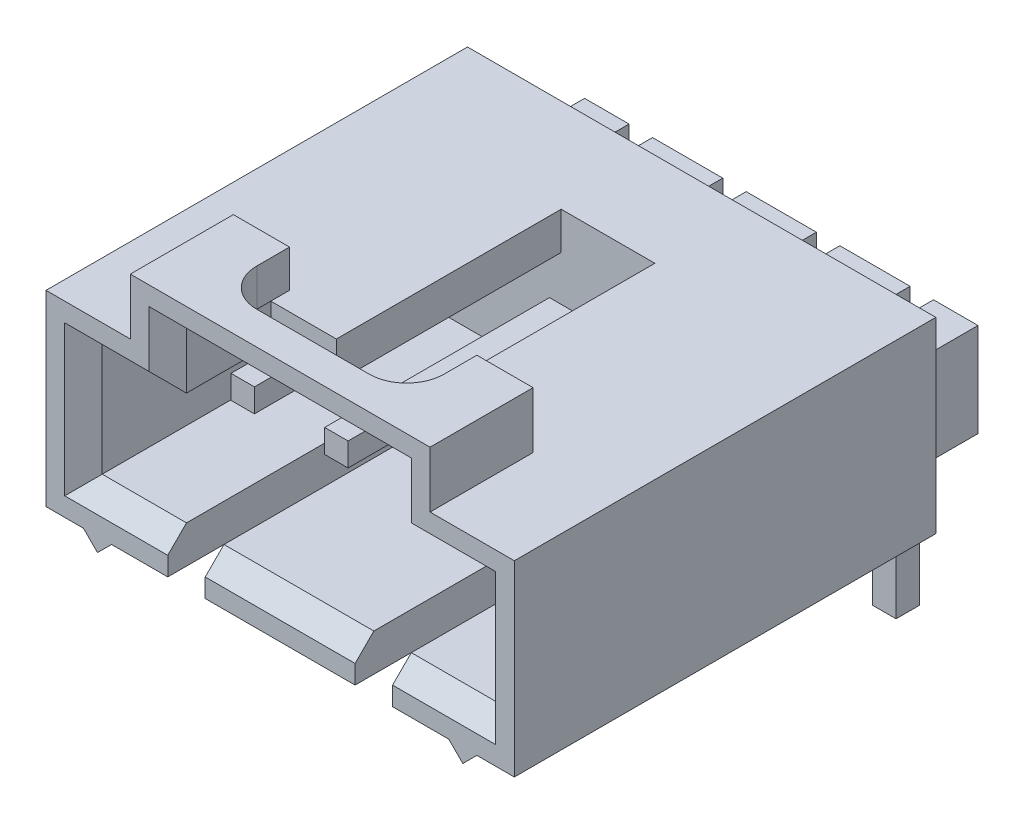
ISO-10303-21;
HEADER;
FILE_DESCRIPTION(('STEP AP214'),'2;1');
FILE_NAME('part.step','',(''),(''),'','','');
FILE_SCHEMA(('AUTOMOTIVE_DESIGN { 1 0 10303 214 1 1 1 1 }'));
ENDSEC;
DATA;
#1=APPLICATION_CONTEXT('core data for automotive mechanical design processes');
#2=APPLICATION_PROTOCOL_DEFINITION('international standard','automotive_design',2000,#1);
#3=PRODUCT_CONTEXT('',#1,'mechanical');
#4=PRODUCT('Part','Part','',(#3));
#5=PRODUCT_RELATED_PRODUCT_CATEGORY('part','',(#4));
#6=PRODUCT_DEFINITION_FORMATION('','',#4);
#7=PRODUCT_DEFINITION_CONTEXT('part definition',#1,'design');
#8=PRODUCT_DEFINITION('design','',#6,#7);
#9=PRODUCT_DEFINITION_SHAPE('','',#8);
#10=(LENGTH_UNIT() NAMED_UNIT(*) SI_UNIT(.MILLI.,.METRE.));
#11=(NAMED_UNIT(*) PLANE_ANGLE_UNIT() SI_UNIT($,.RADIAN.));
#12=(NAMED_UNIT(*) SI_UNIT($,.STERADIAN.) SOLID_ANGLE_UNIT());
#13=UNCERTAINTY_MEASURE_WITH_UNIT(LENGTH_MEASURE(1.E-05),#10,'distance_accuracy_value','');
#14=(GEOMETRIC_REPRESENTATION_CONTEXT(3) GLOBAL_UNCERTAINTY_ASSIGNED_CONTEXT((#13)) GLOBAL_UNIT_ASSIGNED_CONTEXT((#10,
#11,#12)) REPRESENTATION_CONTEXT('',''));
#15=CARTESIAN_POINT('',(0.,0.,0.));
#16=DIRECTION('',(0.,0.,1.));
#17=DIRECTION('',(1.,0.,0.));
#18=AXIS2_PLACEMENT_3D('',#15,#16,#17);
#19=CARTESIAN_POINT('',(-5.54736,-1.84912,-6.477));
#20=DIRECTION('',(0.,0.,-1.));
#21=DIRECTION('',(0.,1.,0.));
#22=AXIS2_PLACEMENT_3D('',#19,#20,#21);
#23=PLANE('',#22);
#24=DIRECTION('',(0.,1.,0.));
#25=VECTOR('',#24,1.);
#26=CARTESIAN_POINT('',(-3.4925,-0.508000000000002,-6.477));
#27=LINE('',#26,#25);
#28=CARTESIAN_POINT('',(-3.4925,-1.778,-6.477));
#29=VERTEX_POINT('',#28);
#30=CARTESIAN_POINT('',(-3.49250000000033,-0.383212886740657,-6.47700000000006));
#31=VERTEX_POINT('',#30);
#32=EDGE_CURVE('E501',#29,#31,#27,.T.);
#33=ORIENTED_EDGE('',*,*,#32,.F.);
#34=DIRECTION('',(-1.,0.,0.));
#35=VECTOR('',#34,1.);
#36=CARTESIAN_POINT('',(0.,-1.778,-6.477));
#37=LINE('',#36,#35);
#38=CARTESIAN_POINT('',(-4.1275,-1.778,-6.477));
#39=VERTEX_POINT('',#38);
#40=EDGE_CURVE('E548',#29,#39,#37,.T.);
#41=ORIENTED_EDGE('',*,*,#40,.T.);
#42=DIRECTION('',(0.,-1.,0.));
#43=VECTOR('',#42,1.);
#44=CARTESIAN_POINT('',(-4.1275,-0.508000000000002,-6.477));
#45=LINE('',#44,#43);
#46=CARTESIAN_POINT('',(-4.12749999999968,-0.383212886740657,-6.47700000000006));
#47=VERTEX_POINT('',#46);
#48=EDGE_CURVE('E504',#47,#39,#45,.T.);
#49=ORIENTED_EDGE('',*,*,#48,.F.);
#50=DIRECTION('',(-1.,0.,0.));
#51=VECTOR('',#50,1.);
#52=CARTESIAN_POINT('',(-3.81,-0.383212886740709,-6.47700000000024));
#53=LINE('',#52,#51);
#54=EDGE_CURVE('E505',#31,#47,#53,.T.);
#55=ORIENTED_EDGE('',*,*,#54,.F.);
#56=EDGE_LOOP('',(#33,#41,#49,#55));
#57=FACE_BOUND('',#56,.T.);
#58=ADVANCED_FACE('F16',(#57),#23,.T.);
#59=CARTESIAN_POINT('',(-5.54736,-1.84912,-6.477));
#60=DIRECTION('',(0.,0.,-1.));
#61=DIRECTION('',(0.,1.,0.));
#62=AXIS2_PLACEMENT_3D('',#59,#60,#61);
#63=PLANE('',#62);
#64=DIRECTION('',(0.,-1.,0.));
#65=VECTOR('',#64,1.);
#66=CARTESIAN_POINT('',(3.4925,-0.508000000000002,-6.477));
#67=LINE('',#66,#65);
#68=CARTESIAN_POINT('',(3.49250000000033,-0.383212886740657,-6.47700000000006));
#69=VERTEX_POINT('',#68);
#70=CARTESIAN_POINT('',(3.4925,-1.778,-6.477));
#71=VERTEX_POINT('',#70);
#72=EDGE_CURVE('E804',#69,#71,#67,.T.);
#73=ORIENTED_EDGE('',*,*,#72,.F.);
#74=DIRECTION('',(-1.,0.,0.));
#75=VECTOR('',#74,1.);
#76=CARTESIAN_POINT('',(3.81000000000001,-0.383212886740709,-6.47700000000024));
#77=LINE('',#76,#75);
#78=CARTESIAN_POINT('',(4.12749999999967,-0.383212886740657,-6.47700000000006));
#79=VERTEX_POINT('',#78);
#80=EDGE_CURVE('E543',#79,#69,#77,.T.);
#81=ORIENTED_EDGE('',*,*,#80,.F.);
#82=DIRECTION('',(0.,1.,0.));
#83=VECTOR('',#82,1.);
#84=CARTESIAN_POINT('',(4.12750000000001,-0.508000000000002,-6.477));
#85=LINE('',#84,#83);
#86=CARTESIAN_POINT('',(4.1275,-1.778,-6.477));
#87=VERTEX_POINT('',#86);
#88=EDGE_CURVE('E805',#87,#79,#85,.T.);
#89=ORIENTED_EDGE('',*,*,#88,.F.);
#90=DIRECTION('',(-1.,0.,0.));
#91=VECTOR('',#90,1.);
#92=CARTESIAN_POINT('',(0.,-1.778,-6.477));
#93=LINE('',#92,#91);
#94=EDGE_CURVE('E540',#87,#71,#93,.T.);
#95=ORIENTED_EDGE('',*,*,#94,.T.);
#96=EDGE_LOOP('',(#73,#81,#89,#95));
#97=FACE_BOUND('',#96,.T.);
#98=ADVANCED_FACE('F2709',(#97),#63,.T.);
#99=CARTESIAN_POINT('',(-5.54736,-1.84912,-6.477));
#100=DIRECTION('',(0.,0.,-1.));
#101=DIRECTION('',(0.,1.,0.));
#102=AXIS2_PLACEMENT_3D('',#99,#100,#101);
#103=PLANE('',#102);
#104=DIRECTION('',(0.,-1.,0.));
#105=VECTOR('',#104,1.);
#106=CARTESIAN_POINT('',(-1.5875,-0.508000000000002,-6.477));
#107=LINE('',#106,#105);
#108=CARTESIAN_POINT('',(-1.58750000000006,-0.383212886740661,-6.47700000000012));
#109=VERTEX_POINT('',#108);
#110=CARTESIAN_POINT('',(-1.5875,-1.778,-6.477));
#111=VERTEX_POINT('',#110);
#112=EDGE_CURVE('E797',#109,#111,#107,.T.);
#113=ORIENTED_EDGE('',*,*,#112,.F.);
#114=DIRECTION('',(-1.,0.,0.));
#115=VECTOR('',#114,1.);
#116=CARTESIAN_POINT('',(-1.27,-0.383212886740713,-6.47700000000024));
#117=LINE('',#116,#115);
#118=CARTESIAN_POINT('',(-0.952499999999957,-0.383212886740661,-6.47700000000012));
#119=VERTEX_POINT('',#118);
#120=EDGE_CURVE('E535',#119,#109,#117,.T.);
#121=ORIENTED_EDGE('',*,*,#120,.F.);
#122=DIRECTION('',(0.,1.,0.));
#123=VECTOR('',#122,1.);
#124=CARTESIAN_POINT('',(-0.952499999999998,-0.508000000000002,-6.477));
#125=LINE('',#124,#123);
#126=CARTESIAN_POINT('',(-0.952499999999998,-1.778,-6.477));
#127=VERTEX_POINT('',#126);
#128=EDGE_CURVE('E801',#127,#119,#125,.T.);
#129=ORIENTED_EDGE('',*,*,#128,.F.);
#130=DIRECTION('',(-1.,0.,0.));
#131=VECTOR('',#130,1.);
#132=CARTESIAN_POINT('',(0.,-1.778,-6.477));
#133=LINE('',#132,#131);
#134=EDGE_CURVE('E532',#127,#111,#133,.T.);
#135=ORIENTED_EDGE('',*,*,#134,.T.);
#136=EDGE_LOOP('',(#113,#121,#129,#135));
#137=FACE_BOUND('',#136,.T.);
#138=ADVANCED_FACE('F1957',(#137),#103,.T.);
#139=CARTESIAN_POINT('',(-5.54736,-1.84912,-6.477));
#140=DIRECTION('',(0.,0.,-1.));
#141=DIRECTION('',(0.,1.,0.));
#142=AXIS2_PLACEMENT_3D('',#139,#140,#141);
#143=PLANE('',#142);
#144=DIRECTION('',(0.,-1.,0.));
#145=VECTOR('',#144,1.);
#146=CARTESIAN_POINT('',(0.952500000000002,-0.508000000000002,-6.477));
#147=LINE('',#146,#145);
#148=CARTESIAN_POINT('',(0.952499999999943,-0.383212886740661,-6.47700000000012));
#149=VERTEX_POINT('',#148);
#150=CARTESIAN_POINT('',(0.952500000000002,-1.778,-6.477));
#151=VERTEX_POINT('',#150);
#152=EDGE_CURVE('E789',#149,#151,#147,.T.);
#153=ORIENTED_EDGE('',*,*,#152,.F.);
#154=DIRECTION('',(-1.,0.,0.));
#155=VECTOR('',#154,1.);
#156=CARTESIAN_POINT('',(1.27,-0.383212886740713,-6.47700000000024));
#157=LINE('',#156,#155);
#158=CARTESIAN_POINT('',(1.58750000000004,-0.383212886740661,-6.47700000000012));
#159=VERTEX_POINT('',#158);
#160=EDGE_CURVE('E526',#159,#149,#157,.T.);
#161=ORIENTED_EDGE('',*,*,#160,.F.);
#162=DIRECTION('',(0.,1.,0.));
#163=VECTOR('',#162,1.);
#164=CARTESIAN_POINT('',(1.5875,-0.508000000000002,-6.477));
#165=LINE('',#164,#163);
#166=CARTESIAN_POINT('',(1.5875,-1.778,-6.477));
#167=VERTEX_POINT('',#166);
#168=EDGE_CURVE('E793',#167,#159,#165,.T.);
#169=ORIENTED_EDGE('',*,*,#168,.F.);
#170=DIRECTION('',(-1.,0.,0.));
#171=VECTOR('',#170,1.);
#172=CARTESIAN_POINT('',(0.,-1.778,-6.477));
#173=LINE('',#172,#171);
#174=EDGE_CURVE('E530',#167,#151,#173,.T.);
#175=ORIENTED_EDGE('',*,*,#174,.T.);
#176=EDGE_LOOP('',(#153,#161,#169,#175));
#177=FACE_BOUND('',#176,.T.);
#178=ADVANCED_FACE('F2716',(#177),#143,.T.);
#179=CARTESIAN_POINT('',(-3.4925,-1.8288,-6.44906));
#180=DIRECTION('',(-1.,0.,0.));
#181=DIRECTION('',(0.,1.,0.));
#182=AXIS2_PLACEMENT_3D('',#179,#180,#181);
#183=PLANE('',#182);
#184=DIRECTION('',(0.,1.,0.));
#185=VECTOR('',#184,1.);
#186=CARTESIAN_POINT('',(-3.49250000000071,-3.5941,-6.858));
#187=LINE('',#186,#185);
#188=CARTESIAN_POINT('',(-3.49250000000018,-1.778,-6.858));
#189=VERTEX_POINT('',#188);
#190=CARTESIAN_POINT('',(-3.49250000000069,-0.965199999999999,-6.858));
#191=VERTEX_POINT('',#190);
#192=EDGE_CURVE('E484',#189,#191,#187,.T.);
#193=ORIENTED_EDGE('',*,*,#192,.F.);
#194=DIRECTION('',(0.,0.,1.));
#195=VECTOR('',#194,1.);
#196=CARTESIAN_POINT('',(-3.4925,-1.778,-7.1755));
#197=LINE('',#196,#195);
#198=EDGE_CURVE('E522',#189,#29,#197,.T.);
#199=ORIENTED_EDGE('',*,*,#198,.T.);
#200=ORIENTED_EDGE('',*,*,#32,.T.);
#201=CARTESIAN_POINT('',(-3.49250000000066,-0.965199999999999,-6.223));
#202=DIRECTION('',(1.,0.,0.));
#203=DIRECTION('',(0.,0.,-1.));
#204=AXIS2_PLACEMENT_3D('',#201,#202,#203);
#205=CIRCLE('',#204,0.635000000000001);
#206=EDGE_CURVE('E20',#191,#31,#205,.T.);
#207=ORIENTED_EDGE('',*,*,#206,.F.);
#208=EDGE_LOOP('',(#193,#199,#200,#207));
#209=FACE_BOUND('',#208,.T.);
#210=ADVANCED_FACE('F499',(#209),#183,.T.);
#211=CARTESIAN_POINT('',(-4.12749999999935,-0.965199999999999,-6.223));
#212=DIRECTION('',(1.,0.,0.));
#213=DIRECTION('',(0.,0.,-1.));
#214=AXIS2_PLACEMENT_3D('',#211,#212,#213);
#215=CYLINDRICAL_SURFACE('',#214,0.635000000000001);
#216=DIRECTION('',(-1.,0.,0.));
#217=VECTOR('',#216,1.);
#218=CARTESIAN_POINT('',(-3.81,-0.965199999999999,-6.858));
#219=LINE('',#218,#217);
#220=CARTESIAN_POINT('',(-4.12749999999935,-0.965199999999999,-6.858));
#221=VERTEX_POINT('',#220);
#222=EDGE_CURVE('E489',#191,#221,#219,.T.);
#223=ORIENTED_EDGE('',*,*,#222,.F.);
#224=ORIENTED_EDGE('',*,*,#206,.T.);
#225=ORIENTED_EDGE('',*,*,#54,.T.);
#226=CARTESIAN_POINT('',(-4.12749999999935,-0.965199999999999,-6.223));
#227=DIRECTION('',(1.,0.,0.));
#228=DIRECTION('',(0.,0.,-1.));
#229=AXIS2_PLACEMENT_3D('',#226,#227,#228);
#230=CIRCLE('',#229,0.635000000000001);
#231=EDGE_CURVE('E508',#221,#47,#230,.T.);
#232=ORIENTED_EDGE('',*,*,#231,.F.);
#233=EDGE_LOOP('',(#223,#224,#225,#232));
#234=FACE_BOUND('',#233,.T.);
#235=ADVANCED_FACE('F506',(#234),#215,.F.);
#236=CARTESIAN_POINT('',(-4.1275,0.812800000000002,-6.44906));
#237=DIRECTION('',(1.,0.,0.));
#238=DIRECTION('',(0.,-1.,0.));
#239=AXIS2_PLACEMENT_3D('',#236,#237,#238);
#240=PLANE('',#239);
#241=DIRECTION('',(0.,-1.,0.));
#242=VECTOR('',#241,1.);
#243=CARTESIAN_POINT('',(-4.12749999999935,-3.5941,-6.858));
#244=LINE('',#243,#242);
#245=CARTESIAN_POINT('',(-4.12749999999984,-1.778,-6.858));
#246=VERTEX_POINT('',#245);
#247=EDGE_CURVE('E510',#221,#246,#244,.T.);
#248=ORIENTED_EDGE('',*,*,#247,.F.);
#249=ORIENTED_EDGE('',*,*,#231,.T.);
#250=ORIENTED_EDGE('',*,*,#48,.T.);
#251=DIRECTION('',(0.,0.,-1.));
#252=VECTOR('',#251,1.);
#253=CARTESIAN_POINT('',(-4.1275,-1.778,-7.1755));
#254=LINE('',#253,#252);
#255=EDGE_CURVE('E518',#39,#246,#254,.T.);
#256=ORIENTED_EDGE('',*,*,#255,.T.);
#257=EDGE_LOOP('',(#248,#249,#250,#256));
#258=FACE_BOUND('',#257,.T.);
#259=ADVANCED_FACE('F2722',(#258),#240,.T.);
#260=CARTESIAN_POINT('',(4.1275,-1.8288,-6.44906));
#261=DIRECTION('',(-1.,0.,0.));
#262=DIRECTION('',(0.,1.,0.));
#263=AXIS2_PLACEMENT_3D('',#260,#261,#262);
#264=PLANE('',#263);
#265=DIRECTION('',(0.,1.,0.));
#266=VECTOR('',#265,1.);
#267=CARTESIAN_POINT('',(4.12749999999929,-3.5941,-6.858));
#268=LINE('',#267,#266);
#269=CARTESIAN_POINT('',(4.12749999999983,-1.778,-6.858));
#270=VERTEX_POINT('',#269);
#271=CARTESIAN_POINT('',(4.12749999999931,-0.965199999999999,-6.858));
#272=VERTEX_POINT('',#271);
#273=EDGE_CURVE('E512',#270,#272,#268,.T.);
#274=ORIENTED_EDGE('',*,*,#273,.F.);
#275=DIRECTION('',(0.,0.,1.));
#276=VECTOR('',#275,1.);
#277=CARTESIAN_POINT('',(4.12750000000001,-1.778,-7.1755));
#278=LINE('',#277,#276);
#279=EDGE_CURVE('E546',#270,#87,#278,.T.);
#280=ORIENTED_EDGE('',*,*,#279,.T.);
#281=ORIENTED_EDGE('',*,*,#88,.T.);
#282=CARTESIAN_POINT('',(4.12749999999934,-0.965199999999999,-6.223));
#283=DIRECTION('',(1.,0.,0.));
#284=DIRECTION('',(0.,1.,0.));
#285=AXIS2_PLACEMENT_3D('',#282,#283,#284);
#286=CIRCLE('',#285,0.635000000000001);
#287=EDGE_CURVE('E545',#272,#79,#286,.T.);
#288=ORIENTED_EDGE('',*,*,#287,.F.);
#289=EDGE_LOOP('',(#274,#280,#281,#288));
#290=FACE_BOUND('',#289,.T.);
#291=ADVANCED_FACE('F2725',(#290),#264,.T.);
#292=CARTESIAN_POINT('',(3.49250000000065,-0.965199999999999,-6.223));
#293=DIRECTION('',(1.,0.,0.));
#294=DIRECTION('',(0.,1.,0.));
#295=AXIS2_PLACEMENT_3D('',#292,#293,#294);
#296=CYLINDRICAL_SURFACE('',#295,0.635000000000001);
#297=DIRECTION('',(-1.,0.,0.));
#298=VECTOR('',#297,1.);
#299=CARTESIAN_POINT('',(3.81,-0.965199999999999,-6.858));
#300=LINE('',#299,#298);
#301=CARTESIAN_POINT('',(3.49250000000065,-0.965199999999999,-6.858));
#302=VERTEX_POINT('',#301);
#303=EDGE_CURVE('E1744',#272,#302,#300,.T.);
#304=ORIENTED_EDGE('',*,*,#303,.F.);
#305=ORIENTED_EDGE('',*,*,#287,.T.);
#306=ORIENTED_EDGE('',*,*,#80,.T.);
#307=CARTESIAN_POINT('',(3.49250000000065,-0.965199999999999,-6.223));
#308=DIRECTION('',(1.,0.,0.));
#309=DIRECTION('',(0.,1.,0.));
#310=AXIS2_PLACEMENT_3D('',#307,#308,#309);
#311=CIRCLE('',#310,0.635000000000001);
#312=EDGE_CURVE('E798',#302,#69,#311,.T.);
#313=ORIENTED_EDGE('',*,*,#312,.F.);
#314=EDGE_LOOP('',(#304,#305,#306,#313));
#315=FACE_BOUND('',#314,.T.);
#316=ADVANCED_FACE('F2728',(#315),#296,.F.);
#317=CARTESIAN_POINT('',(3.4925,0.812800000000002,-6.44906));
#318=DIRECTION('',(1.,0.,0.));
#319=DIRECTION('',(0.,-1.,0.));
#320=AXIS2_PLACEMENT_3D('',#317,#318,#319);
#321=PLANE('',#320);
#322=DIRECTION('',(0.,-1.,0.));
#323=VECTOR('',#322,1.);
#324=CARTESIAN_POINT('',(3.49250000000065,-3.5941,-6.858));
#325=LINE('',#324,#323);
#326=CARTESIAN_POINT('',(3.49250000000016,-1.778,-6.858));
#327=VERTEX_POINT('',#326);
#328=EDGE_CURVE('E1724',#302,#327,#325,.T.);
#329=ORIENTED_EDGE('',*,*,#328,.F.);
#330=ORIENTED_EDGE('',*,*,#312,.T.);
#331=ORIENTED_EDGE('',*,*,#72,.T.);
#332=DIRECTION('',(0.,0.,-1.));
#333=VECTOR('',#332,1.);
#334=CARTESIAN_POINT('',(3.4925,-1.778,-7.1755));
#335=LINE('',#334,#333);
#336=EDGE_CURVE('E802',#71,#327,#335,.T.);
#337=ORIENTED_EDGE('',*,*,#336,.T.);
#338=EDGE_LOOP('',(#329,#330,#331,#337));
#339=FACE_BOUND('',#338,.T.);
#340=ADVANCED_FACE('F1789',(#339),#321,.T.);
#341=CARTESIAN_POINT('',(-0.952499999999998,-1.8288,-6.44906));
#342=DIRECTION('',(-1.,0.,0.));
#343=DIRECTION('',(0.,1.,0.));
#344=AXIS2_PLACEMENT_3D('',#341,#342,#343);
#345=PLANE('',#344);
#346=DIRECTION('',(0.,1.,0.));
#347=VECTOR('',#346,1.);
#348=CARTESIAN_POINT('',(-0.952500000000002,-3.5941,-6.858));
#349=LINE('',#348,#347);
#350=CARTESIAN_POINT('',(-0.952499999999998,-1.778,-6.858));
#351=VERTEX_POINT('',#350);
#352=CARTESIAN_POINT('',(-0.952499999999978,-0.965200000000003,-6.858));
#353=VERTEX_POINT('',#352);
#354=EDGE_CURVE('E1717',#351,#353,#349,.T.);
#355=ORIENTED_EDGE('',*,*,#354,.F.);
#356=DIRECTION('',(0.,0.,1.));
#357=VECTOR('',#356,1.);
#358=CARTESIAN_POINT('',(-0.952499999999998,-1.778,-7.1755));
#359=LINE('',#358,#357);
#360=EDGE_CURVE('E538',#351,#127,#359,.T.);
#361=ORIENTED_EDGE('',*,*,#360,.T.);
#362=ORIENTED_EDGE('',*,*,#128,.T.);
#363=CARTESIAN_POINT('',(-0.952499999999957,-0.965200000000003,-6.223));
#364=DIRECTION('',(1.,0.,0.));
#365=DIRECTION('',(0.,1.,0.));
#366=AXIS2_PLACEMENT_3D('',#363,#364,#365);
#367=CIRCLE('',#366,0.635000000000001);
#368=EDGE_CURVE('E537',#353,#119,#367,.T.);
#369=ORIENTED_EDGE('',*,*,#368,.F.);
#370=EDGE_LOOP('',(#355,#361,#362,#369));
#371=FACE_BOUND('',#370,.T.);
#372=ADVANCED_FACE('F1960',(#371),#345,.T.);
#373=CARTESIAN_POINT('',(-1.58750000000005,-0.965200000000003,-6.223));
#374=DIRECTION('',(1.,0.,0.));
#375=DIRECTION('',(0.,1.,0.));
#376=AXIS2_PLACEMENT_3D('',#373,#374,#375);
#377=CYLINDRICAL_SURFACE('',#376,0.635000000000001);
#378=DIRECTION('',(-1.,0.,0.));
#379=VECTOR('',#378,1.);
#380=CARTESIAN_POINT('',(-1.27,-0.965200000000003,-6.858));
#381=LINE('',#380,#379);
#382=CARTESIAN_POINT('',(-1.58750000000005,-0.965200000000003,-6.858));
#383=VERTEX_POINT('',#382);
#384=EDGE_CURVE('E1719',#353,#383,#381,.T.);
#385=ORIENTED_EDGE('',*,*,#384,.F.);
#386=ORIENTED_EDGE('',*,*,#368,.T.);
#387=ORIENTED_EDGE('',*,*,#120,.T.);
#388=CARTESIAN_POINT('',(-1.58750000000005,-0.965200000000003,-6.223));
#389=DIRECTION('',(1.,0.,0.));
#390=DIRECTION('',(0.,1.,0.));
#391=AXIS2_PLACEMENT_3D('',#388,#389,#390);
#392=CIRCLE('',#391,0.635000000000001);
#393=EDGE_CURVE('E790',#383,#109,#392,.T.);
#394=ORIENTED_EDGE('',*,*,#393,.F.);
#395=EDGE_LOOP('',(#385,#386,#387,#394));
#396=FACE_BOUND('',#395,.T.);
#397=ADVANCED_FACE('F1954',(#396),#377,.F.);
#398=CARTESIAN_POINT('',(-1.5875,0.812799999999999,-6.44906));
#399=DIRECTION('',(1.,0.,0.));
#400=DIRECTION('',(0.,-1.,0.));
#401=AXIS2_PLACEMENT_3D('',#398,#399,#400);
#402=PLANE('',#401);
#403=DIRECTION('',(0.,-1.,0.));
#404=VECTOR('',#403,1.);
#405=CARTESIAN_POINT('',(-1.58750000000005,-3.5941,-6.858));
#406=LINE('',#405,#404);
#407=CARTESIAN_POINT('',(-1.58750000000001,-1.778,-6.858));
#408=VERTEX_POINT('',#407);
#409=EDGE_CURVE('E1698',#383,#408,#406,.T.);
#410=ORIENTED_EDGE('',*,*,#409,.F.);
#411=ORIENTED_EDGE('',*,*,#393,.T.);
#412=ORIENTED_EDGE('',*,*,#112,.T.);
#413=DIRECTION('',(0.,0.,-1.));
#414=VECTOR('',#413,1.);
#415=CARTESIAN_POINT('',(-1.5875,-1.778,-7.1755));
#416=LINE('',#415,#414);
#417=EDGE_CURVE('E794',#111,#408,#416,.T.);
#418=ORIENTED_EDGE('',*,*,#417,.T.);
#419=EDGE_LOOP('',(#410,#411,#412,#418));
#420=FACE_BOUND('',#419,.T.);
#421=ADVANCED_FACE('F1944',(#420),#402,.T.);
#422=CARTESIAN_POINT('',(1.5875,-1.8288,-6.44906));
#423=DIRECTION('',(-1.,0.,0.));
#424=DIRECTION('',(0.,1.,0.));
#425=AXIS2_PLACEMENT_3D('',#422,#423,#424);
#426=PLANE('',#425);
#427=DIRECTION('',(0.,1.,0.));
#428=VECTOR('',#427,1.);
#429=CARTESIAN_POINT('',(1.5875,-3.5941,-6.858));
#430=LINE('',#429,#428);
#431=CARTESIAN_POINT('',(1.5875,-1.778,-6.858));
#432=VERTEX_POINT('',#431);
#433=CARTESIAN_POINT('',(1.58750000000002,-0.965199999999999,-6.858));
#434=VERTEX_POINT('',#433);
#435=EDGE_CURVE('E1691',#432,#434,#430,.T.);
#436=ORIENTED_EDGE('',*,*,#435,.F.);
#437=DIRECTION('',(0.,0.,1.));
#438=VECTOR('',#437,1.);
#439=CARTESIAN_POINT('',(1.5875,-1.778,-7.1755));
#440=LINE('',#439,#438);
#441=EDGE_CURVE('E529',#432,#167,#440,.T.);
#442=ORIENTED_EDGE('',*,*,#441,.T.);
#443=ORIENTED_EDGE('',*,*,#168,.T.);
#444=CARTESIAN_POINT('',(1.58750000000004,-0.965199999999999,-6.223));
#445=DIRECTION('',(1.,0.,0.));
#446=DIRECTION('',(0.,0.,-1.));
#447=AXIS2_PLACEMENT_3D('',#444,#445,#446);
#448=CIRCLE('',#447,0.635000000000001);
#449=EDGE_CURVE('E528',#434,#159,#448,.T.);
#450=ORIENTED_EDGE('',*,*,#449,.F.);
#451=EDGE_LOOP('',(#436,#442,#443,#450));
#452=FACE_BOUND('',#451,.T.);
#453=ADVANCED_FACE('F2735',(#452),#426,.T.);
#454=CARTESIAN_POINT('',(0.952499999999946,-0.965199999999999,-6.223));
#455=DIRECTION('',(1.,0.,0.));
#456=DIRECTION('',(0.,0.,-1.));
#457=AXIS2_PLACEMENT_3D('',#454,#455,#456);
#458=CYLINDRICAL_SURFACE('',#457,0.635000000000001);
#459=DIRECTION('',(-1.,0.,0.));
#460=VECTOR('',#459,1.);
#461=CARTESIAN_POINT('',(1.27,-0.965199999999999,-6.858));
#462=LINE('',#461,#460);
#463=CARTESIAN_POINT('',(0.95249999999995,-0.965199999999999,-6.858));
#464=VERTEX_POINT('',#463);
#465=EDGE_CURVE('E1693',#434,#464,#462,.T.);
#466=ORIENTED_EDGE('',*,*,#465,.F.);
#467=ORIENTED_EDGE('',*,*,#449,.T.);
#468=ORIENTED_EDGE('',*,*,#160,.T.);
#469=CARTESIAN_POINT('',(0.952499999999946,-0.965199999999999,-6.223));
#470=DIRECTION('',(1.,0.,0.));
#471=DIRECTION('',(0.,0.,-1.));
#472=AXIS2_PLACEMENT_3D('',#469,#470,#471);
#473=CIRCLE('',#472,0.635000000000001);
#474=EDGE_CURVE('E495',#464,#149,#473,.T.);
#475=ORIENTED_EDGE('',*,*,#474,.F.);
#476=EDGE_LOOP('',(#466,#467,#468,#475));
#477=FACE_BOUND('',#476,.T.);
#478=ADVANCED_FACE('F2704',(#477),#458,.F.);
#479=CARTESIAN_POINT('',(0.952500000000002,0.812800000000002,-6.44906));
#480=DIRECTION('',(1.,0.,0.));
#481=DIRECTION('',(0.,-1.,0.));
#482=AXIS2_PLACEMENT_3D('',#479,#480,#481);
#483=PLANE('',#482);
#484=DIRECTION('',(0.,-1.,0.));
#485=VECTOR('',#484,1.);
#486=CARTESIAN_POINT('',(0.95249999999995,-3.5941,-6.858));
#487=LINE('',#486,#485);
#488=CARTESIAN_POINT('',(0.952499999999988,-1.778,-6.858));
#489=VERTEX_POINT('',#488);
#490=EDGE_CURVE('E842',#464,#489,#487,.T.);
#491=ORIENTED_EDGE('',*,*,#490,.F.);
#492=ORIENTED_EDGE('',*,*,#474,.T.);
#493=ORIENTED_EDGE('',*,*,#152,.T.);
#494=DIRECTION('',(0.,0.,-1.));
#495=VECTOR('',#494,1.);
#496=CARTESIAN_POINT('',(0.952499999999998,-1.778,-7.1755));
#497=LINE('',#496,#495);
#498=EDGE_CURVE('E786',#151,#489,#497,.T.);
#499=ORIENTED_EDGE('',*,*,#498,.T.);
#500=EDGE_LOOP('',(#491,#492,#493,#499));
#501=FACE_BOUND('',#500,.T.);
#502=ADVANCED_FACE('F2739',(#501),#483,.T.);
#503=CARTESIAN_POINT('',(-4.15300595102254,-0.860044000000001,-6.858));
#504=DIRECTION('',(0.,0.,1.));
#505=DIRECTION('',(0.,-1.,0.));
#506=AXIS2_PLACEMENT_3D('',#503,#504,#505);
#507=PLANE('',#506);
#508=ORIENTED_EDGE('',*,*,#222,.T.);
#509=ORIENTED_EDGE('',*,*,#247,.T.);
#510=DIRECTION('',(0.,-1.,0.));
#511=VECTOR('',#510,1.);
#512=CARTESIAN_POINT('',(-4.1275,-2.9591,-6.858));
#513=LINE('',#512,#511);
#514=CARTESIAN_POINT('',(-4.1275,-6.223,-6.85800000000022));
#515=VERTEX_POINT('',#514);
#516=EDGE_CURVE('E1599',#246,#515,#513,.T.);
#517=ORIENTED_EDGE('',*,*,#516,.T.);
#518=DIRECTION('',(-1.,0.,0.));
#519=VECTOR('',#518,1.);
#520=CARTESIAN_POINT('',(-3.81,-6.223,-6.85800000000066));
#521=LINE('',#520,#519);
#522=CARTESIAN_POINT('',(-3.49250000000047,-6.223,-6.85800000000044));
#523=VERTEX_POINT('',#522);
#524=EDGE_CURVE('E1600',#523,#515,#521,.T.);
#525=ORIENTED_EDGE('',*,*,#524,.F.);
#526=DIRECTION('',(0.,-1.,0.));
#527=VECTOR('',#526,1.);
#528=CARTESIAN_POINT('',(-3.4925,-2.9591,-6.858));
#529=LINE('',#528,#527);
#530=EDGE_CURVE('E492',#189,#523,#529,.T.);
#531=ORIENTED_EDGE('',*,*,#530,.F.);
#532=ORIENTED_EDGE('',*,*,#192,.T.);
#533=EDGE_LOOP('',(#508,#509,#517,#525,#531,#532));
#534=FACE_BOUND('',#533,.T.);
#535=ADVANCED_FACE('F486',(#534),#507,.T.);
#536=CARTESIAN_POINT('',(3.46699404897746,-0.860044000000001,-6.858));
#537=DIRECTION('',(0.,0.,1.));
#538=DIRECTION('',(0.,-1.,0.));
#539=AXIS2_PLACEMENT_3D('',#536,#537,#538);
#540=PLANE('',#539);
#541=ORIENTED_EDGE('',*,*,#303,.T.);
#542=ORIENTED_EDGE('',*,*,#328,.T.);
#543=DIRECTION('',(0.,-1.,0.));
#544=VECTOR('',#543,1.);
#545=CARTESIAN_POINT('',(3.4925,-2.9591,-6.858));
#546=LINE('',#545,#544);
#547=CARTESIAN_POINT('',(3.4925,-6.223,-6.85800000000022));
#548=VERTEX_POINT('',#547);
#549=EDGE_CURVE('E1578',#327,#548,#546,.T.);
#550=ORIENTED_EDGE('',*,*,#549,.T.);
#551=DIRECTION('',(-1.,0.,0.));
#552=VECTOR('',#551,1.);
#553=CARTESIAN_POINT('',(3.81,-6.223,-6.85800000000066));
#554=LINE('',#553,#552);
#555=CARTESIAN_POINT('',(4.12749999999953,-6.223,-6.85800000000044));
#556=VERTEX_POINT('',#555);
#557=EDGE_CURVE('E1587',#556,#548,#554,.T.);
#558=ORIENTED_EDGE('',*,*,#557,.F.);
#559=DIRECTION('',(0.,-1.,0.));
#560=VECTOR('',#559,1.);
#561=CARTESIAN_POINT('',(4.1275,-2.9591,-6.858));
#562=LINE('',#561,#560);
#563=EDGE_CURVE('E1593',#270,#556,#562,.T.);
#564=ORIENTED_EDGE('',*,*,#563,.F.);
#565=ORIENTED_EDGE('',*,*,#273,.T.);
#566=EDGE_LOOP('',(#541,#542,#550,#558,#564,#565));
#567=FACE_BOUND('',#566,.T.);
#568=ADVANCED_FACE('F1793',(#567),#540,.T.);
#569=CARTESIAN_POINT('',(-1.6130059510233,-0.860044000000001,-6.858));
#570=DIRECTION('',(0.,0.,1.));
#571=DIRECTION('',(0.,-1.,0.));
#572=AXIS2_PLACEMENT_3D('',#569,#570,#571);
#573=PLANE('',#572);
#574=ORIENTED_EDGE('',*,*,#384,.T.);
#575=ORIENTED_EDGE('',*,*,#409,.T.);
#576=DIRECTION('',(0.,-1.,0.));
#577=VECTOR('',#576,1.);
#578=CARTESIAN_POINT('',(-1.5875,-2.9591,-6.858));
#579=LINE('',#578,#577);
#580=CARTESIAN_POINT('',(-1.58750000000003,-6.223,-6.85800000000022));
#581=VERTEX_POINT('',#580);
#582=EDGE_CURVE('E1551',#408,#581,#579,.T.);
#583=ORIENTED_EDGE('',*,*,#582,.T.);
#584=DIRECTION('',(1.,0.,0.));
#585=VECTOR('',#584,1.);
#586=CARTESIAN_POINT('',(-1.27,-6.223,-6.858));
#587=LINE('',#586,#585);
#588=CARTESIAN_POINT('',(-0.952500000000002,-6.223,-6.85800000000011));
#589=VERTEX_POINT('',#588);
#590=EDGE_CURVE('E1720',#581,#589,#587,.T.);
#591=ORIENTED_EDGE('',*,*,#590,.T.);
#592=DIRECTION('',(0.,-1.,0.));
#593=VECTOR('',#592,1.);
#594=CARTESIAN_POINT('',(-0.952499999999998,-2.9591,-6.858));
#595=LINE('',#594,#593);
#596=EDGE_CURVE('E1541',#351,#589,#595,.T.);
#597=ORIENTED_EDGE('',*,*,#596,.F.);
#598=ORIENTED_EDGE('',*,*,#354,.T.);
#599=EDGE_LOOP('',(#574,#575,#583,#591,#597,#598));
#600=FACE_BOUND('',#599,.T.);
#601=ADVANCED_FACE('F1947',(#600),#573,.T.);
#602=CARTESIAN_POINT('',(0.926994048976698,-0.860044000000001,-6.858));
#603=DIRECTION('',(0.,0.,1.));
#604=DIRECTION('',(0.,-1.,0.));
#605=AXIS2_PLACEMENT_3D('',#602,#603,#604);
#606=PLANE('',#605);
#607=ORIENTED_EDGE('',*,*,#465,.T.);
#608=ORIENTED_EDGE('',*,*,#490,.T.);
#609=DIRECTION('',(0.,-1.,0.));
#610=VECTOR('',#609,1.);
#611=CARTESIAN_POINT('',(0.952500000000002,-2.9591,-6.858));
#612=LINE('',#611,#610);
#613=CARTESIAN_POINT('',(0.952499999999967,-6.223,-6.85800000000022));
#614=VERTEX_POINT('',#613);
#615=EDGE_CURVE('E1519',#489,#614,#612,.T.);
#616=ORIENTED_EDGE('',*,*,#615,.T.);
#617=DIRECTION('',(1.,0.,0.));
#618=VECTOR('',#617,1.);
#619=CARTESIAN_POINT('',(1.27,-6.223,-6.858));
#620=LINE('',#619,#618);
#621=CARTESIAN_POINT('',(1.5875,-6.223,-6.85800000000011));
#622=VERTEX_POINT('',#621);
#623=EDGE_CURVE('E1694',#614,#622,#620,.T.);
#624=ORIENTED_EDGE('',*,*,#623,.T.);
#625=DIRECTION('',(0.,-1.,0.));
#626=VECTOR('',#625,1.);
#627=CARTESIAN_POINT('',(1.5875,-2.9591,-6.858));
#628=LINE('',#627,#626);
#629=EDGE_CURVE('E1509',#432,#622,#628,.T.);
#630=ORIENTED_EDGE('',*,*,#629,.F.);
#631=ORIENTED_EDGE('',*,*,#435,.T.);
#632=EDGE_LOOP('',(#607,#608,#616,#624,#630,#631));
#633=FACE_BOUND('',#632,.T.);
#634=ADVANCED_FACE('F2749',(#633),#606,.T.);
#635=CARTESIAN_POINT('',(3.46699404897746,0.304800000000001,-3.29692));
#636=DIRECTION('',(0.,1.,0.));
#637=DIRECTION('',(0.,0.,1.));
#638=AXIS2_PLACEMENT_3D('',#635,#636,#637);
#639=PLANE('',#638);
#640=DIRECTION('',(-1.,0.,0.));
#641=VECTOR('',#640,1.);
#642=CARTESIAN_POINT('',(3.81,0.304800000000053,2.921));
#643=LINE('',#642,#641);
#644=CARTESIAN_POINT('',(4.12749999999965,0.304800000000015,2.921));
#645=VERTEX_POINT('',#644);
#646=CARTESIAN_POINT('',(3.4925000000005,0.304800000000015,2.921));
#647=VERTEX_POINT('',#646);
#648=EDGE_CURVE('E863',#645,#647,#643,.T.);
#649=ORIENTED_EDGE('',*,*,#648,.F.);
#650=DIRECTION('',(0.,0.,1.));
#651=VECTOR('',#650,1.);
#652=CARTESIAN_POINT('',(4.12750000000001,0.304800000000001,-2.286));
#653=LINE('',#652,#651);
#654=CARTESIAN_POINT('',(4.12749999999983,0.304800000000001,-3.175));
#655=VERTEX_POINT('',#654);
#656=EDGE_CURVE('E855',#655,#645,#653,.T.);
#657=ORIENTED_EDGE('',*,*,#656,.F.);
#658=DIRECTION('',(-1.,0.,0.));
#659=VECTOR('',#658,1.);
#660=CARTESIAN_POINT('',(3.81,0.304800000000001,-3.175));
#661=LINE('',#660,#659);
#662=CARTESIAN_POINT('',(3.49250000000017,0.304800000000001,-3.175));
#663=VERTEX_POINT('',#662);
#664=EDGE_CURVE('E838',#655,#663,#661,.T.);
#665=ORIENTED_EDGE('',*,*,#664,.T.);
#666=DIRECTION('',(0.,0.,1.));
#667=VECTOR('',#666,1.);
#668=CARTESIAN_POINT('',(3.4925,0.304800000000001,-2.286));
#669=LINE('',#668,#667);
#670=EDGE_CURVE('E873',#663,#647,#669,.T.);
#671=ORIENTED_EDGE('',*,*,#670,.T.);
#672=EDGE_LOOP('',(#649,#657,#665,#671));
#673=FACE_BOUND('',#672,.T.);
#674=ADVANCED_FACE('F2752',(#673),#639,.T.);
#675=CARTESIAN_POINT('',(0.926994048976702,0.304799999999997,-3.29692));
#676=DIRECTION('',(0.,1.,0.));
#677=DIRECTION('',(0.,0.,1.));
#678=AXIS2_PLACEMENT_3D('',#675,#676,#677);
#679=PLANE('',#678);
#680=DIRECTION('',(0.,0.,1.));
#681=VECTOR('',#680,1.);
#682=CARTESIAN_POINT('',(1.5875,0.304800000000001,-2.286));
#683=LINE('',#682,#681);
#684=CARTESIAN_POINT('',(1.5875,0.304800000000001,-3.175));
#685=VERTEX_POINT('',#684);
#686=CARTESIAN_POINT('',(1.5875,0.304800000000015,2.921));
#687=VERTEX_POINT('',#686);
#688=EDGE_CURVE('E884',#685,#687,#683,.T.);
#689=ORIENTED_EDGE('',*,*,#688,.F.);
#690=DIRECTION('',(-1.,0.,0.));
#691=VECTOR('',#690,1.);
#692=CARTESIAN_POINT('',(1.27,0.304799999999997,-3.175));
#693=LINE('',#692,#691);
#694=CARTESIAN_POINT('',(0.952499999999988,0.304799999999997,-3.175));
#695=VERTEX_POINT('',#694);
#696=EDGE_CURVE('E843',#685,#695,#693,.T.);
#697=ORIENTED_EDGE('',*,*,#696,.T.);
#698=DIRECTION('',(0.,0.,1.));
#699=VECTOR('',#698,1.);
#700=CARTESIAN_POINT('',(0.952499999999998,0.304800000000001,-2.286));
#701=LINE('',#700,#699);
#702=CARTESIAN_POINT('',(0.952499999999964,0.304800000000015,2.921));
#703=VERTEX_POINT('',#702);
#704=EDGE_CURVE('E878',#695,#703,#701,.T.);
#705=ORIENTED_EDGE('',*,*,#704,.T.);
#706=DIRECTION('',(1.,0.,0.));
#707=VECTOR('',#706,1.);
#708=CARTESIAN_POINT('',(1.27,0.304800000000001,2.921));
#709=LINE('',#708,#707);
#710=EDGE_CURVE('E841',#703,#687,#709,.T.);
#711=ORIENTED_EDGE('',*,*,#710,.T.);
#712=EDGE_LOOP('',(#689,#697,#705,#711));
#713=FACE_BOUND('',#712,.T.);
#714=ADVANCED_FACE('F2756',(#713),#679,.T.);
#715=CARTESIAN_POINT('',(-1.6130059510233,0.304799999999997,-3.29692));
#716=DIRECTION('',(0.,1.,0.));
#717=DIRECTION('',(0.,0.,1.));
#718=AXIS2_PLACEMENT_3D('',#715,#716,#717);
#719=PLANE('',#718);
#720=DIRECTION('',(-1.,0.,0.));
#721=VECTOR('',#720,1.);
#722=CARTESIAN_POINT('',(-1.27,0.304800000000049,2.921));
#723=LINE('',#722,#721);
#724=CARTESIAN_POINT('',(-0.952500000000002,0.304800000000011,2.921));
#725=VERTEX_POINT('',#724);
#726=CARTESIAN_POINT('',(-1.58750000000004,0.304800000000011,2.921));
#727=VERTEX_POINT('',#726);
#728=EDGE_CURVE('E902',#725,#727,#723,.T.);
#729=ORIENTED_EDGE('',*,*,#728,.F.);
#730=DIRECTION('',(0.,0.,1.));
#731=VECTOR('',#730,1.);
#732=CARTESIAN_POINT('',(-0.952499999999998,0.304800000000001,-2.286));
#733=LINE('',#732,#731);
#734=CARTESIAN_POINT('',(-0.952500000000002,0.304799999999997,-3.175));
#735=VERTEX_POINT('',#734);
#736=EDGE_CURVE('E896',#735,#725,#733,.T.);
#737=ORIENTED_EDGE('',*,*,#736,.F.);
#738=DIRECTION('',(-1.,0.,0.));
#739=VECTOR('',#738,1.);
#740=CARTESIAN_POINT('',(-1.27,0.304799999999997,-3.175));
#741=LINE('',#740,#739);
#742=CARTESIAN_POINT('',(-1.58750000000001,0.304799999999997,-3.175));
#743=VERTEX_POINT('',#742);
#744=EDGE_CURVE('E846',#735,#743,#741,.T.);
#745=ORIENTED_EDGE('',*,*,#744,.T.);
#746=DIRECTION('',(0.,0.,1.));
#747=VECTOR('',#746,1.);
#748=CARTESIAN_POINT('',(-1.5875,0.304800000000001,-2.286));
#749=LINE('',#748,#747);
#750=EDGE_CURVE('E912',#743,#727,#749,.T.);
#751=ORIENTED_EDGE('',*,*,#750,.T.);
#752=EDGE_LOOP('',(#729,#737,#745,#751));
#753=FACE_BOUND('',#752,.T.);
#754=ADVANCED_FACE('F2759',(#753),#719,.T.);
#755=CARTESIAN_POINT('',(-4.15300595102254,0.304800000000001,-3.29692));
#756=DIRECTION('',(0.,1.,0.));
#757=DIRECTION('',(0.,0.,1.));
#758=AXIS2_PLACEMENT_3D('',#755,#756,#757);
#759=PLANE('',#758);
#760=DIRECTION('',(-1.,0.,0.));
#761=VECTOR('',#760,1.);
#762=CARTESIAN_POINT('',(-3.81,0.304800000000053,2.921));
#763=LINE('',#762,#761);
#764=CARTESIAN_POINT('',(-3.49250000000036,0.304800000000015,2.921));
#765=VERTEX_POINT('',#764);
#766=CARTESIAN_POINT('',(-4.12749999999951,0.304800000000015,2.921));
#767=VERTEX_POINT('',#766);
#768=EDGE_CURVE('E923',#765,#767,#763,.T.);
#769=ORIENTED_EDGE('',*,*,#768,.F.);
#770=DIRECTION('',(0.,0.,1.));
#771=VECTOR('',#770,1.);
#772=CARTESIAN_POINT('',(-3.4925,0.304800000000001,-2.286));
#773=LINE('',#772,#771);
#774=CARTESIAN_POINT('',(-3.49250000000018,0.304800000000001,-3.175));
#775=VERTEX_POINT('',#774);
#776=EDGE_CURVE('E917',#775,#765,#773,.T.);
#777=ORIENTED_EDGE('',*,*,#776,.F.);
#778=DIRECTION('',(-1.,0.,0.));
#779=VECTOR('',#778,1.);
#780=CARTESIAN_POINT('',(-3.81,0.304800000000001,-3.175));
#781=LINE('',#780,#779);
#782=CARTESIAN_POINT('',(-4.12749999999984,0.304800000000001,-3.175));
#783=VERTEX_POINT('',#782);
#784=EDGE_CURVE('E851',#775,#783,#781,.T.);
#785=ORIENTED_EDGE('',*,*,#784,.T.);
#786=DIRECTION('',(0.,0.,1.));
#787=VECTOR('',#786,1.);
#788=CARTESIAN_POINT('',(-4.1275,0.304800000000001,-2.286));
#789=LINE('',#788,#787);
#790=EDGE_CURVE('E933',#783,#767,#789,.T.);
#791=ORIENTED_EDGE('',*,*,#790,.T.);
#792=EDGE_LOOP('',(#769,#777,#785,#791));
#793=FACE_BOUND('',#792,.T.);
#794=ADVANCED_FACE('F2557',(#793),#759,.T.);
#795=CARTESIAN_POINT('',(-3.4925,-6.353556,3.12928));
#796=DIRECTION('',(1.,0.,0.));
#797=DIRECTION('',(0.,0.,-1.));
#798=AXIS2_PLACEMENT_3D('',#795,#796,#797);
#799=PLANE('',#798);
#800=DIRECTION('',(0.,0.,1.));
#801=VECTOR('',#800,1.);
#802=CARTESIAN_POINT('',(-3.49250000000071,-6.223,-7.1755));
#803=LINE('',#802,#801);
#804=CARTESIAN_POINT('',(-3.49250000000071,-6.223,-7.493));
#805=VERTEX_POINT('',#804);
#806=EDGE_CURVE('E1611',#805,#523,#803,.T.);
#807=ORIENTED_EDGE('',*,*,#806,.F.);
#808=DIRECTION('',(0.,-1.,0.));
#809=VECTOR('',#808,1.);
#810=CARTESIAN_POINT('',(-3.4925000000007,-3.5941,-7.493));
#811=LINE('',#810,#809);
#812=CARTESIAN_POINT('',(-3.49250000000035,-1.778,-7.493));
#813=VERTEX_POINT('',#812);
#814=EDGE_CURVE('E1530',#813,#805,#811,.T.);
#815=ORIENTED_EDGE('',*,*,#814,.F.);
#816=DIRECTION('',(0.,0.,1.));
#817=VECTOR('',#816,1.);
#818=CARTESIAN_POINT('',(-3.4925,-1.778,-2.286));
#819=LINE('',#818,#817);
#820=EDGE_CURVE('E854',#813,#189,#819,.T.);
#821=ORIENTED_EDGE('',*,*,#820,.T.);
#822=ORIENTED_EDGE('',*,*,#530,.T.);
#823=EDGE_LOOP('',(#807,#815,#821,#822));
#824=FACE_BOUND('',#823,.T.);
#825=ADVANCED_FACE('F2766',(#824),#799,.T.);
#826=CARTESIAN_POINT('',(-4.15300595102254,-6.223,-6.83249404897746));
#827=DIRECTION('',(0.,-1.,0.));
#828=DIRECTION('',(0.,0.,-1.));
#829=AXIS2_PLACEMENT_3D('',#826,#827,#828);
#830=PLANE('',#829);
#831=ORIENTED_EDGE('',*,*,#806,.T.);
#832=ORIENTED_EDGE('',*,*,#524,.T.);
#833=DIRECTION('',(0.,0.,-1.));
#834=VECTOR('',#833,1.);
#835=CARTESIAN_POINT('',(-4.1275,-6.223,-2.286));
#836=LINE('',#835,#834);
#837=CARTESIAN_POINT('',(-4.12749999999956,-6.223,-7.493));
#838=VERTEX_POINT('',#837);
#839=EDGE_CURVE('E1603',#515,#838,#836,.T.);
#840=ORIENTED_EDGE('',*,*,#839,.T.);
#841=DIRECTION('',(-1.,0.,0.));
#842=VECTOR('',#841,1.);
#843=CARTESIAN_POINT('',(-3.81,-6.223,-7.493));
#844=LINE('',#843,#842);
#845=EDGE_CURVE('E1440',#805,#838,#844,.T.);
#846=ORIENTED_EDGE('',*,*,#845,.F.);
#847=EDGE_LOOP('',(#831,#832,#840,#846));
#848=FACE_BOUND('',#847,.T.);
#849=ADVANCED_FACE('F2769',(#848),#830,.T.);
#850=CARTESIAN_POINT('',(-4.1275,-6.353556,3.12928));
#851=DIRECTION('',(1.,0.,0.));
#852=DIRECTION('',(0.,0.,-1.));
#853=AXIS2_PLACEMENT_3D('',#850,#851,#852);
#854=PLANE('',#853);
#855=ORIENTED_EDGE('',*,*,#839,.F.);
#856=ORIENTED_EDGE('',*,*,#516,.F.);
#857=DIRECTION('',(0.,0.,1.));
#858=VECTOR('',#857,1.);
#859=CARTESIAN_POINT('',(-4.1275,-1.778,-2.286));
#860=LINE('',#859,#858);
#861=CARTESIAN_POINT('',(-4.12749999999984,-1.778,-7.493));
#862=VERTEX_POINT('',#861);
#863=EDGE_CURVE('E1596',#862,#246,#860,.T.);
#864=ORIENTED_EDGE('',*,*,#863,.F.);
#865=DIRECTION('',(0.,1.,0.));
#866=VECTOR('',#865,1.);
#867=CARTESIAN_POINT('',(-4.12749999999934,-3.5941,-7.493));
#868=LINE('',#867,#866);
#869=EDGE_CURVE('E1423',#838,#862,#868,.T.);
#870=ORIENTED_EDGE('',*,*,#869,.F.);
#871=EDGE_LOOP('',(#855,#856,#864,#870));
#872=FACE_BOUND('',#871,.T.);
#873=ADVANCED_FACE('F2773',(#872),#854,.F.);
#874=CARTESIAN_POINT('',(4.1275,-6.353556,3.12928));
#875=DIRECTION('',(1.,0.,0.));
#876=DIRECTION('',(0.,0.,-1.));
#877=AXIS2_PLACEMENT_3D('',#874,#875,#876);
#878=PLANE('',#877);
#879=DIRECTION('',(0.,-1.,0.));
#880=VECTOR('',#879,1.);
#881=CARTESIAN_POINT('',(4.1274999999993,-3.5941,-7.493));
#882=LINE('',#881,#880);
#883=CARTESIAN_POINT('',(4.12749999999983,-1.778,-7.493));
#884=VERTEX_POINT('',#883);
#885=CARTESIAN_POINT('',(4.1274999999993,-6.223,-7.493));
#886=VERTEX_POINT('',#885);
#887=EDGE_CURVE('E1420',#884,#886,#882,.T.);
#888=ORIENTED_EDGE('',*,*,#887,.F.);
#889=DIRECTION('',(0.,0.,1.));
#890=VECTOR('',#889,1.);
#891=CARTESIAN_POINT('',(4.1275,-1.778,-2.286));
#892=LINE('',#891,#890);
#893=EDGE_CURVE('E1588',#884,#270,#892,.T.);
#894=ORIENTED_EDGE('',*,*,#893,.T.);
#895=ORIENTED_EDGE('',*,*,#563,.T.);
#896=DIRECTION('',(0.,0.,1.));
#897=VECTOR('',#896,1.);
#898=CARTESIAN_POINT('',(4.12749999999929,-6.223,-7.1755));
#899=LINE('',#898,#897);
#900=EDGE_CURVE('E1584',#886,#556,#899,.T.);
#901=ORIENTED_EDGE('',*,*,#900,.F.);
#902=EDGE_LOOP('',(#888,#894,#895,#901));
#903=FACE_BOUND('',#902,.T.);
#904=ADVANCED_FACE('F2777',(#903),#878,.T.);
#905=CARTESIAN_POINT('',(3.46699404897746,-6.223,-6.83249404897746));
#906=DIRECTION('',(0.,-1.,0.));
#907=DIRECTION('',(0.,0.,-1.));
#908=AXIS2_PLACEMENT_3D('',#905,#906,#907);
#909=PLANE('',#908);
#910=ORIENTED_EDGE('',*,*,#900,.T.);
#911=ORIENTED_EDGE('',*,*,#557,.T.);
#912=DIRECTION('',(0.,0.,-1.));
#913=VECTOR('',#912,1.);
#914=CARTESIAN_POINT('',(3.4925,-6.223,-2.286));
#915=LINE('',#914,#913);
#916=CARTESIAN_POINT('',(3.49250000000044,-6.223,-7.493));
#917=VERTEX_POINT('',#916);
#918=EDGE_CURVE('E1573',#548,#917,#915,.T.);
#919=ORIENTED_EDGE('',*,*,#918,.T.);
#920=DIRECTION('',(-1.,0.,0.));
#921=VECTOR('',#920,1.);
#922=CARTESIAN_POINT('',(3.81,-6.223,-7.493));
#923=LINE('',#922,#921);
#924=EDGE_CURVE('E1422',#886,#917,#923,.T.);
#925=ORIENTED_EDGE('',*,*,#924,.F.);
#926=EDGE_LOOP('',(#910,#911,#919,#925));
#927=FACE_BOUND('',#926,.T.);
#928=ADVANCED_FACE('F2781',(#927),#909,.T.);
#929=CARTESIAN_POINT('',(3.4925,-6.353556,3.12928));
#930=DIRECTION('',(1.,0.,0.));
#931=DIRECTION('',(0.,0.,-1.));
#932=AXIS2_PLACEMENT_3D('',#929,#930,#931);
#933=PLANE('',#932);
#934=DIRECTION('',(0.,1.,0.));
#935=VECTOR('',#934,1.);
#936=CARTESIAN_POINT('',(3.49250000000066,-3.5941,-7.493));
#937=LINE('',#936,#935);
#938=CARTESIAN_POINT('',(3.49250000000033,-1.778,-7.493));
#939=VERTEX_POINT('',#938);
#940=EDGE_CURVE('E1494',#917,#939,#937,.T.);
#941=ORIENTED_EDGE('',*,*,#940,.F.);
#942=ORIENTED_EDGE('',*,*,#918,.F.);
#943=ORIENTED_EDGE('',*,*,#549,.F.);
#944=DIRECTION('',(0.,0.,1.));
#945=VECTOR('',#944,1.);
#946=CARTESIAN_POINT('',(3.4925,-1.778,-2.286));
#947=LINE('',#946,#945);
#948=EDGE_CURVE('E1570',#939,#327,#947,.T.);
#949=ORIENTED_EDGE('',*,*,#948,.F.);
#950=EDGE_LOOP('',(#941,#942,#943,#949));
#951=FACE_BOUND('',#950,.T.);
#952=ADVANCED_FACE('F1800',(#951),#933,.F.);
#953=CARTESIAN_POINT('',(-1.5875,-6.353556,3.12928));
#954=DIRECTION('',(1.,0.,0.));
#955=DIRECTION('',(0.,0.,-1.));
#956=AXIS2_PLACEMENT_3D('',#953,#954,#955);
#957=PLANE('',#956);
#958=DIRECTION('',(0.,1.,0.));
#959=VECTOR('',#958,1.);
#960=CARTESIAN_POINT('',(-1.58750000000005,-3.5941,-7.493));
#961=LINE('',#960,#959);
#962=CARTESIAN_POINT('',(-1.58750000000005,-6.223,-7.493));
#963=VERTEX_POINT('',#962);
#964=CARTESIAN_POINT('',(-1.58750000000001,-1.778,-7.493));
#965=VERTEX_POINT('',#964);
#966=EDGE_CURVE('E1401',#963,#965,#961,.T.);
#967=ORIENTED_EDGE('',*,*,#966,.F.);
#968=DIRECTION('',(0.,0.,-1.));
#969=VECTOR('',#968,1.);
#970=CARTESIAN_POINT('',(-1.58750000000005,-6.223,-7.1755));
#971=LINE('',#970,#969);
#972=EDGE_CURVE('E1540',#581,#963,#971,.T.);
#973=ORIENTED_EDGE('',*,*,#972,.F.);
#974=ORIENTED_EDGE('',*,*,#582,.F.);
#975=DIRECTION('',(0.,0.,1.));
#976=VECTOR('',#975,1.);
#977=CARTESIAN_POINT('',(-1.5875,-1.778,-2.286));
#978=LINE('',#977,#976);
#979=EDGE_CURVE('E1548',#965,#408,#978,.T.);
#980=ORIENTED_EDGE('',*,*,#979,.F.);
#981=EDGE_LOOP('',(#967,#973,#974,#980));
#982=FACE_BOUND('',#981,.T.);
#983=ADVANCED_FACE('F1939',(#982),#957,.F.);
#984=CARTESIAN_POINT('',(-0.952499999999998,-6.353556,3.12928));
#985=DIRECTION('',(1.,0.,0.));
#986=DIRECTION('',(0.,0.,-1.));
#987=AXIS2_PLACEMENT_3D('',#984,#985,#986);
#988=PLANE('',#987);
#989=DIRECTION('',(0.,-1.,0.));
#990=VECTOR('',#989,1.);
#991=CARTESIAN_POINT('',(-0.952499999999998,-3.5941,-7.493));
#992=LINE('',#991,#990);
#993=CARTESIAN_POINT('',(-0.952499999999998,-1.778,-7.493));
#994=VERTEX_POINT('',#993);
#995=CARTESIAN_POINT('',(-0.952500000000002,-6.223,-7.49299999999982));
#996=VERTEX_POINT('',#995);
#997=EDGE_CURVE('E1498',#994,#996,#992,.T.);
#998=ORIENTED_EDGE('',*,*,#997,.F.);
#999=DIRECTION('',(0.,0.,1.));
#1000=VECTOR('',#999,1.);
#1001=CARTESIAN_POINT('',(-0.952499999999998,-1.778,-2.286));
#1002=LINE('',#1001,#1000);
#1003=EDGE_CURVE('E1537',#994,#351,#1002,.T.);
#1004=ORIENTED_EDGE('',*,*,#1003,.T.);
#1005=ORIENTED_EDGE('',*,*,#596,.T.);
#1006=DIRECTION('',(0.,0.,1.));
#1007=VECTOR('',#1006,1.);
#1008=CARTESIAN_POINT('',(-0.952499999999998,-6.223,-7.1755));
#1009=LINE('',#1008,#1007);
#1010=EDGE_CURVE('E1559',#996,#589,#1009,.T.);
#1011=ORIENTED_EDGE('',*,*,#1010,.F.);
#1012=EDGE_LOOP('',(#998,#1004,#1005,#1011));
#1013=FACE_BOUND('',#1012,.T.);
#1014=ADVANCED_FACE('F1965',(#1013),#988,.T.);
#1015=CARTESIAN_POINT('',(-1.6130059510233,-6.223,-6.83249404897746));
#1016=DIRECTION('',(0.,-1.,0.));
#1017=DIRECTION('',(0.,0.,-1.));
#1018=AXIS2_PLACEMENT_3D('',#1015,#1016,#1017);
#1019=PLANE('',#1018);
#1020=ORIENTED_EDGE('',*,*,#1010,.T.);
#1021=ORIENTED_EDGE('',*,*,#590,.F.);
#1022=ORIENTED_EDGE('',*,*,#972,.T.);
#1023=DIRECTION('',(-1.,0.,0.));
#1024=VECTOR('',#1023,1.);
#1025=CARTESIAN_POINT('',(-1.27,-6.223,-7.493));
#1026=LINE('',#1025,#1024);
#1027=EDGE_CURVE('E1396',#996,#963,#1026,.T.);
#1028=ORIENTED_EDGE('',*,*,#1027,.F.);
#1029=EDGE_LOOP('',(#1020,#1021,#1022,#1028));
#1030=FACE_BOUND('',#1029,.T.);
#1031=ADVANCED_FACE('F2792',(#1030),#1019,.T.);
#1032=CARTESIAN_POINT('',(0.952500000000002,-6.353556,3.12928));
#1033=DIRECTION('',(1.,0.,0.));
#1034=DIRECTION('',(0.,0.,-1.));
#1035=AXIS2_PLACEMENT_3D('',#1032,#1033,#1034);
#1036=PLANE('',#1035);
#1037=DIRECTION('',(0.,1.,0.));
#1038=VECTOR('',#1037,1.);
#1039=CARTESIAN_POINT('',(0.952499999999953,-3.5941,-7.493));
#1040=LINE('',#1039,#1038);
#1041=CARTESIAN_POINT('',(0.95249999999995,-6.223,-7.493));
#1042=VERTEX_POINT('',#1041);
#1043=CARTESIAN_POINT('',(0.952499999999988,-1.778,-7.493));
#1044=VERTEX_POINT('',#1043);
#1045=EDGE_CURVE('E1370',#1042,#1044,#1040,.T.);
#1046=ORIENTED_EDGE('',*,*,#1045,.F.);
#1047=DIRECTION('',(0.,0.,-1.));
#1048=VECTOR('',#1047,1.);
#1049=CARTESIAN_POINT('',(0.952499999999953,-6.223,-7.1755));
#1050=LINE('',#1049,#1048);
#1051=EDGE_CURVE('E1508',#614,#1042,#1050,.T.);
#1052=ORIENTED_EDGE('',*,*,#1051,.F.);
#1053=ORIENTED_EDGE('',*,*,#615,.F.);
#1054=DIRECTION('',(0.,0.,1.));
#1055=VECTOR('',#1054,1.);
#1056=CARTESIAN_POINT('',(0.952500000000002,-1.778,-2.286));
#1057=LINE('',#1056,#1055);
#1058=EDGE_CURVE('E1516',#1044,#489,#1057,.T.);
#1059=ORIENTED_EDGE('',*,*,#1058,.F.);
#1060=EDGE_LOOP('',(#1046,#1052,#1053,#1059));
#1061=FACE_BOUND('',#1060,.T.);
#1062=ADVANCED_FACE('F2795',(#1061),#1036,.F.);
#1063=CARTESIAN_POINT('',(1.5875,-6.353556,3.12928));
#1064=DIRECTION('',(1.,0.,0.));
#1065=DIRECTION('',(0.,0.,-1.));
#1066=AXIS2_PLACEMENT_3D('',#1063,#1064,#1065);
#1067=PLANE('',#1066);
#1068=DIRECTION('',(0.,-1.,0.));
#1069=VECTOR('',#1068,1.);
#1070=CARTESIAN_POINT('',(1.5875,-3.5941,-7.493));
#1071=LINE('',#1070,#1069);
#1072=CARTESIAN_POINT('',(1.5875,-1.778,-7.493));
#1073=VERTEX_POINT('',#1072);
#1074=CARTESIAN_POINT('',(1.5875,-6.223,-7.49299999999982));
#1075=VERTEX_POINT('',#1074);
#1076=EDGE_CURVE('E1490',#1073,#1075,#1071,.T.);
#1077=ORIENTED_EDGE('',*,*,#1076,.F.);
#1078=DIRECTION('',(0.,0.,1.));
#1079=VECTOR('',#1078,1.);
#1080=CARTESIAN_POINT('',(1.5875,-1.778,-2.286));
#1081=LINE('',#1080,#1079);
#1082=EDGE_CURVE('E1505',#1073,#432,#1081,.T.);
#1083=ORIENTED_EDGE('',*,*,#1082,.T.);
#1084=ORIENTED_EDGE('',*,*,#629,.T.);
#1085=DIRECTION('',(0.,0.,1.));
#1086=VECTOR('',#1085,1.);
#1087=CARTESIAN_POINT('',(1.5875,-6.223,-7.1755));
#1088=LINE('',#1087,#1086);
#1089=EDGE_CURVE('E862',#1075,#622,#1088,.T.);
#1090=ORIENTED_EDGE('',*,*,#1089,.F.);
#1091=EDGE_LOOP('',(#1077,#1083,#1084,#1090));
#1092=FACE_BOUND('',#1091,.T.);
#1093=ADVANCED_FACE('F2799',(#1092),#1067,.T.);
#1094=CARTESIAN_POINT('',(0.926994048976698,-6.223,-6.83249404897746));
#1095=DIRECTION('',(0.,-1.,0.));
#1096=DIRECTION('',(0.,0.,-1.));
#1097=AXIS2_PLACEMENT_3D('',#1094,#1095,#1096);
#1098=PLANE('',#1097);
#1099=ORIENTED_EDGE('',*,*,#1089,.T.);
#1100=ORIENTED_EDGE('',*,*,#623,.F.);
#1101=ORIENTED_EDGE('',*,*,#1051,.T.);
#1102=DIRECTION('',(-1.,0.,0.));
#1103=VECTOR('',#1102,1.);
#1104=CARTESIAN_POINT('',(1.27,-6.223,-7.493));
#1105=LINE('',#1104,#1103);
#1106=EDGE_CURVE('E1364',#1075,#1042,#1105,.T.);
#1107=ORIENTED_EDGE('',*,*,#1106,.F.);
#1108=EDGE_LOOP('',(#1099,#1100,#1101,#1107));
#1109=FACE_BOUND('',#1108,.T.);
#1110=ADVANCED_FACE('F2803',(#1109),#1098,.T.);
#1111=CARTESIAN_POINT('',(4.1275,-6.353556,3.12928));
#1112=DIRECTION('',(1.,0.,0.));
#1113=DIRECTION('',(0.,0.,-1.));
#1114=AXIS2_PLACEMENT_3D('',#1111,#1112,#1113);
#1115=PLANE('',#1114);
#1116=DIRECTION('',(0.,1.,0.));
#1117=VECTOR('',#1116,1.);
#1118=CARTESIAN_POINT('',(4.12749999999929,-0.0126999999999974,2.921));
#1119=LINE('',#1118,#1117);
#1120=CARTESIAN_POINT('',(4.12749999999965,-0.330199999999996,2.921));
#1121=VERTEX_POINT('',#1120);
#1122=EDGE_CURVE('E858',#1121,#645,#1119,.T.);
#1123=ORIENTED_EDGE('',*,*,#1122,.F.);
#1124=DIRECTION('',(0.,0.,1.));
#1125=VECTOR('',#1124,1.);
#1126=CARTESIAN_POINT('',(4.12749999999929,-0.330199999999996,-0.127));
#1127=LINE('',#1126,#1125);
#1128=CARTESIAN_POINT('',(4.12749999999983,-0.330199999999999,-3.175));
#1129=VERTEX_POINT('',#1128);
#1130=EDGE_CURVE('E654',#1129,#1121,#1127,.T.);
#1131=ORIENTED_EDGE('',*,*,#1130,.F.);
#1132=DIRECTION('',(0.,1.,0.));
#1133=VECTOR('',#1132,1.);
#1134=CARTESIAN_POINT('',(4.1275,-2.9591,-3.175));
#1135=LINE('',#1134,#1133);
#1136=EDGE_CURVE('E859',#1129,#655,#1135,.T.);
#1137=ORIENTED_EDGE('',*,*,#1136,.T.);
#1138=ORIENTED_EDGE('',*,*,#656,.T.);
#1139=EDGE_LOOP('',(#1123,#1131,#1137,#1138));
#1140=FACE_BOUND('',#1139,.T.);
#1141=ADVANCED_FACE('F2514',(#1140),#1115,.T.);
#1142=CARTESIAN_POINT('',(3.46699404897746,0.330305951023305,2.921));
#1143=DIRECTION('',(0.,0.,1.));
#1144=DIRECTION('',(0.,-1.,0.));
#1145=AXIS2_PLACEMENT_3D('',#1142,#1143,#1144);
#1146=PLANE('',#1145);
#1147=ORIENTED_EDGE('',*,*,#1122,.T.);
#1148=ORIENTED_EDGE('',*,*,#648,.T.);
#1149=DIRECTION('',(0.,-1.,0.));
#1150=VECTOR('',#1149,1.);
#1151=CARTESIAN_POINT('',(3.4925,-2.9591,2.921));
#1152=LINE('',#1151,#1150);
#1153=CARTESIAN_POINT('',(3.4925000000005,-0.330199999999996,2.921));
#1154=VERTEX_POINT('',#1153);
#1155=EDGE_CURVE('E869',#647,#1154,#1152,.T.);
#1156=ORIENTED_EDGE('',*,*,#1155,.T.);
#1157=DIRECTION('',(-1.,0.,0.));
#1158=VECTOR('',#1157,1.);
#1159=CARTESIAN_POINT('',(3.81,-0.330199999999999,2.921));
#1160=LINE('',#1159,#1158);
#1161=EDGE_CURVE('E950',#1121,#1154,#1160,.T.);
#1162=ORIENTED_EDGE('',*,*,#1161,.F.);
#1163=EDGE_LOOP('',(#1147,#1148,#1156,#1162));
#1164=FACE_BOUND('',#1163,.T.);
#1165=ADVANCED_FACE('F2810',(#1164),#1146,.T.);
#1166=CARTESIAN_POINT('',(3.4925,-6.353556,3.12928));
#1167=DIRECTION('',(1.,0.,0.));
#1168=DIRECTION('',(0.,0.,-1.));
#1169=AXIS2_PLACEMENT_3D('',#1166,#1167,#1168);
#1170=PLANE('',#1169);
#1171=ORIENTED_EDGE('',*,*,#1155,.F.);
#1172=ORIENTED_EDGE('',*,*,#670,.F.);
#1173=DIRECTION('',(0.,1.,0.));
#1174=VECTOR('',#1173,1.);
#1175=CARTESIAN_POINT('',(3.4925,-2.9591,-3.175));
#1176=LINE('',#1175,#1174);
#1177=CARTESIAN_POINT('',(3.49250000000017,-0.330199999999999,-3.175));
#1178=VERTEX_POINT('',#1177);
#1179=EDGE_CURVE('E866',#1178,#663,#1176,.T.);
#1180=ORIENTED_EDGE('',*,*,#1179,.F.);
#1181=DIRECTION('',(0.,0.,-1.));
#1182=VECTOR('',#1181,1.);
#1183=CARTESIAN_POINT('',(3.49250000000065,-0.330199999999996,-0.127));
#1184=LINE('',#1183,#1182);
#1185=EDGE_CURVE('E946',#1154,#1178,#1184,.T.);
#1186=ORIENTED_EDGE('',*,*,#1185,.F.);
#1187=EDGE_LOOP('',(#1171,#1172,#1180,#1186));
#1188=FACE_BOUND('',#1187,.T.);
#1189=ADVANCED_FACE('F2521',(#1188),#1170,.F.);
#1190=CARTESIAN_POINT('',(0.952500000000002,-6.353556,3.12928));
#1191=DIRECTION('',(1.,0.,0.));
#1192=DIRECTION('',(0.,0.,-1.));
#1193=AXIS2_PLACEMENT_3D('',#1190,#1191,#1192);
#1194=PLANE('',#1193);
#1195=ORIENTED_EDGE('',*,*,#704,.F.);
#1196=DIRECTION('',(0.,1.,0.));
#1197=VECTOR('',#1196,1.);
#1198=CARTESIAN_POINT('',(0.952500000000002,-2.9591,-3.175));
#1199=LINE('',#1198,#1197);
#1200=CARTESIAN_POINT('',(0.952499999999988,-0.330200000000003,-3.175));
#1201=VERTEX_POINT('',#1200);
#1202=EDGE_CURVE('E872',#1201,#695,#1199,.T.);
#1203=ORIENTED_EDGE('',*,*,#1202,.F.);
#1204=DIRECTION('',(0.,0.,-1.));
#1205=VECTOR('',#1204,1.);
#1206=CARTESIAN_POINT('',(0.952499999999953,-0.330199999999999,-0.127));
#1207=LINE('',#1206,#1205);
#1208=CARTESIAN_POINT('',(0.952499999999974,-0.330199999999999,2.921));
#1209=VERTEX_POINT('',#1208);
#1210=EDGE_CURVE('E949',#1209,#1201,#1207,.T.);
#1211=ORIENTED_EDGE('',*,*,#1210,.F.);
#1212=DIRECTION('',(0.,-1.,0.));
#1213=VECTOR('',#1212,1.);
#1214=CARTESIAN_POINT('',(0.95249999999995,-0.0126999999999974,2.921));
#1215=LINE('',#1214,#1213);
#1216=EDGE_CURVE('E887',#703,#1209,#1215,.T.);
#1217=ORIENTED_EDGE('',*,*,#1216,.F.);
#1218=EDGE_LOOP('',(#1195,#1203,#1211,#1217));
#1219=FACE_BOUND('',#1218,.T.);
#1220=ADVANCED_FACE('F2816',(#1219),#1194,.F.);
#1221=CARTESIAN_POINT('',(1.5875,-6.353556,3.12928));
#1222=DIRECTION('',(1.,0.,0.));
#1223=DIRECTION('',(0.,0.,-1.));
#1224=AXIS2_PLACEMENT_3D('',#1221,#1222,#1223);
#1225=PLANE('',#1224);
#1226=ORIENTED_EDGE('',*,*,#688,.T.);
#1227=DIRECTION('',(0.,1.,0.));
#1228=VECTOR('',#1227,1.);
#1229=CARTESIAN_POINT('',(1.5875,-0.0126999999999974,2.921));
#1230=LINE('',#1229,#1228);
#1231=CARTESIAN_POINT('',(1.5875,-0.330199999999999,2.921));
#1232=VERTEX_POINT('',#1231);
#1233=EDGE_CURVE('E890',#1232,#687,#1230,.T.);
#1234=ORIENTED_EDGE('',*,*,#1233,.F.);
#1235=DIRECTION('',(0.,0.,1.));
#1236=VECTOR('',#1235,1.);
#1237=CARTESIAN_POINT('',(1.5875,-0.330199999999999,-0.127));
#1238=LINE('',#1237,#1236);
#1239=CARTESIAN_POINT('',(1.5875,-0.330199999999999,-3.175));
#1240=VERTEX_POINT('',#1239);
#1241=EDGE_CURVE('E959',#1240,#1232,#1238,.T.);
#1242=ORIENTED_EDGE('',*,*,#1241,.F.);
#1243=DIRECTION('',(0.,1.,0.));
#1244=VECTOR('',#1243,1.);
#1245=CARTESIAN_POINT('',(1.5875,-2.9591,-3.175));
#1246=LINE('',#1245,#1244);
#1247=EDGE_CURVE('E881',#1240,#685,#1246,.T.);
#1248=ORIENTED_EDGE('',*,*,#1247,.T.);
#1249=EDGE_LOOP('',(#1226,#1234,#1242,#1248));
#1250=FACE_BOUND('',#1249,.T.);
#1251=ADVANCED_FACE('F2819',(#1250),#1225,.T.);
#1252=CARTESIAN_POINT('',(0.926994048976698,0.330305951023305,2.921));
#1253=DIRECTION('',(0.,0.,1.));
#1254=DIRECTION('',(0.,-1.,0.));
#1255=AXIS2_PLACEMENT_3D('',#1252,#1253,#1254);
#1256=PLANE('',#1255);
#1257=ORIENTED_EDGE('',*,*,#1233,.T.);
#1258=ORIENTED_EDGE('',*,*,#710,.F.);
#1259=ORIENTED_EDGE('',*,*,#1216,.T.);
#1260=DIRECTION('',(-1.,0.,0.));
#1261=VECTOR('',#1260,1.);
#1262=CARTESIAN_POINT('',(1.27,-0.330199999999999,2.921));
#1263=LINE('',#1262,#1261);
#1264=EDGE_CURVE('E955',#1232,#1209,#1263,.T.);
#1265=ORIENTED_EDGE('',*,*,#1264,.F.);
#1266=EDGE_LOOP('',(#1257,#1258,#1259,#1265));
#1267=FACE_BOUND('',#1266,.T.);
#1268=ADVANCED_FACE('F2823',(#1267),#1256,.T.);
#1269=CARTESIAN_POINT('',(-0.952499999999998,-6.353556,3.12928));
#1270=DIRECTION('',(1.,0.,0.));
#1271=DIRECTION('',(0.,0.,-1.));
#1272=AXIS2_PLACEMENT_3D('',#1269,#1270,#1271);
#1273=PLANE('',#1272);
#1274=DIRECTION('',(0.,1.,0.));
#1275=VECTOR('',#1274,1.);
#1276=CARTESIAN_POINT('',(-0.952500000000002,-0.0127000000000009,2.921));
#1277=LINE('',#1276,#1275);
#1278=CARTESIAN_POINT('',(-0.952500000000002,-0.330199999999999,2.921));
#1279=VERTEX_POINT('',#1278);
#1280=EDGE_CURVE('E899',#1279,#725,#1277,.T.);
#1281=ORIENTED_EDGE('',*,*,#1280,.F.);
#1282=DIRECTION('',(0.,0.,1.));
#1283=VECTOR('',#1282,1.);
#1284=CARTESIAN_POINT('',(-0.952500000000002,-0.330199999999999,-0.127));
#1285=LINE('',#1284,#1283);
#1286=CARTESIAN_POINT('',(-0.952500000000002,-0.330200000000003,-3.175));
#1287=VERTEX_POINT('',#1286);
#1288=EDGE_CURVE('E958',#1287,#1279,#1285,.T.);
#1289=ORIENTED_EDGE('',*,*,#1288,.F.);
#1290=DIRECTION('',(0.,1.,0.));
#1291=VECTOR('',#1290,1.);
#1292=CARTESIAN_POINT('',(-0.952499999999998,-2.9591,-3.175));
#1293=LINE('',#1292,#1291);
#1294=EDGE_CURVE('E893',#1287,#735,#1293,.T.);
#1295=ORIENTED_EDGE('',*,*,#1294,.T.);
#1296=ORIENTED_EDGE('',*,*,#736,.T.);
#1297=EDGE_LOOP('',(#1281,#1289,#1295,#1296));
#1298=FACE_BOUND('',#1297,.T.);
#1299=ADVANCED_FACE('F2827',(#1298),#1273,.T.);
#1300=CARTESIAN_POINT('',(-1.6130059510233,0.330305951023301,2.921));
#1301=DIRECTION('',(0.,0.,1.));
#1302=DIRECTION('',(0.,-1.,0.));
#1303=AXIS2_PLACEMENT_3D('',#1300,#1301,#1302);
#1304=PLANE('',#1303);
#1305=ORIENTED_EDGE('',*,*,#1280,.T.);
#1306=ORIENTED_EDGE('',*,*,#728,.T.);
#1307=DIRECTION('',(0.,-1.,0.));
#1308=VECTOR('',#1307,1.);
#1309=CARTESIAN_POINT('',(-1.5875,-2.9591,2.921));
#1310=LINE('',#1309,#1308);
#1311=CARTESIAN_POINT('',(-1.58750000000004,-0.330199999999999,2.921));
#1312=VERTEX_POINT('',#1311);
#1313=EDGE_CURVE('E908',#727,#1312,#1310,.T.);
#1314=ORIENTED_EDGE('',*,*,#1313,.T.);
#1315=DIRECTION('',(-1.,0.,0.));
#1316=VECTOR('',#1315,1.);
#1317=CARTESIAN_POINT('',(-1.27,-0.330199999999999,2.921));
#1318=LINE('',#1317,#1316);
#1319=EDGE_CURVE('E968',#1279,#1312,#1318,.T.);
#1320=ORIENTED_EDGE('',*,*,#1319,.F.);
#1321=EDGE_LOOP('',(#1305,#1306,#1314,#1320));
#1322=FACE_BOUND('',#1321,.T.);
#1323=ADVANCED_FACE('F2831',(#1322),#1304,.T.);
#1324=CARTESIAN_POINT('',(-1.5875,-6.353556,3.12928));
#1325=DIRECTION('',(1.,0.,0.));
#1326=DIRECTION('',(0.,0.,-1.));
#1327=AXIS2_PLACEMENT_3D('',#1324,#1325,#1326);
#1328=PLANE('',#1327);
#1329=ORIENTED_EDGE('',*,*,#1313,.F.);
#1330=ORIENTED_EDGE('',*,*,#750,.F.);
#1331=DIRECTION('',(0.,1.,0.));
#1332=VECTOR('',#1331,1.);
#1333=CARTESIAN_POINT('',(-1.5875,-2.9591,-3.175));
#1334=LINE('',#1333,#1332);
#1335=CARTESIAN_POINT('',(-1.58750000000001,-0.330200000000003,-3.175));
#1336=VERTEX_POINT('',#1335);
#1337=EDGE_CURVE('E905',#1336,#743,#1334,.T.);
#1338=ORIENTED_EDGE('',*,*,#1337,.F.);
#1339=DIRECTION('',(0.,0.,-1.));
#1340=VECTOR('',#1339,1.);
#1341=CARTESIAN_POINT('',(-1.58750000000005,-0.330199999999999,-0.127));
#1342=LINE('',#1341,#1340);
#1343=EDGE_CURVE('E964',#1312,#1336,#1342,.T.);
#1344=ORIENTED_EDGE('',*,*,#1343,.F.);
#1345=EDGE_LOOP('',(#1329,#1330,#1338,#1344));
#1346=FACE_BOUND('',#1345,.T.);
#1347=ADVANCED_FACE('F2574',(#1346),#1328,.F.);
#1348=CARTESIAN_POINT('',(-3.4925,-6.353556,3.12928));
#1349=DIRECTION('',(1.,0.,0.));
#1350=DIRECTION('',(0.,0.,-1.));
#1351=AXIS2_PLACEMENT_3D('',#1348,#1349,#1350);
#1352=PLANE('',#1351);
#1353=DIRECTION('',(0.,1.,0.));
#1354=VECTOR('',#1353,1.);
#1355=CARTESIAN_POINT('',(-3.49250000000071,-0.0126999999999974,2.921));
#1356=LINE('',#1355,#1354);
#1357=CARTESIAN_POINT('',(-3.49250000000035,-0.330199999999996,2.921));
#1358=VERTEX_POINT('',#1357);
#1359=EDGE_CURVE('E920',#1358,#765,#1356,.T.);
#1360=ORIENTED_EDGE('',*,*,#1359,.F.);
#1361=DIRECTION('',(0.,0.,1.));
#1362=VECTOR('',#1361,1.);
#1363=CARTESIAN_POINT('',(-3.49250000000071,-0.330199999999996,-0.126999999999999));
#1364=LINE('',#1363,#1362);
#1365=CARTESIAN_POINT('',(-3.49250000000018,-0.330199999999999,-3.175));
#1366=VERTEX_POINT('',#1365);
#1367=EDGE_CURVE('E967',#1366,#1358,#1364,.T.);
#1368=ORIENTED_EDGE('',*,*,#1367,.F.);
#1369=DIRECTION('',(0.,1.,0.));
#1370=VECTOR('',#1369,1.);
#1371=CARTESIAN_POINT('',(-3.4925,-2.9591,-3.175));
#1372=LINE('',#1371,#1370);
#1373=EDGE_CURVE('E911',#1366,#775,#1372,.T.);
#1374=ORIENTED_EDGE('',*,*,#1373,.T.);
#1375=ORIENTED_EDGE('',*,*,#776,.T.);
#1376=EDGE_LOOP('',(#1360,#1368,#1374,#1375));
#1377=FACE_BOUND('',#1376,.T.);
#1378=ADVANCED_FACE('F2567',(#1377),#1352,.T.);
#1379=CARTESIAN_POINT('',(-4.15300595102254,0.330305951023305,2.921));
#1380=DIRECTION('',(0.,0.,1.));
#1381=DIRECTION('',(0.,-1.,0.));
#1382=AXIS2_PLACEMENT_3D('',#1379,#1380,#1381);
#1383=PLANE('',#1382);
#1384=ORIENTED_EDGE('',*,*,#1359,.T.);
#1385=ORIENTED_EDGE('',*,*,#768,.T.);
#1386=DIRECTION('',(0.,-1.,0.));
#1387=VECTOR('',#1386,1.);
#1388=CARTESIAN_POINT('',(-4.1275,-2.9591,2.921));
#1389=LINE('',#1388,#1387);
#1390=CARTESIAN_POINT('',(-4.12749999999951,-0.330199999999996,2.921));
#1391=VERTEX_POINT('',#1390);
#1392=EDGE_CURVE('E929',#767,#1391,#1389,.T.);
#1393=ORIENTED_EDGE('',*,*,#1392,.T.);
#1394=DIRECTION('',(-1.,0.,0.));
#1395=VECTOR('',#1394,1.);
#1396=CARTESIAN_POINT('',(-3.81,-0.330199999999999,2.921));
#1397=LINE('',#1396,#1395);
#1398=EDGE_CURVE('E975',#1358,#1391,#1397,.T.);
#1399=ORIENTED_EDGE('',*,*,#1398,.F.);
#1400=EDGE_LOOP('',(#1384,#1385,#1393,#1399));
#1401=FACE_BOUND('',#1400,.T.);
#1402=ADVANCED_FACE('F2565',(#1401),#1383,.T.);
#1403=CARTESIAN_POINT('',(-4.1275,-6.353556,3.12928));
#1404=DIRECTION('',(1.,0.,0.));
#1405=DIRECTION('',(0.,0.,-1.));
#1406=AXIS2_PLACEMENT_3D('',#1403,#1404,#1405);
#1407=PLANE('',#1406);
#1408=ORIENTED_EDGE('',*,*,#1392,.F.);
#1409=ORIENTED_EDGE('',*,*,#790,.F.);
#1410=DIRECTION('',(0.,1.,0.));
#1411=VECTOR('',#1410,1.);
#1412=CARTESIAN_POINT('',(-4.1275,-2.9591,-3.175));
#1413=LINE('',#1412,#1411);
#1414=CARTESIAN_POINT('',(-4.12749999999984,-0.330199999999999,-3.175));
#1415=VERTEX_POINT('',#1414);
#1416=EDGE_CURVE('E926',#1415,#783,#1413,.T.);
#1417=ORIENTED_EDGE('',*,*,#1416,.F.);
#1418=DIRECTION('',(0.,0.,-1.));
#1419=VECTOR('',#1418,1.);
#1420=CARTESIAN_POINT('',(-4.12749999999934,-0.330199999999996,-0.126999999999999));
#1421=LINE('',#1420,#1419);
#1422=EDGE_CURVE('E611',#1391,#1415,#1421,.T.);
#1423=ORIENTED_EDGE('',*,*,#1422,.F.);
#1424=EDGE_LOOP('',(#1408,#1409,#1417,#1423));
#1425=FACE_BOUND('',#1424,.T.);
#1426=ADVANCED_FACE('F2559',(#1425),#1407,.F.);
#1427=CARTESIAN_POINT('',(3.048,1.49352,2.35712));
#1428=DIRECTION('',(1.,0.,0.));
#1429=DIRECTION('',(0.,1.,0.));
#1430=AXIS2_PLACEMENT_3D('',#1427,#1428,#1429);
#1431=PLANE('',#1430);
#1432=DIRECTION('',(0.,0.,1.));
#1433=VECTOR('',#1432,1.);
#1434=CARTESIAN_POINT('',(3.048,1.524,1.016));
#1435=LINE('',#1434,#1433);
#1436=CARTESIAN_POINT('',(3.048,1.52400000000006,2.41300000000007));
#1437=VERTEX_POINT('',#1436);
#1438=CARTESIAN_POINT('',(3.04799999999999,1.52400000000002,5.20699999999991));
#1439=VERTEX_POINT('',#1438);
#1440=EDGE_CURVE('E559',#1437,#1439,#1435,.T.);
#1441=ORIENTED_EDGE('',*,*,#1440,.T.);
#1442=DIRECTION('',(0.,-1.,0.));
#1443=VECTOR('',#1442,1.);
#1444=CARTESIAN_POINT('',(3.048,2.286,5.207));
#1445=LINE('',#1444,#1443);
#1446=CARTESIAN_POINT('',(3.04799999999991,3.04800000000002,5.20699999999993));
#1447=VERTEX_POINT('',#1446);
#1448=EDGE_CURVE('E783',#1447,#1439,#1445,.T.);
#1449=ORIENTED_EDGE('',*,*,#1448,.F.);
#1450=DIRECTION('',(0.,0.,-1.));
#1451=VECTOR('',#1450,1.);
#1452=CARTESIAN_POINT('',(3.048,3.048,4.064));
#1453=LINE('',#1452,#1451);
#1454=CARTESIAN_POINT('',(3.048,3.048,2.921));
#1455=VERTEX_POINT('',#1454);
#1456=EDGE_CURVE('E1486',#1447,#1455,#1453,.T.);
#1457=ORIENTED_EDGE('',*,*,#1456,.T.);
#1458=DIRECTION('',(0.,1.,0.));
#1459=VECTOR('',#1458,1.);
#1460=CARTESIAN_POINT('',(3.048,2.286,2.921));
#1461=LINE('',#1460,#1459);
#1462=CARTESIAN_POINT('',(3.048,2.54,2.921));
#1463=VERTEX_POINT('',#1462);
#1464=EDGE_CURVE('E1631',#1463,#1455,#1461,.T.);
#1465=ORIENTED_EDGE('',*,*,#1464,.F.);
#1466=DIRECTION('',(0.,1.,0.));
#1467=VECTOR('',#1466,1.);
#1468=CARTESIAN_POINT('',(3.048,2.286,2.921));
#1469=LINE('',#1468,#1467);
#1470=CARTESIAN_POINT('',(3.048,2.03199999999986,2.921));
#1471=VERTEX_POINT('',#1470);
#1472=EDGE_CURVE('E932',#1471,#1463,#1469,.T.);
#1473=ORIENTED_EDGE('',*,*,#1472,.F.);
#1474=DIRECTION('',(0.,-0.707106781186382,-0.707106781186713));
#1475=VECTOR('',#1474,1.);
#1476=CARTESIAN_POINT('',(3.048,2.05003543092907,2.93903543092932));
#1477=LINE('',#1476,#1475);
#1478=EDGE_CURVE('E780',#1437,#1471,#1477,.F.);
#1479=ORIENTED_EDGE('',*,*,#1478,.F.);
#1480=EDGE_LOOP('',(#1441,#1449,#1457,#1465,#1473,#1479));
#1481=FACE_BOUND('',#1480,.T.);
#1482=ADVANCED_FACE('F2206',(#1481),#1431,.F.);
#1483=CARTESIAN_POINT('',(-3.048,3.07848,2.35712));
#1484=DIRECTION('',(-1.,0.,0.));
#1485=DIRECTION('',(0.,-1.,0.));
#1486=AXIS2_PLACEMENT_3D('',#1483,#1484,#1485);
#1487=PLANE('',#1486);
#1488=DIRECTION('',(0.,0.,1.));
#1489=VECTOR('',#1488,1.);
#1490=CARTESIAN_POINT('',(-3.048,3.048,4.064));
#1491=LINE('',#1490,#1489);
#1492=CARTESIAN_POINT('',(-3.048,3.048,2.921));
#1493=VERTEX_POINT('',#1492);
#1494=CARTESIAN_POINT('',(-3.048,3.04799999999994,5.20699999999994));
#1495=VERTEX_POINT('',#1494);
#1496=EDGE_CURVE('E1478',#1493,#1495,#1491,.T.);
#1497=ORIENTED_EDGE('',*,*,#1496,.T.);
#1498=DIRECTION('',(0.,1.,0.));
#1499=VECTOR('',#1498,1.);
#1500=CARTESIAN_POINT('',(-3.048,2.286,5.207));
#1501=LINE('',#1500,#1499);
#1502=CARTESIAN_POINT('',(-3.04799999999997,1.52400000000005,5.20699999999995));
#1503=VERTEX_POINT('',#1502);
#1504=EDGE_CURVE('E592',#1503,#1495,#1501,.T.);
#1505=ORIENTED_EDGE('',*,*,#1504,.F.);
#1506=DIRECTION('',(0.,0.,-1.));
#1507=VECTOR('',#1506,1.);
#1508=CARTESIAN_POINT('',(-3.048,1.524,1.016));
#1509=LINE('',#1508,#1507);
#1510=CARTESIAN_POINT('',(-3.048,1.52400000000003,2.41300000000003));
#1511=VERTEX_POINT('',#1510);
#1512=EDGE_CURVE('E596',#1503,#1511,#1509,.T.);
#1513=ORIENTED_EDGE('',*,*,#1512,.T.);
#1514=DIRECTION('',(0.,0.707106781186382,0.707106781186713));
#1515=VECTOR('',#1514,1.);
#1516=CARTESIAN_POINT('',(-3.048,1.778,2.66700000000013));
#1517=LINE('',#1516,#1515);
#1518=CARTESIAN_POINT('',(-3.048,2.03199999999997,2.921));
#1519=VERTEX_POINT('',#1518);
#1520=EDGE_CURVE('E599',#1511,#1519,#1517,.T.);
#1521=ORIENTED_EDGE('',*,*,#1520,.T.);
#1522=DIRECTION('',(0.,-1.,0.));
#1523=VECTOR('',#1522,1.);
#1524=CARTESIAN_POINT('',(-3.048,2.286,2.921));
#1525=LINE('',#1524,#1523);
#1526=CARTESIAN_POINT('',(-3.048,2.54,2.921));
#1527=VERTEX_POINT('',#1526);
#1528=EDGE_CURVE('E595',#1527,#1519,#1525,.T.);
#1529=ORIENTED_EDGE('',*,*,#1528,.F.);
#1530=DIRECTION('',(0.,-1.,0.));
#1531=VECTOR('',#1530,1.);
#1532=CARTESIAN_POINT('',(-3.048,2.286,2.921));
#1533=LINE('',#1532,#1531);
#1534=EDGE_CURVE('E594',#1493,#1527,#1533,.T.);
#1535=ORIENTED_EDGE('',*,*,#1534,.F.);
#1536=EDGE_LOOP('',(#1497,#1505,#1513,#1521,#1529,#1535));
#1537=FACE_BOUND('',#1536,.T.);
#1538=ADVANCED_FACE('F2236',(#1537),#1487,.F.);
#1539=CARTESIAN_POINT('',(1.524,3.04800000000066,3.81));
#1540=DIRECTION('',(0.,1.,0.));
#1541=DIRECTION('',(0.,0.,1.));
#1542=AXIS2_PLACEMENT_3D('',#1539,#1540,#1541);
#1543=CYLINDRICAL_SURFACE('',#1542,1.016);
#1544=CARTESIAN_POINT('',(1.524,3.04800000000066,3.81));
#1545=DIRECTION('',(0.,1.,0.));
#1546=DIRECTION('',(0.,0.,1.));
#1547=AXIS2_PLACEMENT_3D('',#1544,#1545,#1546);
#1548=CIRCLE('',#1547,1.016);
#1549=CARTESIAN_POINT('',(2.54,3.0480000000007,3.80999999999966));
#1550=VERTEX_POINT('',#1549);
#1551=CARTESIAN_POINT('',(1.524,3.04800000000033,4.826));
#1552=VERTEX_POINT('',#1551);
#1553=EDGE_CURVE('E771',#1550,#1552,#1548,.F.);
#1554=ORIENTED_EDGE('',*,*,#1553,.T.);
#1555=DIRECTION('',(0.,1.,0.));
#1556=VECTOR('',#1555,1.);
#1557=CARTESIAN_POINT('',(1.524,3.556,4.826));
#1558=LINE('',#1557,#1556);
#1559=CARTESIAN_POINT('',(1.524,4.06399999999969,4.826));
#1560=VERTEX_POINT('',#1559);
#1561=EDGE_CURVE('E1448',#1552,#1560,#1558,.T.);
#1562=ORIENTED_EDGE('',*,*,#1561,.T.);
#1563=CARTESIAN_POINT('',(1.524,4.06399999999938,3.81));
#1564=DIRECTION('',(0.,1.,0.));
#1565=DIRECTION('',(0.,0.,1.));
#1566=AXIS2_PLACEMENT_3D('',#1563,#1564,#1565);
#1567=CIRCLE('',#1566,1.016);
#1568=CARTESIAN_POINT('',(2.54,4.06399999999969,3.80999999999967));
#1569=VERTEX_POINT('',#1568);
#1570=EDGE_CURVE('E768',#1569,#1560,#1567,.F.);
#1571=ORIENTED_EDGE('',*,*,#1570,.F.);
#1572=DIRECTION('',(0.,-1.,0.));
#1573=VECTOR('',#1572,1.);
#1574=CARTESIAN_POINT('',(2.54,3.556,3.80999999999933));
#1575=LINE('',#1574,#1573);
#1576=EDGE_CURVE('E558',#1569,#1550,#1575,.T.);
#1577=ORIENTED_EDGE('',*,*,#1576,.T.);
#1578=EDGE_LOOP('',(#1554,#1562,#1571,#1577));
#1579=FACE_BOUND('',#1578,.T.);
#1580=ADVANCED_FACE('F2583',(#1579),#1543,.F.);
#1581=CARTESIAN_POINT('',(-1.58496,3.02249404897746,4.826));
#1582=DIRECTION('',(0.,0.,1.));
#1583=DIRECTION('',(1.,0.,0.));
#1584=AXIS2_PLACEMENT_3D('',#1581,#1582,#1583);
#1585=PLANE('',#1584);
#1586=DIRECTION('',(-1.,0.,0.));
#1587=VECTOR('',#1586,1.);
#1588=CARTESIAN_POINT('',(0.,3.048,4.826));
#1589=LINE('',#1588,#1587);
#1590=CARTESIAN_POINT('',(-1.52399999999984,3.04800000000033,4.826));
#1591=VERTEX_POINT('',#1590);
#1592=EDGE_CURVE('E774',#1552,#1591,#1589,.T.);
#1593=ORIENTED_EDGE('',*,*,#1592,.T.);
#1594=DIRECTION('',(0.,-1.,0.));
#1595=VECTOR('',#1594,1.);
#1596=CARTESIAN_POINT('',(-1.52399999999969,3.556,4.826));
#1597=LINE('',#1596,#1595);
#1598=CARTESIAN_POINT('',(-1.52399999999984,4.06399999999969,4.826));
#1599=VERTEX_POINT('',#1598);
#1600=EDGE_CURVE('E779',#1599,#1591,#1597,.T.);
#1601=ORIENTED_EDGE('',*,*,#1600,.F.);
#1602=DIRECTION('',(-1.,0.,0.));
#1603=VECTOR('',#1602,1.);
#1604=CARTESIAN_POINT('',(0.,4.064,4.826));
#1605=LINE('',#1604,#1603);
#1606=EDGE_CURVE('E767',#1560,#1599,#1605,.T.);
#1607=ORIENTED_EDGE('',*,*,#1606,.F.);
#1608=ORIENTED_EDGE('',*,*,#1561,.F.);
#1609=EDGE_LOOP('',(#1593,#1601,#1607,#1608));
#1610=FACE_BOUND('',#1609,.T.);
#1611=ADVANCED_FACE('F2584',(#1610),#1585,.F.);
#1612=CARTESIAN_POINT('',(-1.524,3.04800000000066,3.81));
#1613=DIRECTION('',(0.,1.,0.));
#1614=DIRECTION('',(0.,0.,1.));
#1615=AXIS2_PLACEMENT_3D('',#1612,#1613,#1614);
#1616=CYLINDRICAL_SURFACE('',#1615,1.016);
#1617=CARTESIAN_POINT('',(-1.524,3.04800000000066,3.81));
#1618=DIRECTION('',(0.,1.,0.));
#1619=DIRECTION('',(0.,0.,1.));
#1620=AXIS2_PLACEMENT_3D('',#1617,#1618,#1619);
#1621=CIRCLE('',#1620,1.016);
#1622=CARTESIAN_POINT('',(-2.54,3.04800000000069,3.80999999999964));
#1623=VERTEX_POINT('',#1622);
#1624=EDGE_CURVE('E776',#1591,#1623,#1621,.F.);
#1625=ORIENTED_EDGE('',*,*,#1624,.T.);
#1626=DIRECTION('',(0.,1.,0.));
#1627=VECTOR('',#1626,1.);
#1628=CARTESIAN_POINT('',(-2.54,3.556,3.80999999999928));
#1629=LINE('',#1628,#1627);
#1630=CARTESIAN_POINT('',(-2.54,4.06399999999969,3.80999999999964));
#1631=VERTEX_POINT('',#1630);
#1632=EDGE_CURVE('E983',#1623,#1631,#1629,.T.);
#1633=ORIENTED_EDGE('',*,*,#1632,.T.);
#1634=CARTESIAN_POINT('',(-1.524,4.06399999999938,3.81));
#1635=DIRECTION('',(0.,1.,0.));
#1636=DIRECTION('',(0.,0.,1.));
#1637=AXIS2_PLACEMENT_3D('',#1634,#1635,#1636);
#1638=CIRCLE('',#1637,1.016);
#1639=EDGE_CURVE('E575',#1599,#1631,#1638,.F.);
#1640=ORIENTED_EDGE('',*,*,#1639,.F.);
#1641=ORIENTED_EDGE('',*,*,#1600,.T.);
#1642=EDGE_LOOP('',(#1625,#1633,#1640,#1641));
#1643=FACE_BOUND('',#1642,.T.);
#1644=ADVANCED_FACE('F2587',(#1643),#1616,.F.);
#1645=CARTESIAN_POINT('',(3.16992,3.048,2.87528));
#1646=DIRECTION('',(0.,1.,0.));
#1647=DIRECTION('',(-1.,0.,0.));
#1648=AXIS2_PLACEMENT_3D('',#1645,#1646,#1647);
#1649=PLANE('',#1648);
#1650=ORIENTED_EDGE('',*,*,#1553,.F.);
#1651=DIRECTION('',(0.,0.,-1.));
#1652=VECTOR('',#1651,1.);
#1653=CARTESIAN_POINT('',(2.54,3.04800000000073,3.3655));
#1654=LINE('',#1653,#1652);
#1655=CARTESIAN_POINT('',(2.54,3.04800000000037,2.92100000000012));
#1656=VERTEX_POINT('',#1655);
#1657=EDGE_CURVE('E1453',#1550,#1656,#1654,.T.);
#1658=ORIENTED_EDGE('',*,*,#1657,.T.);
#1659=DIRECTION('',(-1.,0.,0.));
#1660=VECTOR('',#1659,1.);
#1661=CARTESIAN_POINT('',(0.,3.048,2.921));
#1662=LINE('',#1661,#1660);
#1663=EDGE_CURVE('E775',#1455,#1656,#1662,.T.);
#1664=ORIENTED_EDGE('',*,*,#1663,.F.);
#1665=ORIENTED_EDGE('',*,*,#1456,.F.);
#1666=DIRECTION('',(1.,0.,0.));
#1667=VECTOR('',#1666,1.);
#1668=CARTESIAN_POINT('',(0.,3.04799999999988,5.20699999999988));
#1669=LINE('',#1668,#1667);
#1670=EDGE_CURVE('E755',#1495,#1447,#1669,.T.);
#1671=ORIENTED_EDGE('',*,*,#1670,.F.);
#1672=ORIENTED_EDGE('',*,*,#1496,.F.);
#1673=DIRECTION('',(-1.,0.,0.));
#1674=VECTOR('',#1673,1.);
#1675=CARTESIAN_POINT('',(0.,3.048,2.921));
#1676=LINE('',#1675,#1674);
#1677=CARTESIAN_POINT('',(-2.54,3.04800000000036,2.92100000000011));
#1678=VERTEX_POINT('',#1677);
#1679=EDGE_CURVE('E778',#1678,#1493,#1676,.T.);
#1680=ORIENTED_EDGE('',*,*,#1679,.F.);
#1681=DIRECTION('',(0.,0.,1.));
#1682=VECTOR('',#1681,1.);
#1683=CARTESIAN_POINT('',(-2.54,3.04800000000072,3.3655));
#1684=LINE('',#1683,#1682);
#1685=EDGE_CURVE('E1463',#1678,#1623,#1684,.T.);
#1686=ORIENTED_EDGE('',*,*,#1685,.T.);
#1687=ORIENTED_EDGE('',*,*,#1624,.F.);
#1688=ORIENTED_EDGE('',*,*,#1592,.F.);
#1689=EDGE_LOOP('',(#1650,#1658,#1664,#1665,#1671,#1672,#1680,#1686,#1687,#1688));
#1690=FACE_BOUND('',#1689,.T.);
#1691=ADVANCED_FACE('F2231',(#1690),#1649,.F.);
#1692=CARTESIAN_POINT('',(-4.15300595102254,-6.328156,-7.493));
#1693=DIRECTION('',(0.,0.,-1.));
#1694=DIRECTION('',(0.,1.,0.));
#1695=AXIS2_PLACEMENT_3D('',#1692,#1693,#1694);
#1696=PLANE('',#1695);
#1697=ORIENTED_EDGE('',*,*,#845,.T.);
#1698=ORIENTED_EDGE('',*,*,#869,.T.);
#1699=DIRECTION('',(0.,-1.,0.));
#1700=VECTOR('',#1699,1.);
#1701=CARTESIAN_POINT('',(-4.1275,-0.508000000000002,-7.493));
#1702=LINE('',#1701,#1700);
#1703=CARTESIAN_POINT('',(-4.12749999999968,-0.965199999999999,-7.493));
#1704=VERTEX_POINT('',#1703);
#1705=EDGE_CURVE('E625',#1704,#862,#1702,.T.);
#1706=ORIENTED_EDGE('',*,*,#1705,.F.);
#1707=DIRECTION('',(1.,0.,0.));
#1708=VECTOR('',#1707,1.);
#1709=CARTESIAN_POINT('',(-3.81,-0.965199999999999,-7.493));
#1710=LINE('',#1709,#1708);
#1711=CARTESIAN_POINT('',(-3.49250000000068,-0.965199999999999,-7.493));
#1712=VERTEX_POINT('',#1711);
#1713=EDGE_CURVE('E1374',#1704,#1712,#1710,.T.);
#1714=ORIENTED_EDGE('',*,*,#1713,.T.);
#1715=DIRECTION('',(0.,-1.,0.));
#1716=VECTOR('',#1715,1.);
#1717=CARTESIAN_POINT('',(-3.4925000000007,-3.5941,-7.493));
#1718=LINE('',#1717,#1716);
#1719=EDGE_CURVE('E940',#1712,#813,#1718,.T.);
#1720=ORIENTED_EDGE('',*,*,#1719,.T.);
#1721=ORIENTED_EDGE('',*,*,#814,.T.);
#1722=EDGE_LOOP('',(#1697,#1698,#1706,#1714,#1720,#1721));
#1723=FACE_BOUND('',#1722,.T.);
#1724=ADVANCED_FACE('F2591',(#1723),#1696,.T.);
#1725=CARTESIAN_POINT('',(3.46699404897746,-6.328156,-7.493));
#1726=DIRECTION('',(0.,0.,-1.));
#1727=DIRECTION('',(0.,1.,0.));
#1728=AXIS2_PLACEMENT_3D('',#1725,#1726,#1727);
#1729=PLANE('',#1728);
#1730=DIRECTION('',(1.,0.,0.));
#1731=VECTOR('',#1730,1.);
#1732=CARTESIAN_POINT('',(3.81,-0.965199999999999,-7.493));
#1733=LINE('',#1732,#1731);
#1734=CARTESIAN_POINT('',(3.49250000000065,-0.965199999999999,-7.493));
#1735=VERTEX_POINT('',#1734);
#1736=CARTESIAN_POINT('',(4.12749999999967,-0.965199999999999,-7.493));
#1737=VERTEX_POINT('',#1736);
#1738=EDGE_CURVE('E1346',#1735,#1737,#1733,.T.);
#1739=ORIENTED_EDGE('',*,*,#1738,.T.);
#1740=DIRECTION('',(0.,1.,0.));
#1741=VECTOR('',#1740,1.);
#1742=CARTESIAN_POINT('',(4.1275,-0.507999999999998,-7.493));
#1743=LINE('',#1742,#1741);
#1744=EDGE_CURVE('E739',#884,#1737,#1743,.T.);
#1745=ORIENTED_EDGE('',*,*,#1744,.F.);
#1746=ORIENTED_EDGE('',*,*,#887,.T.);
#1747=ORIENTED_EDGE('',*,*,#924,.T.);
#1748=ORIENTED_EDGE('',*,*,#940,.T.);
#1749=DIRECTION('',(0.,1.,0.));
#1750=VECTOR('',#1749,1.);
#1751=CARTESIAN_POINT('',(3.49250000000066,-3.5941,-7.493));
#1752=LINE('',#1751,#1750);
#1753=EDGE_CURVE('E1405',#939,#1735,#1752,.T.);
#1754=ORIENTED_EDGE('',*,*,#1753,.T.);
#1755=EDGE_LOOP('',(#1739,#1745,#1746,#1747,#1748,#1754));
#1756=FACE_BOUND('',#1755,.T.);
#1757=ADVANCED_FACE('F1814',(#1756),#1729,.T.);
#1758=CARTESIAN_POINT('',(-1.6130059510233,-6.328156,-7.493));
#1759=DIRECTION('',(0.,0.,-1.));
#1760=DIRECTION('',(0.,1.,0.));
#1761=AXIS2_PLACEMENT_3D('',#1758,#1759,#1760);
#1762=PLANE('',#1761);
#1763=ORIENTED_EDGE('',*,*,#997,.T.);
#1764=ORIENTED_EDGE('',*,*,#1027,.T.);
#1765=ORIENTED_EDGE('',*,*,#966,.T.);
#1766=DIRECTION('',(0.,-1.,0.));
#1767=VECTOR('',#1766,1.);
#1768=CARTESIAN_POINT('',(-1.5875,-0.508000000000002,-7.493));
#1769=LINE('',#1768,#1767);
#1770=CARTESIAN_POINT('',(-1.58750000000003,-0.965200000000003,-7.493));
#1771=VERTEX_POINT('',#1770);
#1772=EDGE_CURVE('E1007',#1771,#965,#1769,.T.);
#1773=ORIENTED_EDGE('',*,*,#1772,.F.);
#1774=DIRECTION('',(1.,0.,0.));
#1775=VECTOR('',#1774,1.);
#1776=CARTESIAN_POINT('',(-1.27,-0.965200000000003,-7.493));
#1777=LINE('',#1776,#1775);
#1778=CARTESIAN_POINT('',(-0.952499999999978,-0.965200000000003,-7.493));
#1779=VERTEX_POINT('',#1778);
#1780=EDGE_CURVE('E1349',#1771,#1779,#1777,.T.);
#1781=ORIENTED_EDGE('',*,*,#1780,.T.);
#1782=DIRECTION('',(0.,-1.,0.));
#1783=VECTOR('',#1782,1.);
#1784=CARTESIAN_POINT('',(-0.952499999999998,-3.5941,-7.493));
#1785=LINE('',#1784,#1783);
#1786=EDGE_CURVE('E1404',#1779,#994,#1785,.T.);
#1787=ORIENTED_EDGE('',*,*,#1786,.T.);
#1788=EDGE_LOOP('',(#1763,#1764,#1765,#1773,#1781,#1787));
#1789=FACE_BOUND('',#1788,.T.);
#1790=ADVANCED_FACE('F1934',(#1789),#1762,.T.);
#1791=CARTESIAN_POINT('',(-4.12749999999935,-0.965199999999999,-6.223));
#1792=DIRECTION('',(1.,0.,0.));
#1793=DIRECTION('',(0.,0.,-1.));
#1794=AXIS2_PLACEMENT_3D('',#1791,#1792,#1793);
#1795=CYLINDRICAL_SURFACE('',#1794,1.27);
#1796=ORIENTED_EDGE('',*,*,#1713,.F.);
#1797=CARTESIAN_POINT('',(-4.12749999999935,-0.965199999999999,-6.223));
#1798=DIRECTION('',(1.,0.,0.));
#1799=DIRECTION('',(0.,0.,-1.));
#1800=AXIS2_PLACEMENT_3D('',#1797,#1798,#1799);
#1801=CIRCLE('',#1800,1.27);
#1802=CARTESIAN_POINT('',(-4.12749999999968,0.279140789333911,-6.47699999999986));
#1803=VERTEX_POINT('',#1802);
#1804=EDGE_CURVE('E740',#1803,#1704,#1801,.F.);
#1805=ORIENTED_EDGE('',*,*,#1804,.F.);
#1806=DIRECTION('',(-1.,0.,0.));
#1807=VECTOR('',#1806,1.);
#1808=CARTESIAN_POINT('',(-3.81,0.279140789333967,-6.47699999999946));
#1809=LINE('',#1808,#1807);
#1810=CARTESIAN_POINT('',(-3.49250000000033,0.279140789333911,-6.47699999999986));
#1811=VERTEX_POINT('',#1810);
#1812=EDGE_CURVE('E1393',#1811,#1803,#1809,.T.);
#1813=ORIENTED_EDGE('',*,*,#1812,.F.);
#1814=CARTESIAN_POINT('',(-3.49250000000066,-0.965199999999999,-6.223));
#1815=DIRECTION('',(1.,0.,0.));
#1816=DIRECTION('',(0.,0.,-1.));
#1817=AXIS2_PLACEMENT_3D('',#1814,#1815,#1816);
#1818=CIRCLE('',#1817,1.27);
#1819=EDGE_CURVE('E726',#1712,#1811,#1818,.T.);
#1820=ORIENTED_EDGE('',*,*,#1819,.F.);
#1821=EDGE_LOOP('',(#1796,#1805,#1813,#1820));
#1822=FACE_BOUND('',#1821,.T.);
#1823=ADVANCED_FACE('F2599',(#1822),#1795,.T.);
#1824=CARTESIAN_POINT('',(0.926994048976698,-6.328156,-7.493));
#1825=DIRECTION('',(0.,0.,-1.));
#1826=DIRECTION('',(0.,1.,0.));
#1827=AXIS2_PLACEMENT_3D('',#1824,#1825,#1826);
#1828=PLANE('',#1827);
#1829=ORIENTED_EDGE('',*,*,#1076,.T.);
#1830=ORIENTED_EDGE('',*,*,#1106,.T.);
#1831=ORIENTED_EDGE('',*,*,#1045,.T.);
#1832=DIRECTION('',(0.,-1.,0.));
#1833=VECTOR('',#1832,1.);
#1834=CARTESIAN_POINT('',(0.952500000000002,-0.508000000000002,-7.493));
#1835=LINE('',#1834,#1833);
#1836=CARTESIAN_POINT('',(0.952499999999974,-0.965200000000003,-7.493));
#1837=VERTEX_POINT('',#1836);
#1838=EDGE_CURVE('E1013',#1837,#1044,#1835,.T.);
#1839=ORIENTED_EDGE('',*,*,#1838,.F.);
#1840=DIRECTION('',(1.,0.,0.));
#1841=VECTOR('',#1840,1.);
#1842=CARTESIAN_POINT('',(1.27,-0.965200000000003,-7.493));
#1843=LINE('',#1842,#1841);
#1844=CARTESIAN_POINT('',(1.58750000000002,-0.965199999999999,-7.493));
#1845=VERTEX_POINT('',#1844);
#1846=EDGE_CURVE('E1335',#1837,#1845,#1843,.T.);
#1847=ORIENTED_EDGE('',*,*,#1846,.T.);
#1848=DIRECTION('',(0.,-1.,0.));
#1849=VECTOR('',#1848,1.);
#1850=CARTESIAN_POINT('',(1.5875,-3.5941,-7.493));
#1851=LINE('',#1850,#1849);
#1852=EDGE_CURVE('E1373',#1845,#1073,#1851,.T.);
#1853=ORIENTED_EDGE('',*,*,#1852,.T.);
#1854=EDGE_LOOP('',(#1829,#1830,#1831,#1839,#1847,#1853));
#1855=FACE_BOUND('',#1854,.T.);
#1856=ADVANCED_FACE('F2600',(#1855),#1828,.T.);
#1857=CARTESIAN_POINT('',(-1.58750000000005,-0.965200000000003,-6.223));
#1858=DIRECTION('',(1.,0.,0.));
#1859=DIRECTION('',(0.,1.,0.));
#1860=AXIS2_PLACEMENT_3D('',#1857,#1858,#1859);
#1861=CYLINDRICAL_SURFACE('',#1860,1.27);
#1862=ORIENTED_EDGE('',*,*,#1780,.F.);
#1863=CARTESIAN_POINT('',(-1.58750000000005,-0.965200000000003,-6.223));
#1864=DIRECTION('',(1.,0.,0.));
#1865=DIRECTION('',(0.,1.,0.));
#1866=AXIS2_PLACEMENT_3D('',#1863,#1864,#1865);
#1867=CIRCLE('',#1866,1.27);
#1868=CARTESIAN_POINT('',(-1.58750000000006,0.279140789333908,-6.47699999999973));
#1869=VERTEX_POINT('',#1868);
#1870=EDGE_CURVE('E731',#1869,#1771,#1867,.F.);
#1871=ORIENTED_EDGE('',*,*,#1870,.F.);
#1872=DIRECTION('',(-1.,0.,0.));
#1873=VECTOR('',#1872,1.);
#1874=CARTESIAN_POINT('',(-1.27,0.279140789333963,-6.47699999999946));
#1875=LINE('',#1874,#1873);
#1876=CARTESIAN_POINT('',(-0.952499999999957,0.279140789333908,-6.47699999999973));
#1877=VERTEX_POINT('',#1876);
#1878=EDGE_CURVE('E1362',#1877,#1869,#1875,.T.);
#1879=ORIENTED_EDGE('',*,*,#1878,.F.);
#1880=CARTESIAN_POINT('',(-0.952499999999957,-0.965200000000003,-6.223));
#1881=DIRECTION('',(1.,0.,0.));
#1882=DIRECTION('',(0.,1.,0.));
#1883=AXIS2_PLACEMENT_3D('',#1880,#1881,#1882);
#1884=CIRCLE('',#1883,1.27);
#1885=EDGE_CURVE('E717',#1779,#1877,#1884,.T.);
#1886=ORIENTED_EDGE('',*,*,#1885,.F.);
#1887=EDGE_LOOP('',(#1862,#1871,#1879,#1886));
#1888=FACE_BOUND('',#1887,.T.);
#1889=ADVANCED_FACE('F1931',(#1888),#1861,.T.);
#1890=CARTESIAN_POINT('',(3.49250000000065,-0.965199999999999,-6.223));
#1891=DIRECTION('',(1.,0.,0.));
#1892=DIRECTION('',(0.,1.,0.));
#1893=AXIS2_PLACEMENT_3D('',#1890,#1891,#1892);
#1894=CYLINDRICAL_SURFACE('',#1893,1.27);
#1895=DIRECTION('',(-1.,0.,0.));
#1896=VECTOR('',#1895,1.);
#1897=CARTESIAN_POINT('',(3.81,0.279140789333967,-6.47699999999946));
#1898=LINE('',#1897,#1896);
#1899=CARTESIAN_POINT('',(4.12749999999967,0.279140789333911,-6.47699999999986));
#1900=VERTEX_POINT('',#1899);
#1901=CARTESIAN_POINT('',(3.49250000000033,0.279140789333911,-6.47699999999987));
#1902=VERTEX_POINT('',#1901);
#1903=EDGE_CURVE('E1338',#1900,#1902,#1898,.T.);
#1904=ORIENTED_EDGE('',*,*,#1903,.F.);
#1905=CARTESIAN_POINT('',(4.12749999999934,-0.965199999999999,-6.223));
#1906=DIRECTION('',(1.,0.,0.));
#1907=DIRECTION('',(0.,1.,0.));
#1908=AXIS2_PLACEMENT_3D('',#1905,#1906,#1907);
#1909=CIRCLE('',#1908,1.27);
#1910=EDGE_CURVE('E735',#1737,#1900,#1909,.T.);
#1911=ORIENTED_EDGE('',*,*,#1910,.F.);
#1912=ORIENTED_EDGE('',*,*,#1738,.F.);
#1913=CARTESIAN_POINT('',(3.49250000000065,-0.965199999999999,-6.223));
#1914=DIRECTION('',(1.,0.,0.));
#1915=DIRECTION('',(0.,1.,0.));
#1916=AXIS2_PLACEMENT_3D('',#1913,#1914,#1915);
#1917=CIRCLE('',#1916,1.27);
#1918=EDGE_CURVE('E713',#1902,#1735,#1917,.F.);
#1919=ORIENTED_EDGE('',*,*,#1918,.F.);
#1920=EDGE_LOOP('',(#1904,#1911,#1912,#1919));
#1921=FACE_BOUND('',#1920,.T.);
#1922=ADVANCED_FACE('F1818',(#1921),#1894,.T.);
#1923=CARTESIAN_POINT('',(0.952499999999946,-0.965199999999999,-6.223));
#1924=DIRECTION('',(1.,0.,0.));
#1925=DIRECTION('',(0.,0.,-1.));
#1926=AXIS2_PLACEMENT_3D('',#1923,#1924,#1925);
#1927=CYLINDRICAL_SURFACE('',#1926,1.27);
#1928=DIRECTION('',(-1.,0.,0.));
#1929=VECTOR('',#1928,1.);
#1930=CARTESIAN_POINT('',(1.27,0.279140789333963,-6.47699999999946));
#1931=LINE('',#1930,#1929);
#1932=CARTESIAN_POINT('',(1.58750000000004,0.279140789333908,-6.47699999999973));
#1933=VERTEX_POINT('',#1932);
#1934=CARTESIAN_POINT('',(0.952499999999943,0.279140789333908,-6.47699999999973));
#1935=VERTEX_POINT('',#1934);
#1936=EDGE_CURVE('E943',#1933,#1935,#1931,.T.);
#1937=ORIENTED_EDGE('',*,*,#1936,.F.);
#1938=CARTESIAN_POINT('',(1.58750000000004,-0.965199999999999,-6.223));
#1939=DIRECTION('',(1.,0.,0.));
#1940=DIRECTION('',(0.,0.,-1.));
#1941=AXIS2_PLACEMENT_3D('',#1938,#1939,#1940);
#1942=CIRCLE('',#1941,1.27);
#1943=EDGE_CURVE('E708',#1845,#1933,#1942,.T.);
#1944=ORIENTED_EDGE('',*,*,#1943,.F.);
#1945=ORIENTED_EDGE('',*,*,#1846,.F.);
#1946=CARTESIAN_POINT('',(0.952499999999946,-0.965199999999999,-6.223));
#1947=DIRECTION('',(1.,0.,0.));
#1948=DIRECTION('',(0.,0.,-1.));
#1949=AXIS2_PLACEMENT_3D('',#1946,#1947,#1948);
#1950=CIRCLE('',#1949,1.27);
#1951=EDGE_CURVE('E722',#1935,#1837,#1950,.F.);
#1952=ORIENTED_EDGE('',*,*,#1951,.F.);
#1953=EDGE_LOOP('',(#1937,#1944,#1945,#1952));
#1954=FACE_BOUND('',#1953,.T.);
#1955=ADVANCED_FACE('F2607',(#1954),#1927,.T.);
#1956=CARTESIAN_POINT('',(-6.07568,-2.05003543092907,5.73303543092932));
#1957=DIRECTION('',(0.,0.707106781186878,0.707106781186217));
#1958=DIRECTION('',(1.,0.,0.));
#1959=AXIS2_PLACEMENT_3D('',#1956,#1957,#1958);
#1960=PLANE('',#1959);
#1961=DIRECTION('',(0.,-0.707106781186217,0.707106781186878));
#1962=VECTOR('',#1961,1.);
#1963=CARTESIAN_POINT('',(-2.032,-1.778,5.461));
#1964=LINE('',#1963,#1962);
#1965=CARTESIAN_POINT('',(-2.032,-1.52400000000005,5.20699999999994));
#1966=VERTEX_POINT('',#1965);
#1967=CARTESIAN_POINT('',(-2.032,-2.03199999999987,5.71500000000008));
#1968=VERTEX_POINT('',#1967);
#1969=EDGE_CURVE('E677',#1966,#1968,#1964,.T.);
#1970=ORIENTED_EDGE('',*,*,#1969,.T.);
#1971=DIRECTION('',(-1.,0.,0.));
#1972=VECTOR('',#1971,1.);
#1973=CARTESIAN_POINT('',(0.,-2.032,5.715));
#1974=LINE('',#1973,#1972);
#1975=CARTESIAN_POINT('',(2.032,-2.03199999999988,5.715));
#1976=VERTEX_POINT('',#1975);
#1977=EDGE_CURVE('E647',#1976,#1968,#1974,.T.);
#1978=ORIENTED_EDGE('',*,*,#1977,.F.);
#1979=DIRECTION('',(0.,0.707106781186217,-0.707106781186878));
#1980=VECTOR('',#1979,1.);
#1981=CARTESIAN_POINT('',(2.032,-2.05003543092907,5.73303543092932));
#1982=LINE('',#1981,#1980);
#1983=CARTESIAN_POINT('',(2.032,-1.52399999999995,5.20699999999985));
#1984=VERTEX_POINT('',#1983);
#1985=EDGE_CURVE('E657',#1976,#1984,#1982,.T.);
#1986=ORIENTED_EDGE('',*,*,#1985,.T.);
#1987=DIRECTION('',(-1.,0.,0.));
#1988=VECTOR('',#1987,1.);
#1989=CARTESIAN_POINT('',(0.,-1.524,5.207));
#1990=LINE('',#1989,#1988);
#1991=EDGE_CURVE('E569',#1984,#1966,#1990,.T.);
#1992=ORIENTED_EDGE('',*,*,#1991,.T.);
#1993=EDGE_LOOP('',(#1970,#1978,#1986,#1992));
#1994=FACE_BOUND('',#1993,.T.);
#1995=ADVANCED_FACE('F2604',(#1994),#1960,.T.);
#1996=CARTESIAN_POINT('',(4.93496456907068,-2.93903543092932,-5.9436));
#1997=DIRECTION('',(0.707106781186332,-0.707106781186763,0.));
#1998=DIRECTION('',(0.707106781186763,0.707106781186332,0.));
#1999=AXIS2_PLACEMENT_3D('',#1996,#1997,#1998);
#2000=PLANE('',#1999);
#2001=DIRECTION('',(0.,0.,1.));
#2002=VECTOR('',#2001,1.);
#2003=CARTESIAN_POINT('',(4.9530000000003,-2.92100000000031,0.));
#2004=LINE('',#2003,#2002);
#2005=CARTESIAN_POINT('',(4.95299999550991,-2.92099999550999,-5.715));
#2006=VERTEX_POINT('',#2005);
#2007=CARTESIAN_POINT('',(4.95300000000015,-2.92100000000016,5.715));
#2008=VERTEX_POINT('',#2007);
#2009=EDGE_CURVE('E638',#2006,#2008,#2004,.T.);
#2010=ORIENTED_EDGE('',*,*,#2009,.F.);
#2011=DIRECTION('',(0.707106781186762,0.707106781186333,0.));
#2012=VECTOR('',#2011,1.);
#2013=CARTESIAN_POINT('',(5.1435,-2.73050000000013,-5.715));
#2014=LINE('',#2013,#2012);
#2015=CARTESIAN_POINT('',(5.33400000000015,-2.53999999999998,-5.715));
#2016=VERTEX_POINT('',#2015);
#2017=EDGE_CURVE('E622',#2006,#2016,#2014,.T.);
#2018=ORIENTED_EDGE('',*,*,#2017,.T.);
#2019=DIRECTION('',(0.,0.,-1.));
#2020=VECTOR('',#2019,1.);
#2021=CARTESIAN_POINT('',(5.334,-2.54,0.));
#2022=LINE('',#2021,#2020);
#2023=CARTESIAN_POINT('',(5.33400000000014,-2.53999999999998,5.715));
#2024=VERTEX_POINT('',#2023);
#2025=EDGE_CURVE('E1025',#2024,#2016,#2022,.T.);
#2026=ORIENTED_EDGE('',*,*,#2025,.F.);
#2027=DIRECTION('',(-0.707106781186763,-0.707106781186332,0.));
#2028=VECTOR('',#2027,1.);
#2029=CARTESIAN_POINT('',(5.1435,-2.73050000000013,5.715));
#2030=LINE('',#2029,#2028);
#2031=EDGE_CURVE('E675',#2024,#2008,#2030,.T.);
#2032=ORIENTED_EDGE('',*,*,#2031,.T.);
#2033=EDGE_LOOP('',(#2010,#2018,#2026,#2032));
#2034=FACE_BOUND('',#2033,.T.);
#2035=ADVANCED_FACE('F2117',(#2034),#2000,.T.);
#2036=CARTESIAN_POINT('',(-5.54736,-1.524,-3.34264));
#2037=DIRECTION('',(0.,-1.,0.));
#2038=DIRECTION('',(1.,0.,0.));
#2039=AXIS2_PLACEMENT_3D('',#2036,#2037,#2038);
#2040=PLANE('',#2039);
#2041=DIRECTION('',(0.,0.,-1.));
#2042=VECTOR('',#2041,1.);
#2043=CARTESIAN_POINT('',(5.334,-1.524,1.016));
#2044=LINE('',#2043,#2042);
#2045=CARTESIAN_POINT('',(5.33399999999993,-1.52400000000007,5.20699999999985));
#2046=VERTEX_POINT('',#2045);
#2047=CARTESIAN_POINT('',(5.334,-1.524,-3.175));
#2048=VERTEX_POINT('',#2047);
#2049=EDGE_CURVE('E570',#2046,#2048,#2044,.T.);
#2050=ORIENTED_EDGE('',*,*,#2049,.T.);
#2051=DIRECTION('',(1.,0.,0.));
#2052=VECTOR('',#2051,1.);
#2053=CARTESIAN_POINT('',(0.,-1.524,-3.175));
#2054=LINE('',#2053,#2052);
#2055=CARTESIAN_POINT('',(3.048,-1.524,-3.175));
#2056=VERTEX_POINT('',#2055);
#2057=EDGE_CURVE('E1030',#2056,#2048,#2054,.T.);
#2058=ORIENTED_EDGE('',*,*,#2057,.F.);
#2059=DIRECTION('',(0.,0.,1.));
#2060=VECTOR('',#2059,1.);
#2061=CARTESIAN_POINT('',(3.048,-1.52399999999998,1.27));
#2062=LINE('',#2061,#2060);
#2063=CARTESIAN_POINT('',(3.048,-1.52400000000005,5.20699999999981));
#2064=VERTEX_POINT('',#2063);
#2065=EDGE_CURVE('E634',#2056,#2064,#2062,.T.);
#2066=ORIENTED_EDGE('',*,*,#2065,.T.);
#2067=DIRECTION('',(-1.,0.,0.));
#2068=VECTOR('',#2067,1.);
#2069=CARTESIAN_POINT('',(0.,-1.52400000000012,5.20699999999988));
#2070=LINE('',#2069,#2068);
#2071=EDGE_CURVE('E623',#2046,#2064,#2070,.T.);
#2072=ORIENTED_EDGE('',*,*,#2071,.F.);
#2073=EDGE_LOOP('',(#2050,#2058,#2066,#2072));
#2074=FACE_BOUND('',#2073,.T.);
#2075=ADVANCED_FACE('F2288',(#2074),#2040,.F.);
#2076=CARTESIAN_POINT('',(5.334,-1.58496,-3.34264));
#2077=DIRECTION('',(1.,0.,0.));
#2078=DIRECTION('',(0.,1.,0.));
#2079=AXIS2_PLACEMENT_3D('',#2076,#2077,#2078);
#2080=PLANE('',#2079);
#2081=DIRECTION('',(0.,0.,-1.));
#2082=VECTOR('',#2081,1.);
#2083=CARTESIAN_POINT('',(5.334,1.524,1.016));
#2084=LINE('',#2083,#2082);
#2085=CARTESIAN_POINT('',(5.33399999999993,1.52400000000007,5.20699999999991));
#2086=VERTEX_POINT('',#2085);
#2087=CARTESIAN_POINT('',(5.334,1.524,-3.175));
#2088=VERTEX_POINT('',#2087);
#2089=EDGE_CURVE('E608',#2086,#2088,#2084,.T.);
#2090=ORIENTED_EDGE('',*,*,#2089,.T.);
#2091=DIRECTION('',(0.,1.,0.));
#2092=VECTOR('',#2091,1.);
#2093=CARTESIAN_POINT('',(5.334,0.,-3.175));
#2094=LINE('',#2093,#2092);
#2095=EDGE_CURVE('E1071',#2048,#2088,#2094,.T.);
#2096=ORIENTED_EDGE('',*,*,#2095,.F.);
#2097=ORIENTED_EDGE('',*,*,#2049,.F.);
#2098=DIRECTION('',(0.,-1.,0.));
#2099=VECTOR('',#2098,1.);
#2100=CARTESIAN_POINT('',(5.33399999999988,0.,5.20699999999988));
#2101=LINE('',#2100,#2099);
#2102=EDGE_CURVE('E612',#2086,#2046,#2101,.T.);
#2103=ORIENTED_EDGE('',*,*,#2102,.F.);
#2104=EDGE_LOOP('',(#2090,#2096,#2097,#2103));
#2105=FACE_BOUND('',#2104,.T.);
#2106=ADVANCED_FACE('F2292',(#2105),#2080,.F.);
#2107=CARTESIAN_POINT('',(-5.334,1.58496,-3.34264));
#2108=DIRECTION('',(-1.,0.,0.));
#2109=DIRECTION('',(0.,-1.,0.));
#2110=AXIS2_PLACEMENT_3D('',#2107,#2108,#2109);
#2111=PLANE('',#2110);
#2112=DIRECTION('',(0.,0.,-1.));
#2113=VECTOR('',#2112,1.);
#2114=CARTESIAN_POINT('',(-5.334,-1.524,1.016));
#2115=LINE('',#2114,#2113);
#2116=CARTESIAN_POINT('',(-5.33399999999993,-1.52400000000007,5.20699999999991));
#2117=VERTEX_POINT('',#2116);
#2118=CARTESIAN_POINT('',(-5.334,-1.524,-3.175));
#2119=VERTEX_POINT('',#2118);
#2120=EDGE_CURVE('E566',#2117,#2119,#2115,.T.);
#2121=ORIENTED_EDGE('',*,*,#2120,.T.);
#2122=DIRECTION('',(0.,-1.,0.));
#2123=VECTOR('',#2122,1.);
#2124=CARTESIAN_POINT('',(-5.334,0.,-3.175));
#2125=LINE('',#2124,#2123);
#2126=CARTESIAN_POINT('',(-5.334,1.524,-3.175));
#2127=VERTEX_POINT('',#2126);
#2128=EDGE_CURVE('E1062',#2127,#2119,#2125,.T.);
#2129=ORIENTED_EDGE('',*,*,#2128,.F.);
#2130=DIRECTION('',(0.,0.,1.));
#2131=VECTOR('',#2130,1.);
#2132=CARTESIAN_POINT('',(-5.334,1.524,1.016));
#2133=LINE('',#2132,#2131);
#2134=CARTESIAN_POINT('',(-5.33399999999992,1.52400000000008,5.20699999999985));
#2135=VERTEX_POINT('',#2134);
#2136=EDGE_CURVE('E581',#2127,#2135,#2133,.T.);
#2137=ORIENTED_EDGE('',*,*,#2136,.T.);
#2138=DIRECTION('',(0.,1.,0.));
#2139=VECTOR('',#2138,1.);
#2140=CARTESIAN_POINT('',(-5.33399999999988,0.,5.20699999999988));
#2141=LINE('',#2140,#2139);
#2142=EDGE_CURVE('E576',#2117,#2135,#2141,.T.);
#2143=ORIENTED_EDGE('',*,*,#2142,.F.);
#2144=EDGE_LOOP('',(#2121,#2129,#2137,#2143));
#2145=FACE_BOUND('',#2144,.T.);
#2146=ADVANCED_FACE('F2246',(#2145),#2111,.F.);
#2147=CARTESIAN_POINT('',(-5.54736,-1.524,-3.34264));
#2148=DIRECTION('',(0.,-1.,0.));
#2149=DIRECTION('',(1.,0.,0.));
#2150=AXIS2_PLACEMENT_3D('',#2147,#2148,#2149);
#2151=PLANE('',#2150);
#2152=DIRECTION('',(-1.,0.,0.));
#2153=VECTOR('',#2152,1.);
#2154=CARTESIAN_POINT('',(0.,-1.52400000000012,5.20699999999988));
#2155=LINE('',#2154,#2153);
#2156=CARTESIAN_POINT('',(-3.048,-1.52400000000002,5.20699999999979));
#2157=VERTEX_POINT('',#2156);
#2158=EDGE_CURVE('E571',#2157,#2117,#2155,.T.);
#2159=ORIENTED_EDGE('',*,*,#2158,.F.);
#2160=DIRECTION('',(0.,0.,-1.));
#2161=VECTOR('',#2160,1.);
#2162=CARTESIAN_POINT('',(-3.048,-1.52399999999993,1.27));
#2163=LINE('',#2162,#2161);
#2164=CARTESIAN_POINT('',(-3.048,-1.52399999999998,-3.175));
#2165=VERTEX_POINT('',#2164);
#2166=EDGE_CURVE('E629',#2157,#2165,#2163,.T.);
#2167=ORIENTED_EDGE('',*,*,#2166,.T.);
#2168=DIRECTION('',(1.,0.,0.));
#2169=VECTOR('',#2168,1.);
#2170=CARTESIAN_POINT('',(0.,-1.524,-3.175));
#2171=LINE('',#2170,#2169);
#2172=EDGE_CURVE('E1059',#2119,#2165,#2171,.T.);
#2173=ORIENTED_EDGE('',*,*,#2172,.F.);
#2174=ORIENTED_EDGE('',*,*,#2120,.F.);
#2175=EDGE_LOOP('',(#2159,#2167,#2173,#2174));
#2176=FACE_BOUND('',#2175,.T.);
#2177=ADVANCED_FACE('F2248',(#2176),#2151,.F.);
#2178=CARTESIAN_POINT('',(-5.54736,-1.524,-3.34264));
#2179=DIRECTION('',(0.,-1.,0.));
#2180=DIRECTION('',(1.,0.,0.));
#2181=AXIS2_PLACEMENT_3D('',#2178,#2179,#2180);
#2182=PLANE('',#2181);
#2183=DIRECTION('',(0.,0.,1.));
#2184=VECTOR('',#2183,1.);
#2185=CARTESIAN_POINT('',(-2.032,-1.52399999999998,1.27));
#2186=LINE('',#2185,#2184);
#2187=CARTESIAN_POINT('',(-2.032,-1.52399999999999,-3.175));
#2188=VERTEX_POINT('',#2187);
#2189=EDGE_CURVE('E1022',#2188,#1966,#2186,.T.);
#2190=ORIENTED_EDGE('',*,*,#2189,.T.);
#2191=ORIENTED_EDGE('',*,*,#1991,.F.);
#2192=DIRECTION('',(0.,0.,-1.));
#2193=VECTOR('',#2192,1.);
#2194=CARTESIAN_POINT('',(2.032,-1.52399999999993,1.27));
#2195=LINE('',#2194,#2193);
#2196=CARTESIAN_POINT('',(2.032,-1.52399999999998,-3.175));
#2197=VERTEX_POINT('',#2196);
#2198=EDGE_CURVE('E648',#1984,#2197,#2195,.T.);
#2199=ORIENTED_EDGE('',*,*,#2198,.T.);
#2200=DIRECTION('',(1.,0.,0.));
#2201=VECTOR('',#2200,1.);
#2202=CARTESIAN_POINT('',(0.,-1.524,-3.175));
#2203=LINE('',#2202,#2201);
#2204=EDGE_CURVE('E1050',#2188,#2197,#2203,.T.);
#2205=ORIENTED_EDGE('',*,*,#2204,.F.);
#2206=EDGE_LOOP('',(#2190,#2191,#2199,#2205));
#2207=FACE_BOUND('',#2206,.T.);
#2208=ADVANCED_FACE('F2619',(#2207),#2182,.F.);
#2209=CARTESIAN_POINT('',(3.46699404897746,-0.330199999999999,3.04292));
#2210=DIRECTION('',(0.,-1.,0.));
#2211=DIRECTION('',(0.,0.,-1.));
#2212=AXIS2_PLACEMENT_3D('',#2209,#2210,#2211);
#2213=PLANE('',#2212);
#2214=ORIENTED_EDGE('',*,*,#1161,.T.);
#2215=ORIENTED_EDGE('',*,*,#1185,.T.);
#2216=DIRECTION('',(-1.,0.,0.));
#2217=VECTOR('',#2216,1.);
#2218=CARTESIAN_POINT('',(0.,-0.330200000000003,-3.175));
#2219=LINE('',#2218,#2217);
#2220=EDGE_CURVE('E1041',#1129,#1178,#2219,.T.);
#2221=ORIENTED_EDGE('',*,*,#2220,.F.);
#2222=ORIENTED_EDGE('',*,*,#1130,.T.);
#2223=EDGE_LOOP('',(#2214,#2215,#2221,#2222));
#2224=FACE_BOUND('',#2223,.T.);
#2225=ADVANCED_FACE('F2517',(#2224),#2213,.T.);
#2226=CARTESIAN_POINT('',(0.926994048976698,-0.330199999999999,3.04292));
#2227=DIRECTION('',(0.,-1.,0.));
#2228=DIRECTION('',(0.,0.,-1.));
#2229=AXIS2_PLACEMENT_3D('',#2226,#2227,#2228);
#2230=PLANE('',#2229);
#2231=ORIENTED_EDGE('',*,*,#1241,.T.);
#2232=ORIENTED_EDGE('',*,*,#1264,.T.);
#2233=ORIENTED_EDGE('',*,*,#1210,.T.);
#2234=DIRECTION('',(-1.,0.,0.));
#2235=VECTOR('',#2234,1.);
#2236=CARTESIAN_POINT('',(0.,-0.330200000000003,-3.175));
#2237=LINE('',#2236,#2235);
#2238=EDGE_CURVE('E1038',#1240,#1201,#2237,.T.);
#2239=ORIENTED_EDGE('',*,*,#2238,.F.);
#2240=EDGE_LOOP('',(#2231,#2232,#2233,#2239));
#2241=FACE_BOUND('',#2240,.T.);
#2242=ADVANCED_FACE('F2625',(#2241),#2230,.T.);
#2243=CARTESIAN_POINT('',(-1.6130059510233,-0.330199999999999,3.04292));
#2244=DIRECTION('',(0.,-1.,0.));
#2245=DIRECTION('',(0.,0.,-1.));
#2246=AXIS2_PLACEMENT_3D('',#2243,#2244,#2245);
#2247=PLANE('',#2246);
#2248=ORIENTED_EDGE('',*,*,#1319,.T.);
#2249=ORIENTED_EDGE('',*,*,#1343,.T.);
#2250=DIRECTION('',(-1.,0.,0.));
#2251=VECTOR('',#2250,1.);
#2252=CARTESIAN_POINT('',(0.,-0.330200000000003,-3.175));
#2253=LINE('',#2252,#2251);
#2254=EDGE_CURVE('E1035',#1287,#1336,#2253,.T.);
#2255=ORIENTED_EDGE('',*,*,#2254,.F.);
#2256=ORIENTED_EDGE('',*,*,#1288,.T.);
#2257=EDGE_LOOP('',(#2248,#2249,#2255,#2256));
#2258=FACE_BOUND('',#2257,.T.);
#2259=ADVANCED_FACE('F2628',(#2258),#2247,.T.);
#2260=CARTESIAN_POINT('',(-4.15300595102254,-0.330199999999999,3.04292));
#2261=DIRECTION('',(0.,-1.,0.));
#2262=DIRECTION('',(0.,0.,-1.));
#2263=AXIS2_PLACEMENT_3D('',#2260,#2261,#2262);
#2264=PLANE('',#2263);
#2265=ORIENTED_EDGE('',*,*,#1398,.T.);
#2266=ORIENTED_EDGE('',*,*,#1422,.T.);
#2267=DIRECTION('',(-1.,0.,0.));
#2268=VECTOR('',#2267,1.);
#2269=CARTESIAN_POINT('',(0.,-0.330200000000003,-3.175));
#2270=LINE('',#2269,#2268);
#2271=EDGE_CURVE('E701',#1366,#1415,#2270,.T.);
#2272=ORIENTED_EDGE('',*,*,#2271,.F.);
#2273=ORIENTED_EDGE('',*,*,#1367,.T.);
#2274=EDGE_LOOP('',(#2265,#2266,#2272,#2273));
#2275=FACE_BOUND('',#2274,.T.);
#2276=ADVANCED_FACE('F2306',(#2275),#2264,.T.);
#2277=CARTESIAN_POINT('',(5.41528,1.524,-3.34264));
#2278=DIRECTION('',(0.,1.,0.));
#2279=DIRECTION('',(-1.,0.,0.));
#2280=AXIS2_PLACEMENT_3D('',#2277,#2278,#2279);
#2281=PLANE('',#2280);
#2282=ORIENTED_EDGE('',*,*,#1440,.F.);
#2283=DIRECTION('',(1.,0.,0.));
#2284=VECTOR('',#2283,1.);
#2285=CARTESIAN_POINT('',(2.159,1.52400000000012,2.41300000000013));
#2286=LINE('',#2285,#2284);
#2287=CARTESIAN_POINT('',(1.27,1.52400000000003,2.41300000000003));
#2288=VERTEX_POINT('',#2287);
#2289=EDGE_CURVE('E555',#2288,#1437,#2286,.T.);
#2290=ORIENTED_EDGE('',*,*,#2289,.F.);
#2291=DIRECTION('',(0.,0.,-1.));
#2292=VECTOR('',#2291,1.);
#2293=CARTESIAN_POINT('',(1.27,1.52399999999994,-0.127));
#2294=LINE('',#2293,#2292);
#2295=CARTESIAN_POINT('',(1.27,1.52399999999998,-3.175));
#2296=VERTEX_POINT('',#2295);
#2297=EDGE_CURVE('E663',#2288,#2296,#2294,.T.);
#2298=ORIENTED_EDGE('',*,*,#2297,.T.);
#2299=DIRECTION('',(-1.,0.,0.));
#2300=VECTOR('',#2299,1.);
#2301=CARTESIAN_POINT('',(0.,1.524,-3.175));
#2302=LINE('',#2301,#2300);
#2303=EDGE_CURVE('E1068',#2088,#2296,#2302,.T.);
#2304=ORIENTED_EDGE('',*,*,#2303,.F.);
#2305=ORIENTED_EDGE('',*,*,#2089,.F.);
#2306=DIRECTION('',(1.,0.,0.));
#2307=VECTOR('',#2306,1.);
#2308=CARTESIAN_POINT('',(4.445,1.52400000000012,5.20699999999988));
#2309=LINE('',#2308,#2307);
#2310=EDGE_CURVE('E748',#1439,#2086,#2309,.T.);
#2311=ORIENTED_EDGE('',*,*,#2310,.F.);
#2312=EDGE_LOOP('',(#2282,#2290,#2298,#2304,#2305,#2311));
#2313=FACE_BOUND('',#2312,.T.);
#2314=ADVANCED_FACE('F2294',(#2313),#2281,.F.);
#2315=CARTESIAN_POINT('',(3.08356000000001,2.05003543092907,2.93903543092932));
#2316=DIRECTION('',(0.,-0.707106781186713,0.707106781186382));
#2317=DIRECTION('',(-1.,0.,0.));
#2318=AXIS2_PLACEMENT_3D('',#2315,#2316,#2317);
#2319=PLANE('',#2318);
#2320=ORIENTED_EDGE('',*,*,#2289,.T.);
#2321=ORIENTED_EDGE('',*,*,#1478,.T.);
#2322=DIRECTION('',(1.,0.,0.));
#2323=VECTOR('',#2322,1.);
#2324=CARTESIAN_POINT('',(0.,2.03199999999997,2.921));
#2325=LINE('',#2324,#2323);
#2326=CARTESIAN_POINT('',(1.27,2.03199999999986,2.921));
#2327=VERTEX_POINT('',#2326);
#2328=EDGE_CURVE('E662',#2327,#1471,#2325,.T.);
#2329=ORIENTED_EDGE('',*,*,#2328,.F.);
#2330=DIRECTION('',(0.,-0.707106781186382,-0.707106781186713));
#2331=VECTOR('',#2330,1.);
#2332=CARTESIAN_POINT('',(1.27,2.05003543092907,2.93903543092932));
#2333=LINE('',#2332,#2331);
#2334=EDGE_CURVE('E667',#2327,#2288,#2333,.T.);
#2335=ORIENTED_EDGE('',*,*,#2334,.T.);
#2336=EDGE_LOOP('',(#2320,#2321,#2329,#2335));
#2337=FACE_BOUND('',#2336,.T.);
#2338=ADVANCED_FACE('F2296',(#2337),#2319,.T.);
#2339=CARTESIAN_POINT('',(2.54,3.02249404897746,3.83550595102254));
#2340=DIRECTION('',(1.,0.,0.));
#2341=DIRECTION('',(0.,0.,-1.));
#2342=AXIS2_PLACEMENT_3D('',#2339,#2340,#2341);
#2343=PLANE('',#2342);
#2344=ORIENTED_EDGE('',*,*,#1657,.F.);
#2345=ORIENTED_EDGE('',*,*,#1576,.F.);
#2346=DIRECTION('',(0.,0.,1.));
#2347=VECTOR('',#2346,1.);
#2348=CARTESIAN_POINT('',(2.54,4.064,4.318));
#2349=LINE('',#2348,#2347);
#2350=CARTESIAN_POINT('',(2.54,4.064,2.921));
#2351=VERTEX_POINT('',#2350);
#2352=EDGE_CURVE('E770',#2351,#1569,#2349,.T.);
#2353=ORIENTED_EDGE('',*,*,#2352,.F.);
#2354=DIRECTION('',(0.,-1.,0.));
#2355=VECTOR('',#2354,1.);
#2356=CARTESIAN_POINT('',(2.54,3.302,2.921));
#2357=LINE('',#2356,#2355);
#2358=EDGE_CURVE('E661',#2351,#1656,#2357,.T.);
#2359=ORIENTED_EDGE('',*,*,#2358,.T.);
#2360=EDGE_LOOP('',(#2344,#2345,#2353,#2359));
#2361=FACE_BOUND('',#2360,.T.);
#2362=ADVANCED_FACE('F2298',(#2361),#2343,.F.);
#2363=CARTESIAN_POINT('',(-2.54,3.02249404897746,2.89549404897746));
#2364=DIRECTION('',(-1.,0.,0.));
#2365=DIRECTION('',(0.,0.,1.));
#2366=AXIS2_PLACEMENT_3D('',#2363,#2364,#2365);
#2367=PLANE('',#2366);
#2368=ORIENTED_EDGE('',*,*,#1685,.F.);
#2369=DIRECTION('',(0.,1.,0.));
#2370=VECTOR('',#2369,1.);
#2371=CARTESIAN_POINT('',(-2.54,3.302,2.921));
#2372=LINE('',#2371,#2370);
#2373=CARTESIAN_POINT('',(-2.54,4.064,2.921));
#2374=VERTEX_POINT('',#2373);
#2375=EDGE_CURVE('E1088',#1678,#2374,#2372,.T.);
#2376=ORIENTED_EDGE('',*,*,#2375,.T.);
#2377=DIRECTION('',(0.,0.,-1.));
#2378=VECTOR('',#2377,1.);
#2379=CARTESIAN_POINT('',(-2.54,4.064,4.318));
#2380=LINE('',#2379,#2378);
#2381=EDGE_CURVE('E684',#1631,#2374,#2380,.T.);
#2382=ORIENTED_EDGE('',*,*,#2381,.F.);
#2383=ORIENTED_EDGE('',*,*,#1632,.F.);
#2384=EDGE_LOOP('',(#2368,#2376,#2382,#2383));
#2385=FACE_BOUND('',#2384,.T.);
#2386=ADVANCED_FACE('F2227',(#2385),#2367,.F.);
#2387=CARTESIAN_POINT('',(-3.08356,2.05003543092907,2.93903543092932));
#2388=DIRECTION('',(0.,0.707106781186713,-0.707106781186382));
#2389=DIRECTION('',(1.,0.,0.));
#2390=AXIS2_PLACEMENT_3D('',#2387,#2388,#2389);
#2391=PLANE('',#2390);
#2392=DIRECTION('',(1.,0.,0.));
#2393=VECTOR('',#2392,1.);
#2394=CARTESIAN_POINT('',(-3.302,1.524,2.413));
#2395=LINE('',#2394,#2393);
#2396=CARTESIAN_POINT('',(-1.27,1.52400000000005,2.41300000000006));
#2397=VERTEX_POINT('',#2396);
#2398=EDGE_CURVE('E585',#1511,#2397,#2395,.T.);
#2399=ORIENTED_EDGE('',*,*,#2398,.T.);
#2400=DIRECTION('',(0.,-0.707106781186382,-0.707106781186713));
#2401=VECTOR('',#2400,1.);
#2402=CARTESIAN_POINT('',(-1.27,1.778,2.66700000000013));
#2403=LINE('',#2402,#2401);
#2404=CARTESIAN_POINT('',(-1.27,2.03199999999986,2.92100000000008));
#2405=VERTEX_POINT('',#2404);
#2406=EDGE_CURVE('E980',#2405,#2397,#2403,.T.);
#2407=ORIENTED_EDGE('',*,*,#2406,.F.);
#2408=DIRECTION('',(1.,0.,0.));
#2409=VECTOR('',#2408,1.);
#2410=CARTESIAN_POINT('',(0.,2.03199999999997,2.921));
#2411=LINE('',#2410,#2409);
#2412=EDGE_CURVE('E1092',#1519,#2405,#2411,.T.);
#2413=ORIENTED_EDGE('',*,*,#2412,.F.);
#2414=ORIENTED_EDGE('',*,*,#1520,.F.);
#2415=EDGE_LOOP('',(#2399,#2407,#2413,#2414));
#2416=FACE_BOUND('',#2415,.T.);
#2417=ADVANCED_FACE('F2240',(#2416),#2391,.F.);
#2418=CARTESIAN_POINT('',(-1.18872,1.524,-3.34264));
#2419=DIRECTION('',(0.,1.,0.));
#2420=DIRECTION('',(-1.,0.,0.));
#2421=AXIS2_PLACEMENT_3D('',#2418,#2419,#2420);
#2422=PLANE('',#2421);
#2423=ORIENTED_EDGE('',*,*,#2136,.F.);
#2424=DIRECTION('',(-1.,0.,0.));
#2425=VECTOR('',#2424,1.);
#2426=CARTESIAN_POINT('',(0.,1.524,-3.175));
#2427=LINE('',#2426,#2425);
#2428=CARTESIAN_POINT('',(-1.27,1.52399999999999,-3.175));
#2429=VERTEX_POINT('',#2428);
#2430=EDGE_CURVE('E1065',#2429,#2127,#2427,.T.);
#2431=ORIENTED_EDGE('',*,*,#2430,.F.);
#2432=DIRECTION('',(0.,0.,1.));
#2433=VECTOR('',#2432,1.);
#2434=CARTESIAN_POINT('',(-1.27,1.52399999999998,-0.126999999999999));
#2435=LINE('',#2434,#2433);
#2436=EDGE_CURVE('E1098',#2429,#2397,#2435,.T.);
#2437=ORIENTED_EDGE('',*,*,#2436,.T.);
#2438=ORIENTED_EDGE('',*,*,#2398,.F.);
#2439=ORIENTED_EDGE('',*,*,#1512,.F.);
#2440=DIRECTION('',(1.,0.,0.));
#2441=VECTOR('',#2440,1.);
#2442=CARTESIAN_POINT('',(-4.445,1.52400000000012,5.20699999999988));
#2443=LINE('',#2442,#2441);
#2444=EDGE_CURVE('E586',#2135,#1503,#2443,.T.);
#2445=ORIENTED_EDGE('',*,*,#2444,.F.);
#2446=EDGE_LOOP('',(#2423,#2431,#2437,#2438,#2439,#2445));
#2447=FACE_BOUND('',#2446,.T.);
#2448=ADVANCED_FACE('F2242',(#2447),#2422,.F.);
#2449=CARTESIAN_POINT('',(-5.35203543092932,-2.52196456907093,-5.9436));
#2450=DIRECTION('',(-0.707106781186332,-0.707106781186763,0.));
#2451=DIRECTION('',(0.707106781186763,-0.707106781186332,0.));
#2452=AXIS2_PLACEMENT_3D('',#2449,#2450,#2451);
#2453=PLANE('',#2452);
#2454=DIRECTION('',(0.,0.,-1.));
#2455=VECTOR('',#2454,1.);
#2456=CARTESIAN_POINT('',(-4.95300000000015,-2.92100000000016,0.));
#2457=LINE('',#2456,#2455);
#2458=CARTESIAN_POINT('',(-4.95300000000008,-2.92100000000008,5.715));
#2459=VERTEX_POINT('',#2458);
#2460=CARTESIAN_POINT('',(-4.95300000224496,-2.92099999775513,-5.715));
#2461=VERTEX_POINT('',#2460);
#2462=EDGE_CURVE('E632',#2459,#2461,#2457,.T.);
#2463=ORIENTED_EDGE('',*,*,#2462,.F.);
#2464=DIRECTION('',(-0.707106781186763,0.707106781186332,0.));
#2465=VECTOR('',#2464,1.);
#2466=CARTESIAN_POINT('',(-5.1435,-2.73050000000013,5.715));
#2467=LINE('',#2466,#2465);
#2468=CARTESIAN_POINT('',(-5.33400000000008,-2.54000000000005,5.715));
#2469=VERTEX_POINT('',#2468);
#2470=EDGE_CURVE('E681',#2459,#2469,#2467,.T.);
#2471=ORIENTED_EDGE('',*,*,#2470,.T.);
#2472=DIRECTION('',(0.,0.,1.));
#2473=VECTOR('',#2472,1.);
#2474=CARTESIAN_POINT('',(-5.334,-2.54,0.));
#2475=LINE('',#2474,#2473);
#2476=CARTESIAN_POINT('',(-5.33400000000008,-2.54000000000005,-5.715));
#2477=VERTEX_POINT('',#2476);
#2478=EDGE_CURVE('E1097',#2477,#2469,#2475,.T.);
#2479=ORIENTED_EDGE('',*,*,#2478,.F.);
#2480=DIRECTION('',(0.707106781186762,-0.707106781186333,0.));
#2481=VECTOR('',#2480,1.);
#2482=CARTESIAN_POINT('',(-5.1435,-2.73050000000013,-5.715));
#2483=LINE('',#2482,#2481);
#2484=EDGE_CURVE('E584',#2477,#2461,#2483,.T.);
#2485=ORIENTED_EDGE('',*,*,#2484,.T.);
#2486=EDGE_LOOP('',(#2463,#2471,#2479,#2485));
#2487=FACE_BOUND('',#2486,.T.);
#2488=ADVANCED_FACE('F2168',(#2487),#2453,.T.);
#2489=CARTESIAN_POINT('',(4.22656,4.064,2.86512));
#2490=DIRECTION('',(0.,1.,0.));
#2491=DIRECTION('',(-1.,0.,0.));
#2492=AXIS2_PLACEMENT_3D('',#2489,#2490,#2491);
#2493=PLANE('',#2492);
#2494=ORIENTED_EDGE('',*,*,#1606,.T.);
#2495=ORIENTED_EDGE('',*,*,#1639,.T.);
#2496=ORIENTED_EDGE('',*,*,#2381,.T.);
#2497=DIRECTION('',(-1.,0.,0.));
#2498=VECTOR('',#2497,1.);
#2499=CARTESIAN_POINT('',(0.,4.064,2.921));
#2500=LINE('',#2499,#2498);
#2501=CARTESIAN_POINT('',(-4.064,4.06400000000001,2.921));
#2502=VERTEX_POINT('',#2501);
#2503=EDGE_CURVE('E1093',#2374,#2502,#2500,.T.);
#2504=ORIENTED_EDGE('',*,*,#2503,.T.);
#2505=DIRECTION('',(0.,0.,-1.));
#2506=VECTOR('',#2505,1.);
#2507=CARTESIAN_POINT('',(-4.064,4.064,4.318));
#2508=LINE('',#2507,#2506);
#2509=CARTESIAN_POINT('',(-4.064,4.064,5.715));
#2510=VERTEX_POINT('',#2509);
#2511=EDGE_CURVE('E1081',#2510,#2502,#2508,.T.);
#2512=ORIENTED_EDGE('',*,*,#2511,.F.);
#2513=DIRECTION('',(-1.,0.,0.));
#2514=VECTOR('',#2513,1.);
#2515=CARTESIAN_POINT('',(0.,4.064,5.715));
#2516=LINE('',#2515,#2514);
#2517=CARTESIAN_POINT('',(4.06400000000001,4.064,5.715));
#2518=VERTEX_POINT('',#2517);
#2519=EDGE_CURVE('E1113',#2518,#2510,#2516,.T.);
#2520=ORIENTED_EDGE('',*,*,#2519,.F.);
#2521=DIRECTION('',(0.,0.,1.));
#2522=VECTOR('',#2521,1.);
#2523=CARTESIAN_POINT('',(4.064,4.064,4.318));
#2524=LINE('',#2523,#2522);
#2525=CARTESIAN_POINT('',(4.064,4.064,2.921));
#2526=VERTEX_POINT('',#2525);
#2527=EDGE_CURVE('E1078',#2526,#2518,#2524,.T.);
#2528=ORIENTED_EDGE('',*,*,#2527,.F.);
#2529=DIRECTION('',(-1.,0.,0.));
#2530=VECTOR('',#2529,1.);
#2531=CARTESIAN_POINT('',(0.,4.064,2.921));
#2532=LINE('',#2531,#2530);
#2533=EDGE_CURVE('E1085',#2526,#2351,#2532,.T.);
#2534=ORIENTED_EDGE('',*,*,#2533,.T.);
#2535=ORIENTED_EDGE('',*,*,#2352,.T.);
#2536=ORIENTED_EDGE('',*,*,#1570,.T.);
#2537=EDGE_LOOP('',(#2494,#2495,#2496,#2504,#2512,#2520,#2528,#2534,#2535,#2536));
#2538=FACE_BOUND('',#2537,.T.);
#2539=ADVANCED_FACE('F2222',(#2538),#2493,.T.);
#2540=CARTESIAN_POINT('',(-6.07568,-2.05003543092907,5.73303543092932));
#2541=DIRECTION('',(0.,0.707106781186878,0.707106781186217));
#2542=DIRECTION('',(1.,0.,0.));
#2543=AXIS2_PLACEMENT_3D('',#2540,#2541,#2542);
#2544=PLANE('',#2543);
#2545=ORIENTED_EDGE('',*,*,#2158,.T.);
#2546=DIRECTION('',(0.577350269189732,0.577350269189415,-0.577350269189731));
#2547=VECTOR('',#2546,1.);
#2548=CARTESIAN_POINT('',(-5.84200000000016,-2.032,5.71500000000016));
#2549=LINE('',#2548,#2547);
#2550=CARTESIAN_POINT('',(-5.842,-2.03199999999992,5.715));
#2551=VERTEX_POINT('',#2550);
#2552=EDGE_CURVE('E574',#2551,#2117,#2549,.T.);
#2553=ORIENTED_EDGE('',*,*,#2552,.F.);
#2554=DIRECTION('',(-1.,0.,0.));
#2555=VECTOR('',#2554,1.);
#2556=CARTESIAN_POINT('',(0.,-2.032,5.715));
#2557=LINE('',#2556,#2555);
#2558=CARTESIAN_POINT('',(-3.048,-2.03199999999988,5.715));
#2559=VERTEX_POINT('',#2558);
#2560=EDGE_CURVE('E560',#2559,#2551,#2557,.T.);
#2561=ORIENTED_EDGE('',*,*,#2560,.F.);
#2562=DIRECTION('',(0.,0.707106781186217,-0.707106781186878));
#2563=VECTOR('',#2562,1.);
#2564=CARTESIAN_POINT('',(-3.048,-2.05003543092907,5.73303543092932));
#2565=LINE('',#2564,#2563);
#2566=EDGE_CURVE('E633',#2559,#2157,#2565,.T.);
#2567=ORIENTED_EDGE('',*,*,#2566,.T.);
#2568=EDGE_LOOP('',(#2545,#2553,#2561,#2567));
#2569=FACE_BOUND('',#2568,.T.);
#2570=ADVANCED_FACE('F2251',(#2569),#2544,.T.);
#2571=CARTESIAN_POINT('',(-5.86003543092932,2.11328,5.73303543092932));
#2572=DIRECTION('',(0.707106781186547,0.,0.707106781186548));
#2573=DIRECTION('',(0.,-1.,0.));
#2574=AXIS2_PLACEMENT_3D('',#2571,#2572,#2573);
#2575=PLANE('',#2574);
#2576=ORIENTED_EDGE('',*,*,#2142,.T.);
#2577=DIRECTION('',(0.577350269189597,-0.577350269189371,-0.57735026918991));
#2578=VECTOR('',#2577,1.);
#2579=CARTESIAN_POINT('',(-5.842,2.03199999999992,5.71500000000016));
#2580=LINE('',#2579,#2578);
#2581=CARTESIAN_POINT('',(-5.84199999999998,2.03199999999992,5.71500000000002));
#2582=VERTEX_POINT('',#2581);
#2583=EDGE_CURVE('E578',#2582,#2135,#2580,.T.);
#2584=ORIENTED_EDGE('',*,*,#2583,.F.);
#2585=DIRECTION('',(0.,1.,0.));
#2586=VECTOR('',#2585,1.);
#2587=CARTESIAN_POINT('',(-5.842,0.571500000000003,5.715));
#2588=LINE('',#2587,#2586);
#2589=EDGE_CURVE('E562',#2551,#2582,#2588,.T.);
#2590=ORIENTED_EDGE('',*,*,#2589,.F.);
#2591=ORIENTED_EDGE('',*,*,#2552,.T.);
#2592=EDGE_LOOP('',(#2576,#2584,#2590,#2591));
#2593=FACE_BOUND('',#2592,.T.);
#2594=ADVANCED_FACE('F2255',(#2593),#2575,.T.);
#2595=CARTESIAN_POINT('',(-2.99212,2.05003543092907,5.73303543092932));
#2596=DIRECTION('',(0.,-0.707106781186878,0.707106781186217));
#2597=DIRECTION('',(-1.,0.,0.));
#2598=AXIS2_PLACEMENT_3D('',#2595,#2596,#2597);
#2599=PLANE('',#2598);
#2600=ORIENTED_EDGE('',*,*,#2444,.T.);
#2601=DIRECTION('',(0.57735026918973,-0.577350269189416,-0.577350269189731));
#2602=VECTOR('',#2601,1.);
#2603=CARTESIAN_POINT('',(-3.55600000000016,2.032,5.71500000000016));
#2604=LINE('',#2603,#2602);
#2605=CARTESIAN_POINT('',(-3.556,2.03199999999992,5.715));
#2606=VERTEX_POINT('',#2605);
#2607=EDGE_CURVE('E589',#2606,#1503,#2604,.T.);
#2608=ORIENTED_EDGE('',*,*,#2607,.F.);
#2609=DIRECTION('',(1.,0.,0.));
#2610=VECTOR('',#2609,1.);
#2611=CARTESIAN_POINT('',(0.,2.032,5.715));
#2612=LINE('',#2611,#2610);
#2613=EDGE_CURVE('E565',#2582,#2606,#2612,.T.);
#2614=ORIENTED_EDGE('',*,*,#2613,.F.);
#2615=ORIENTED_EDGE('',*,*,#2583,.T.);
#2616=EDGE_LOOP('',(#2600,#2608,#2614,#2615));
#2617=FACE_BOUND('',#2616,.T.);
#2618=ADVANCED_FACE('F2262',(#2617),#2599,.T.);
#2619=CARTESIAN_POINT('',(-3.57403543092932,3.59664,5.73303543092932));
#2620=DIRECTION('',(0.707106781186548,0.,0.707106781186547));
#2621=DIRECTION('',(0.,-1.,0.));
#2622=AXIS2_PLACEMENT_3D('',#2619,#2620,#2621);
#2623=PLANE('',#2622);
#2624=ORIENTED_EDGE('',*,*,#1504,.T.);
#2625=DIRECTION('',(0.577350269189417,-0.57735026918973,-0.57735026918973));
#2626=VECTOR('',#2625,1.);
#2627=CARTESIAN_POINT('',(-3.556,3.55600000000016,5.71500000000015));
#2628=LINE('',#2627,#2626);
#2629=CARTESIAN_POINT('',(-3.55599999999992,3.556,5.715));
#2630=VERTEX_POINT('',#2629);
#2631=EDGE_CURVE('E756',#2630,#1495,#2628,.T.);
#2632=ORIENTED_EDGE('',*,*,#2631,.F.);
#2633=DIRECTION('',(0.,1.,0.));
#2634=VECTOR('',#2633,1.);
#2635=CARTESIAN_POINT('',(-3.556,0.571500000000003,5.715));
#2636=LINE('',#2635,#2634);
#2637=EDGE_CURVE('E580',#2606,#2630,#2636,.T.);
#2638=ORIENTED_EDGE('',*,*,#2637,.F.);
#2639=ORIENTED_EDGE('',*,*,#2607,.T.);
#2640=EDGE_LOOP('',(#2624,#2632,#2638,#2639));
#2641=FACE_BOUND('',#2640,.T.);
#2642=ADVANCED_FACE('F2264',(#2641),#2623,.T.);
#2643=CARTESIAN_POINT('',(3.69824,3.57403543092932,5.73303543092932));
#2644=DIRECTION('',(0.,-0.707106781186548,0.707106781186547));
#2645=DIRECTION('',(-1.,0.,0.));
#2646=AXIS2_PLACEMENT_3D('',#2643,#2644,#2645);
#2647=PLANE('',#2646);
#2648=ORIENTED_EDGE('',*,*,#1670,.T.);
#2649=DIRECTION('',(-0.57735026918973,-0.577350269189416,-0.577350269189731));
#2650=VECTOR('',#2649,1.);
#2651=CARTESIAN_POINT('',(3.55600000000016,3.556,5.71500000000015));
#2652=LINE('',#2651,#2650);
#2653=CARTESIAN_POINT('',(3.556,3.55599999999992,5.715));
#2654=VERTEX_POINT('',#2653);
#2655=EDGE_CURVE('E752',#2654,#1447,#2652,.T.);
#2656=ORIENTED_EDGE('',*,*,#2655,.F.);
#2657=DIRECTION('',(1.,0.,0.));
#2658=VECTOR('',#2657,1.);
#2659=CARTESIAN_POINT('',(0.,3.556,5.715));
#2660=LINE('',#2659,#2658);
#2661=EDGE_CURVE('E591',#2630,#2654,#2660,.T.);
#2662=ORIENTED_EDGE('',*,*,#2661,.F.);
#2663=ORIENTED_EDGE('',*,*,#2631,.T.);
#2664=EDGE_LOOP('',(#2648,#2656,#2662,#2663));
#2665=FACE_BOUND('',#2664,.T.);
#2666=ADVANCED_FACE('F2268',(#2665),#2647,.T.);
#2667=CARTESIAN_POINT('',(3.57403543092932,1.48336,5.73303543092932));
#2668=DIRECTION('',(-0.707106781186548,0.,0.707106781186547));
#2669=DIRECTION('',(0.,1.,0.));
#2670=AXIS2_PLACEMENT_3D('',#2667,#2668,#2669);
#2671=PLANE('',#2670);
#2672=ORIENTED_EDGE('',*,*,#1448,.T.);
#2673=DIRECTION('',(-0.577350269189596,-0.577350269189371,-0.577350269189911));
#2674=VECTOR('',#2673,1.);
#2675=CARTESIAN_POINT('',(3.556,2.03199999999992,5.71500000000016));
#2676=LINE('',#2675,#2674);
#2677=CARTESIAN_POINT('',(3.55599999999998,2.03199999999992,5.71500000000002));
#2678=VERTEX_POINT('',#2677);
#2679=EDGE_CURVE('E749',#2678,#1439,#2676,.T.);
#2680=ORIENTED_EDGE('',*,*,#2679,.F.);
#2681=DIRECTION('',(0.,-1.,0.));
#2682=VECTOR('',#2681,1.);
#2683=CARTESIAN_POINT('',(3.556,0.571500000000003,5.715));
#2684=LINE('',#2683,#2682);
#2685=EDGE_CURVE('E601',#2654,#2678,#2684,.T.);
#2686=ORIENTED_EDGE('',*,*,#2685,.F.);
#2687=ORIENTED_EDGE('',*,*,#2655,.T.);
#2688=EDGE_LOOP('',(#2672,#2680,#2686,#2687));
#2689=FACE_BOUND('',#2688,.T.);
#2690=ADVANCED_FACE('F2274',(#2689),#2671,.T.);
#2691=CARTESIAN_POINT('',(5.89788,2.05003543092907,5.73303543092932));
#2692=DIRECTION('',(0.,-0.707106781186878,0.707106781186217));
#2693=DIRECTION('',(-1.,0.,0.));
#2694=AXIS2_PLACEMENT_3D('',#2691,#2692,#2693);
#2695=PLANE('',#2694);
#2696=ORIENTED_EDGE('',*,*,#2310,.T.);
#2697=DIRECTION('',(-0.577350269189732,-0.577350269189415,-0.577350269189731));
#2698=VECTOR('',#2697,1.);
#2699=CARTESIAN_POINT('',(5.84200000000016,2.032,5.71500000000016));
#2700=LINE('',#2699,#2698);
#2701=CARTESIAN_POINT('',(5.842,2.03199999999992,5.715));
#2702=VERTEX_POINT('',#2701);
#2703=EDGE_CURVE('E616',#2702,#2086,#2700,.T.);
#2704=ORIENTED_EDGE('',*,*,#2703,.F.);
#2705=DIRECTION('',(1.,0.,0.));
#2706=VECTOR('',#2705,1.);
#2707=CARTESIAN_POINT('',(0.,2.032,5.715));
#2708=LINE('',#2707,#2706);
#2709=EDGE_CURVE('E603',#2678,#2702,#2708,.T.);
#2710=ORIENTED_EDGE('',*,*,#2709,.F.);
#2711=ORIENTED_EDGE('',*,*,#2679,.T.);
#2712=EDGE_LOOP('',(#2696,#2704,#2710,#2711));
#2713=FACE_BOUND('',#2712,.T.);
#2714=ADVANCED_FACE('F2276',(#2713),#2695,.T.);
#2715=CARTESIAN_POINT('',(5.86003543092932,-2.11328,5.73303543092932));
#2716=DIRECTION('',(-0.707106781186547,0.,0.707106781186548));
#2717=DIRECTION('',(0.,1.,0.));
#2718=AXIS2_PLACEMENT_3D('',#2715,#2716,#2717);
#2719=PLANE('',#2718);
#2720=ORIENTED_EDGE('',*,*,#2102,.T.);
#2721=DIRECTION('',(-0.577350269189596,0.577350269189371,-0.57735026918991));
#2722=VECTOR('',#2721,1.);
#2723=CARTESIAN_POINT('',(5.842,-2.03199999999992,5.71500000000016));
#2724=LINE('',#2723,#2722);
#2725=CARTESIAN_POINT('',(5.84199999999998,-2.03199999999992,5.71500000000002));
#2726=VERTEX_POINT('',#2725);
#2727=EDGE_CURVE('E615',#2726,#2046,#2724,.T.);
#2728=ORIENTED_EDGE('',*,*,#2727,.F.);
#2729=DIRECTION('',(0.,-1.,0.));
#2730=VECTOR('',#2729,1.);
#2731=CARTESIAN_POINT('',(5.84200000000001,0.571499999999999,5.715));
#2732=LINE('',#2731,#2730);
#2733=EDGE_CURVE('E605',#2702,#2726,#2732,.T.);
#2734=ORIENTED_EDGE('',*,*,#2733,.F.);
#2735=ORIENTED_EDGE('',*,*,#2703,.T.);
#2736=EDGE_LOOP('',(#2720,#2728,#2734,#2735));
#2737=FACE_BOUND('',#2736,.T.);
#2738=ADVANCED_FACE('F2282',(#2737),#2719,.T.);
#2739=CARTESIAN_POINT('',(-6.07568,-2.05003543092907,5.73303543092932));
#2740=DIRECTION('',(0.,0.707106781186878,0.707106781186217));
#2741=DIRECTION('',(1.,0.,0.));
#2742=AXIS2_PLACEMENT_3D('',#2739,#2740,#2741);
#2743=PLANE('',#2742);
#2744=ORIENTED_EDGE('',*,*,#2727,.T.);
#2745=ORIENTED_EDGE('',*,*,#2071,.T.);
#2746=DIRECTION('',(0.,0.707106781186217,-0.707106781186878));
#2747=VECTOR('',#2746,1.);
#2748=CARTESIAN_POINT('',(3.048,-2.05003543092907,5.73303543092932));
#2749=LINE('',#2748,#2747);
#2750=CARTESIAN_POINT('',(3.048,-2.03199999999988,5.715));
#2751=VERTEX_POINT('',#2750);
#2752=EDGE_CURVE('E637',#2064,#2751,#2749,.F.);
#2753=ORIENTED_EDGE('',*,*,#2752,.T.);
#2754=DIRECTION('',(-1.,0.,0.));
#2755=VECTOR('',#2754,1.);
#2756=CARTESIAN_POINT('',(0.,-2.032,5.715));
#2757=LINE('',#2756,#2755);
#2758=EDGE_CURVE('E607',#2726,#2751,#2757,.T.);
#2759=ORIENTED_EDGE('',*,*,#2758,.F.);
#2760=EDGE_LOOP('',(#2744,#2745,#2753,#2759));
#2761=FACE_BOUND('',#2760,.T.);
#2762=ADVANCED_FACE('F2285',(#2761),#2743,.T.);
#2763=CARTESIAN_POINT('',(-4.1275,0.812800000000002,-6.44906));
#2764=DIRECTION('',(1.,0.,0.));
#2765=DIRECTION('',(0.,-1.,0.));
#2766=AXIS2_PLACEMENT_3D('',#2763,#2764,#2765);
#2767=PLANE('',#2766);
#2768=DIRECTION('',(0.,-1.,0.));
#2769=VECTOR('',#2768,1.);
#2770=CARTESIAN_POINT('',(-4.1275,-0.508000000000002,-6.477));
#2771=LINE('',#2770,#2769);
#2772=CARTESIAN_POINT('',(-4.1275,0.761999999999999,-6.477));
#2773=VERTEX_POINT('',#2772);
#2774=EDGE_CURVE('E743',#2773,#1803,#2771,.T.);
#2775=ORIENTED_EDGE('',*,*,#2774,.T.);
#2776=ORIENTED_EDGE('',*,*,#1804,.T.);
#2777=ORIENTED_EDGE('',*,*,#1705,.T.);
#2778=DIRECTION('',(0.,0.,-1.));
#2779=VECTOR('',#2778,1.);
#2780=CARTESIAN_POINT('',(-4.1275,-1.778,-7.1755));
#2781=LINE('',#2780,#2779);
#2782=CARTESIAN_POINT('',(-4.1275,-1.778,-7.874));
#2783=VERTEX_POINT('',#2782);
#2784=EDGE_CURVE('E997',#862,#2783,#2781,.T.);
#2785=ORIENTED_EDGE('',*,*,#2784,.T.);
#2786=DIRECTION('',(0.,1.,0.));
#2787=VECTOR('',#2786,1.);
#2788=CARTESIAN_POINT('',(-4.1275,-0.507999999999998,-7.874));
#2789=LINE('',#2788,#2787);
#2790=CARTESIAN_POINT('',(-4.12750000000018,0.761999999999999,-7.874));
#2791=VERTEX_POINT('',#2790);
#2792=EDGE_CURVE('E1125',#2783,#2791,#2789,.T.);
#2793=ORIENTED_EDGE('',*,*,#2792,.T.);
#2794=DIRECTION('',(0.,0.,-1.));
#2795=VECTOR('',#2794,1.);
#2796=CARTESIAN_POINT('',(-4.12750000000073,0.761999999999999,-7.1755));
#2797=LINE('',#2796,#2795);
#2798=EDGE_CURVE('E619',#2773,#2791,#2797,.T.);
#2799=ORIENTED_EDGE('',*,*,#2798,.F.);
#2800=EDGE_LOOP('',(#2775,#2776,#2777,#2785,#2793,#2799));
#2801=FACE_BOUND('',#2800,.T.);
#2802=ADVANCED_FACE('F2065',(#2801),#2767,.T.);
#2803=CARTESIAN_POINT('',(4.1275,-1.8288,-6.44906));
#2804=DIRECTION('',(-1.,0.,0.));
#2805=DIRECTION('',(0.,1.,0.));
#2806=AXIS2_PLACEMENT_3D('',#2803,#2804,#2805);
#2807=PLANE('',#2806);
#2808=DIRECTION('',(0.,-1.,0.));
#2809=VECTOR('',#2808,1.);
#2810=CARTESIAN_POINT('',(4.1275,-0.507999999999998,-7.874));
#2811=LINE('',#2810,#2809);
#2812=CARTESIAN_POINT('',(4.1275,0.762000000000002,-7.874));
#2813=VERTEX_POINT('',#2812);
#2814=CARTESIAN_POINT('',(4.12750000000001,-1.778,-7.874));
#2815=VERTEX_POINT('',#2814);
#2816=EDGE_CURVE('E1138',#2813,#2815,#2811,.T.);
#2817=ORIENTED_EDGE('',*,*,#2816,.T.);
#2818=DIRECTION('',(0.,0.,1.));
#2819=VECTOR('',#2818,1.);
#2820=CARTESIAN_POINT('',(4.12750000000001,-1.778,-7.1755));
#2821=LINE('',#2820,#2819);
#2822=EDGE_CURVE('E1010',#2815,#884,#2821,.T.);
#2823=ORIENTED_EDGE('',*,*,#2822,.T.);
#2824=ORIENTED_EDGE('',*,*,#1744,.T.);
#2825=ORIENTED_EDGE('',*,*,#1910,.T.);
#2826=DIRECTION('',(0.,-1.,0.));
#2827=VECTOR('',#2826,1.);
#2828=CARTESIAN_POINT('',(4.12750000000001,0.,-6.477));
#2829=LINE('',#2828,#2827);
#2830=CARTESIAN_POINT('',(4.12750000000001,0.761999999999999,-6.477));
#2831=VERTEX_POINT('',#2830);
#2832=EDGE_CURVE('E1134',#2831,#1900,#2829,.T.);
#2833=ORIENTED_EDGE('',*,*,#2832,.F.);
#2834=DIRECTION('',(0.,0.,-1.));
#2835=VECTOR('',#2834,1.);
#2836=CARTESIAN_POINT('',(4.12750000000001,0.762000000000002,-7.1755));
#2837=LINE('',#2836,#2835);
#2838=EDGE_CURVE('E738',#2831,#2813,#2837,.T.);
#2839=ORIENTED_EDGE('',*,*,#2838,.T.);
#2840=EDGE_LOOP('',(#2817,#2823,#2824,#2825,#2833,#2839));
#2841=FACE_BOUND('',#2840,.T.);
#2842=ADVANCED_FACE('F1821',(#2841),#2807,.T.);
#2843=CARTESIAN_POINT('',(-1.5875,0.812799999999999,-6.44906));
#2844=DIRECTION('',(1.,0.,0.));
#2845=DIRECTION('',(0.,-1.,0.));
#2846=AXIS2_PLACEMENT_3D('',#2843,#2844,#2845);
#2847=PLANE('',#2846);
#2848=DIRECTION('',(0.,1.,0.));
#2849=VECTOR('',#2848,1.);
#2850=CARTESIAN_POINT('',(-1.5875,0.,-6.477));
#2851=LINE('',#2850,#2849);
#2852=CARTESIAN_POINT('',(-1.5875,0.761999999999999,-6.477));
#2853=VERTEX_POINT('',#2852);
#2854=EDGE_CURVE('E1265',#1869,#2853,#2851,.T.);
#2855=ORIENTED_EDGE('',*,*,#2854,.F.);
#2856=ORIENTED_EDGE('',*,*,#1870,.T.);
#2857=ORIENTED_EDGE('',*,*,#1772,.T.);
#2858=DIRECTION('',(0.,0.,-1.));
#2859=VECTOR('',#2858,1.);
#2860=CARTESIAN_POINT('',(-1.5875,-1.778,-7.1755));
#2861=LINE('',#2860,#2859);
#2862=CARTESIAN_POINT('',(-1.5875,-1.778,-7.874));
#2863=VERTEX_POINT('',#2862);
#2864=EDGE_CURVE('E734',#965,#2863,#2861,.T.);
#2865=ORIENTED_EDGE('',*,*,#2864,.T.);
#2866=DIRECTION('',(0.,1.,0.));
#2867=VECTOR('',#2866,1.);
#2868=CARTESIAN_POINT('',(-1.5875,-0.508000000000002,-7.874));
#2869=LINE('',#2868,#2867);
#2870=CARTESIAN_POINT('',(-1.5875,0.761999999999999,-7.874));
#2871=VERTEX_POINT('',#2870);
#2872=EDGE_CURVE('E1388',#2863,#2871,#2869,.T.);
#2873=ORIENTED_EDGE('',*,*,#2872,.T.);
#2874=DIRECTION('',(0.,0.,-1.));
#2875=VECTOR('',#2874,1.);
#2876=CARTESIAN_POINT('',(-1.5875,0.761999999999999,-7.1755));
#2877=LINE('',#2876,#2875);
#2878=EDGE_CURVE('E730',#2853,#2871,#2877,.T.);
#2879=ORIENTED_EDGE('',*,*,#2878,.F.);
#2880=EDGE_LOOP('',(#2855,#2856,#2857,#2865,#2873,#2879));
#2881=FACE_BOUND('',#2880,.T.);
#2882=ADVANCED_FACE('F1923',(#2881),#2847,.T.);
#2883=CARTESIAN_POINT('',(-3.5306,0.762000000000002,-6.44906));
#2884=DIRECTION('',(0.,1.,0.));
#2885=DIRECTION('',(1.,0.,0.));
#2886=AXIS2_PLACEMENT_3D('',#2883,#2884,#2885);
#2887=PLANE('',#2886);
#2888=DIRECTION('',(-1.,0.,0.));
#2889=VECTOR('',#2888,1.);
#2890=CARTESIAN_POINT('',(-2.54,0.761999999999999,-7.874));
#2891=LINE('',#2890,#2889);
#2892=CARTESIAN_POINT('',(-3.4925,0.762000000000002,-7.874));
#2893=VERTEX_POINT('',#2892);
#2894=EDGE_CURVE('E1383',#2871,#2893,#2891,.T.);
#2895=ORIENTED_EDGE('',*,*,#2894,.T.);
#2896=DIRECTION('',(0.,0.,-1.));
#2897=VECTOR('',#2896,1.);
#2898=CARTESIAN_POINT('',(-3.4925,0.761999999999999,-7.1755));
#2899=LINE('',#2898,#2897);
#2900=CARTESIAN_POINT('',(-3.4925,0.761999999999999,-6.477));
#2901=VERTEX_POINT('',#2900);
#2902=EDGE_CURVE('E729',#2901,#2893,#2899,.T.);
#2903=ORIENTED_EDGE('',*,*,#2902,.F.);
#2904=DIRECTION('',(-1.,0.,0.));
#2905=VECTOR('',#2904,1.);
#2906=CARTESIAN_POINT('',(0.,0.761999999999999,-6.477));
#2907=LINE('',#2906,#2905);
#2908=EDGE_CURVE('E1258',#2853,#2901,#2907,.T.);
#2909=ORIENTED_EDGE('',*,*,#2908,.F.);
#2910=ORIENTED_EDGE('',*,*,#2878,.T.);
#2911=EDGE_LOOP('',(#2895,#2903,#2909,#2910));
#2912=FACE_BOUND('',#2911,.T.);
#2913=ADVANCED_FACE('F1926',(#2912),#2887,.T.);
#2914=CARTESIAN_POINT('',(-3.4925,-1.8288,-6.44906));
#2915=DIRECTION('',(-1.,0.,0.));
#2916=DIRECTION('',(0.,1.,0.));
#2917=AXIS2_PLACEMENT_3D('',#2914,#2915,#2916);
#2918=PLANE('',#2917);
#2919=DIRECTION('',(0.,-1.,0.));
#2920=VECTOR('',#2919,1.);
#2921=CARTESIAN_POINT('',(-3.4925,-0.507999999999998,-7.874));
#2922=LINE('',#2921,#2920);
#2923=CARTESIAN_POINT('',(-3.4925,-1.778,-7.874));
#2924=VERTEX_POINT('',#2923);
#2925=EDGE_CURVE('E1367',#2893,#2924,#2922,.T.);
#2926=ORIENTED_EDGE('',*,*,#2925,.T.);
#2927=DIRECTION('',(0.,0.,1.));
#2928=VECTOR('',#2927,1.);
#2929=CARTESIAN_POINT('',(-3.4925,-1.778,-7.1755));
#2930=LINE('',#2929,#2928);
#2931=EDGE_CURVE('E1016',#2924,#813,#2930,.T.);
#2932=ORIENTED_EDGE('',*,*,#2931,.T.);
#2933=ORIENTED_EDGE('',*,*,#1719,.F.);
#2934=ORIENTED_EDGE('',*,*,#1819,.T.);
#2935=DIRECTION('',(0.,-1.,0.));
#2936=VECTOR('',#2935,1.);
#2937=CARTESIAN_POINT('',(-3.4925,0.,-6.477));
#2938=LINE('',#2937,#2936);
#2939=EDGE_CURVE('E1255',#2901,#1811,#2938,.T.);
#2940=ORIENTED_EDGE('',*,*,#2939,.F.);
#2941=ORIENTED_EDGE('',*,*,#2902,.T.);
#2942=EDGE_LOOP('',(#2926,#2932,#2933,#2934,#2940,#2941));
#2943=FACE_BOUND('',#2942,.T.);
#2944=ADVANCED_FACE('F1915',(#2943),#2918,.T.);
#2945=CARTESIAN_POINT('',(0.952500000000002,0.812800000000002,-6.44906));
#2946=DIRECTION('',(1.,0.,0.));
#2947=DIRECTION('',(0.,-1.,0.));
#2948=AXIS2_PLACEMENT_3D('',#2945,#2946,#2947);
#2949=PLANE('',#2948);
#2950=DIRECTION('',(0.,1.,0.));
#2951=VECTOR('',#2950,1.);
#2952=CARTESIAN_POINT('',(0.952499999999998,0.,-6.477));
#2953=LINE('',#2952,#2951);
#2954=CARTESIAN_POINT('',(0.952499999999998,0.761999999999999,-6.477));
#2955=VERTEX_POINT('',#2954);
#2956=EDGE_CURVE('E1285',#1935,#2955,#2953,.T.);
#2957=ORIENTED_EDGE('',*,*,#2956,.F.);
#2958=ORIENTED_EDGE('',*,*,#1951,.T.);
#2959=ORIENTED_EDGE('',*,*,#1838,.T.);
#2960=DIRECTION('',(0.,0.,-1.));
#2961=VECTOR('',#2960,1.);
#2962=CARTESIAN_POINT('',(0.952499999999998,-1.778,-7.1755));
#2963=LINE('',#2962,#2961);
#2964=CARTESIAN_POINT('',(0.952500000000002,-1.778,-7.874));
#2965=VERTEX_POINT('',#2964);
#2966=EDGE_CURVE('E725',#1044,#2965,#2963,.T.);
#2967=ORIENTED_EDGE('',*,*,#2966,.T.);
#2968=DIRECTION('',(0.,1.,0.));
#2969=VECTOR('',#2968,1.);
#2970=CARTESIAN_POINT('',(0.952500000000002,-0.508000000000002,-7.874));
#2971=LINE('',#2970,#2969);
#2972=CARTESIAN_POINT('',(0.952500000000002,0.761999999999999,-7.874));
#2973=VERTEX_POINT('',#2972);
#2974=EDGE_CURVE('E1357',#2965,#2973,#2971,.T.);
#2975=ORIENTED_EDGE('',*,*,#2974,.T.);
#2976=DIRECTION('',(0.,0.,-1.));
#2977=VECTOR('',#2976,1.);
#2978=CARTESIAN_POINT('',(0.952500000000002,0.761999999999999,-7.1755));
#2979=LINE('',#2978,#2977);
#2980=EDGE_CURVE('E721',#2955,#2973,#2979,.T.);
#2981=ORIENTED_EDGE('',*,*,#2980,.F.);
#2982=EDGE_LOOP('',(#2957,#2958,#2959,#2967,#2975,#2981));
#2983=FACE_BOUND('',#2982,.T.);
#2984=ADVANCED_FACE('F2348',(#2983),#2949,.T.);
#2985=CARTESIAN_POINT('',(-0.990599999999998,0.761999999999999,-6.44906));
#2986=DIRECTION('',(0.,1.,0.));
#2987=DIRECTION('',(1.,0.,0.));
#2988=AXIS2_PLACEMENT_3D('',#2985,#2986,#2987);
#2989=PLANE('',#2988);
#2990=DIRECTION('',(-1.,0.,0.));
#2991=VECTOR('',#2990,1.);
#2992=CARTESIAN_POINT('',(0.,0.761999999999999,-7.874));
#2993=LINE('',#2992,#2991);
#2994=CARTESIAN_POINT('',(-0.952499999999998,0.761999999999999,-7.874));
#2995=VERTEX_POINT('',#2994);
#2996=EDGE_CURVE('E1352',#2973,#2995,#2993,.T.);
#2997=ORIENTED_EDGE('',*,*,#2996,.T.);
#2998=DIRECTION('',(0.,0.,-1.));
#2999=VECTOR('',#2998,1.);
#3000=CARTESIAN_POINT('',(-0.952499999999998,0.761999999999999,-7.1755));
#3001=LINE('',#3000,#2999);
#3002=CARTESIAN_POINT('',(-0.952500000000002,0.761999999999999,-6.477));
#3003=VERTEX_POINT('',#3002);
#3004=EDGE_CURVE('E720',#3003,#2995,#3001,.T.);
#3005=ORIENTED_EDGE('',*,*,#3004,.F.);
#3006=DIRECTION('',(-1.,0.,0.));
#3007=VECTOR('',#3006,1.);
#3008=CARTESIAN_POINT('',(0.,0.761999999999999,-6.477));
#3009=LINE('',#3008,#3007);
#3010=EDGE_CURVE('E1277',#2955,#3003,#3009,.T.);
#3011=ORIENTED_EDGE('',*,*,#3010,.F.);
#3012=ORIENTED_EDGE('',*,*,#2980,.T.);
#3013=EDGE_LOOP('',(#2997,#3005,#3011,#3012));
#3014=FACE_BOUND('',#3013,.T.);
#3015=ADVANCED_FACE('F2351',(#3014),#2989,.T.);
#3016=CARTESIAN_POINT('',(-0.952499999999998,-1.8288,-6.44906));
#3017=DIRECTION('',(-1.,0.,0.));
#3018=DIRECTION('',(0.,1.,0.));
#3019=AXIS2_PLACEMENT_3D('',#3016,#3017,#3018);
#3020=PLANE('',#3019);
#3021=DIRECTION('',(0.,-1.,0.));
#3022=VECTOR('',#3021,1.);
#3023=CARTESIAN_POINT('',(-0.952499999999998,-0.508000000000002,-7.874));
#3024=LINE('',#3023,#3022);
#3025=CARTESIAN_POINT('',(-0.952499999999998,-1.778,-7.874));
#3026=VERTEX_POINT('',#3025);
#3027=EDGE_CURVE('E1342',#2995,#3026,#3024,.T.);
#3028=ORIENTED_EDGE('',*,*,#3027,.T.);
#3029=DIRECTION('',(0.,0.,1.));
#3030=VECTOR('',#3029,1.);
#3031=CARTESIAN_POINT('',(-0.952499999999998,-1.778,-7.1755));
#3032=LINE('',#3031,#3030);
#3033=EDGE_CURVE('E1281',#3026,#994,#3032,.T.);
#3034=ORIENTED_EDGE('',*,*,#3033,.T.);
#3035=ORIENTED_EDGE('',*,*,#1786,.F.);
#3036=ORIENTED_EDGE('',*,*,#1885,.T.);
#3037=DIRECTION('',(0.,-1.,0.));
#3038=VECTOR('',#3037,1.);
#3039=CARTESIAN_POINT('',(-0.952499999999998,0.,-6.477));
#3040=LINE('',#3039,#3038);
#3041=EDGE_CURVE('E1272',#3003,#1877,#3040,.T.);
#3042=ORIENTED_EDGE('',*,*,#3041,.F.);
#3043=ORIENTED_EDGE('',*,*,#3004,.T.);
#3044=EDGE_LOOP('',(#3028,#3034,#3035,#3036,#3042,#3043));
#3045=FACE_BOUND('',#3044,.T.);
#3046=ADVANCED_FACE('F2355',(#3045),#3020,.T.);
#3047=CARTESIAN_POINT('',(3.4925,0.812800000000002,-6.44906));
#3048=DIRECTION('',(1.,0.,0.));
#3049=DIRECTION('',(0.,-1.,0.));
#3050=AXIS2_PLACEMENT_3D('',#3047,#3048,#3049);
#3051=PLANE('',#3050);
#3052=DIRECTION('',(0.,1.,0.));
#3053=VECTOR('',#3052,1.);
#3054=CARTESIAN_POINT('',(3.4925,0.,-6.477));
#3055=LINE('',#3054,#3053);
#3056=CARTESIAN_POINT('',(3.4925,0.761999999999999,-6.477));
#3057=VERTEX_POINT('',#3056);
#3058=EDGE_CURVE('E1304',#1902,#3057,#3055,.T.);
#3059=ORIENTED_EDGE('',*,*,#3058,.F.);
#3060=ORIENTED_EDGE('',*,*,#1918,.T.);
#3061=ORIENTED_EDGE('',*,*,#1753,.F.);
#3062=DIRECTION('',(0.,0.,-1.));
#3063=VECTOR('',#3062,1.);
#3064=CARTESIAN_POINT('',(3.4925,-1.778,-7.1755));
#3065=LINE('',#3064,#3063);
#3066=CARTESIAN_POINT('',(3.4925,-1.778,-7.874));
#3067=VERTEX_POINT('',#3066);
#3068=EDGE_CURVE('E716',#939,#3067,#3065,.T.);
#3069=ORIENTED_EDGE('',*,*,#3068,.T.);
#3070=DIRECTION('',(0.,1.,0.));
#3071=VECTOR('',#3070,1.);
#3072=CARTESIAN_POINT('',(3.4925,-0.508000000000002,-7.874));
#3073=LINE('',#3072,#3071);
#3074=CARTESIAN_POINT('',(3.4925,0.761999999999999,-7.874));
#3075=VERTEX_POINT('',#3074);
#3076=EDGE_CURVE('E1332',#3067,#3075,#3073,.T.);
#3077=ORIENTED_EDGE('',*,*,#3076,.T.);
#3078=DIRECTION('',(0.,0.,-1.));
#3079=VECTOR('',#3078,1.);
#3080=CARTESIAN_POINT('',(3.4925,0.761999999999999,-7.1755));
#3081=LINE('',#3080,#3079);
#3082=EDGE_CURVE('E712',#3057,#3075,#3081,.T.);
#3083=ORIENTED_EDGE('',*,*,#3082,.F.);
#3084=EDGE_LOOP('',(#3059,#3060,#3061,#3069,#3077,#3083));
#3085=FACE_BOUND('',#3084,.T.);
#3086=ADVANCED_FACE('F1810',(#3085),#3051,.T.);
#3087=CARTESIAN_POINT('',(1.5494,0.762000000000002,-6.44906));
#3088=DIRECTION('',(0.,1.,0.));
#3089=DIRECTION('',(1.,0.,0.));
#3090=AXIS2_PLACEMENT_3D('',#3087,#3088,#3089);
#3091=PLANE('',#3090);
#3092=DIRECTION('',(-1.,0.,0.));
#3093=VECTOR('',#3092,1.);
#3094=CARTESIAN_POINT('',(2.54,0.761999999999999,-7.874));
#3095=LINE('',#3094,#3093);
#3096=CARTESIAN_POINT('',(1.5875,0.761999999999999,-7.874));
#3097=VERTEX_POINT('',#3096);
#3098=EDGE_CURVE('E1327',#3075,#3097,#3095,.T.);
#3099=ORIENTED_EDGE('',*,*,#3098,.T.);
#3100=DIRECTION('',(0.,0.,-1.));
#3101=VECTOR('',#3100,1.);
#3102=CARTESIAN_POINT('',(1.5875,0.761999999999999,-7.1755));
#3103=LINE('',#3102,#3101);
#3104=CARTESIAN_POINT('',(1.5875,0.761999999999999,-6.477));
#3105=VERTEX_POINT('',#3104);
#3106=EDGE_CURVE('E711',#3105,#3097,#3103,.T.);
#3107=ORIENTED_EDGE('',*,*,#3106,.F.);
#3108=DIRECTION('',(-1.,0.,0.));
#3109=VECTOR('',#3108,1.);
#3110=CARTESIAN_POINT('',(0.,0.761999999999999,-6.477));
#3111=LINE('',#3110,#3109);
#3112=EDGE_CURVE('E1297',#3057,#3105,#3111,.T.);
#3113=ORIENTED_EDGE('',*,*,#3112,.F.);
#3114=ORIENTED_EDGE('',*,*,#3082,.T.);
#3115=EDGE_LOOP('',(#3099,#3107,#3113,#3114));
#3116=FACE_BOUND('',#3115,.T.);
#3117=ADVANCED_FACE('F2362',(#3116),#3091,.T.);
#3118=CARTESIAN_POINT('',(1.5875,-1.8288,-6.44906));
#3119=DIRECTION('',(-1.,0.,0.));
#3120=DIRECTION('',(0.,1.,0.));
#3121=AXIS2_PLACEMENT_3D('',#3118,#3119,#3120);
#3122=PLANE('',#3121);
#3123=DIRECTION('',(0.,-1.,0.));
#3124=VECTOR('',#3123,1.);
#3125=CARTESIAN_POINT('',(1.5875,-0.508000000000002,-7.874));
#3126=LINE('',#3125,#3124);
#3127=CARTESIAN_POINT('',(1.5875,-1.778,-7.874));
#3128=VERTEX_POINT('',#3127);
#3129=EDGE_CURVE('E1159',#3097,#3128,#3126,.T.);
#3130=ORIENTED_EDGE('',*,*,#3129,.T.);
#3131=DIRECTION('',(0.,0.,1.));
#3132=VECTOR('',#3131,1.);
#3133=CARTESIAN_POINT('',(1.5875,-1.778,-7.1755));
#3134=LINE('',#3133,#3132);
#3135=EDGE_CURVE('E707',#3128,#1073,#3134,.T.);
#3136=ORIENTED_EDGE('',*,*,#3135,.T.);
#3137=ORIENTED_EDGE('',*,*,#1852,.F.);
#3138=ORIENTED_EDGE('',*,*,#1943,.T.);
#3139=DIRECTION('',(0.,-1.,0.));
#3140=VECTOR('',#3139,1.);
#3141=CARTESIAN_POINT('',(1.5875,0.,-6.477));
#3142=LINE('',#3141,#3140);
#3143=EDGE_CURVE('E1292',#3105,#1933,#3142,.T.);
#3144=ORIENTED_EDGE('',*,*,#3143,.F.);
#3145=ORIENTED_EDGE('',*,*,#3106,.T.);
#3146=EDGE_LOOP('',(#3130,#3136,#3137,#3138,#3144,#3145));
#3147=FACE_BOUND('',#3146,.T.);
#3148=ADVANCED_FACE('F2365',(#3147),#3122,.T.);
#3149=CARTESIAN_POINT('',(-3.048,-1.4984940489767,-3.3528));
#3150=DIRECTION('',(-1.,0.,0.));
#3151=DIRECTION('',(0.,-1.,0.));
#3152=AXIS2_PLACEMENT_3D('',#3149,#3150,#3151);
#3153=PLANE('',#3152);
#3154=DIRECTION('',(0.,-1.,0.));
#3155=VECTOR('',#3154,1.);
#3156=CARTESIAN_POINT('',(-3.048,0.,-3.175));
#3157=LINE('',#3156,#3155);
#3158=CARTESIAN_POINT('',(-3.048,-2.53999999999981,-3.175));
#3159=VERTEX_POINT('',#3158);
#3160=EDGE_CURVE('E1056',#2165,#3159,#3157,.T.);
#3161=ORIENTED_EDGE('',*,*,#3160,.F.);
#3162=ORIENTED_EDGE('',*,*,#2166,.F.);
#3163=ORIENTED_EDGE('',*,*,#2566,.F.);
#3164=DIRECTION('',(0.,1.,0.));
#3165=VECTOR('',#3164,1.);
#3166=CARTESIAN_POINT('',(-3.048,0.571500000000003,5.715));
#3167=LINE('',#3166,#3165);
#3168=CARTESIAN_POINT('',(-3.048,-2.53999999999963,5.715));
#3169=VERTEX_POINT('',#3168);
#3170=EDGE_CURVE('E563',#3169,#2559,#3167,.T.);
#3171=ORIENTED_EDGE('',*,*,#3170,.F.);
#3172=DIRECTION('',(0.,0.,1.));
#3173=VECTOR('',#3172,1.);
#3174=CARTESIAN_POINT('',(-3.048,-2.54,0.));
#3175=LINE('',#3174,#3173);
#3176=EDGE_CURVE('E691',#3159,#3169,#3175,.T.);
#3177=ORIENTED_EDGE('',*,*,#3176,.F.);
#3178=EDGE_LOOP('',(#3161,#3162,#3163,#3171,#3177));
#3179=FACE_BOUND('',#3178,.T.);
#3180=ADVANCED_FACE('F2154',(#3179),#3153,.F.);
#3181=CARTESIAN_POINT('',(-4.97103543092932,-2.93903543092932,-5.9436));
#3182=DIRECTION('',(0.707106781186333,-0.707106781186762,0.));
#3183=DIRECTION('',(0.707106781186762,0.707106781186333,0.));
#3184=AXIS2_PLACEMENT_3D('',#3181,#3182,#3183);
#3185=PLANE('',#3184);
#3186=ORIENTED_EDGE('',*,*,#2462,.T.);
#3187=DIRECTION('',(0.707106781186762,0.707106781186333,0.));
#3188=VECTOR('',#3187,1.);
#3189=CARTESIAN_POINT('',(-4.7625,-2.73050000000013,-5.715));
#3190=LINE('',#3189,#3188);
#3191=CARTESIAN_POINT('',(-4.57199999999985,-2.53999999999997,-5.715));
#3192=VERTEX_POINT('',#3191);
#3193=EDGE_CURVE('E687',#2461,#3192,#3190,.T.);
#3194=ORIENTED_EDGE('',*,*,#3193,.T.);
#3195=DIRECTION('',(0.,0.,-1.));
#3196=VECTOR('',#3195,1.);
#3197=CARTESIAN_POINT('',(-4.572,-2.54,0.));
#3198=LINE('',#3197,#3196);
#3199=CARTESIAN_POINT('',(-4.572,-2.54,5.715));
#3200=VERTEX_POINT('',#3199);
#3201=EDGE_CURVE('E671',#3200,#3192,#3198,.T.);
#3202=ORIENTED_EDGE('',*,*,#3201,.F.);
#3203=DIRECTION('',(0.707106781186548,0.707106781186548,0.));
#3204=VECTOR('',#3203,1.);
#3205=CARTESIAN_POINT('',(-4.953,-2.921,5.715));
#3206=LINE('',#3205,#3204);
#3207=EDGE_CURVE('E628',#2459,#3200,#3206,.T.);
#3208=ORIENTED_EDGE('',*,*,#3207,.F.);
#3209=EDGE_LOOP('',(#3186,#3194,#3202,#3208));
#3210=FACE_BOUND('',#3209,.T.);
#3211=ADVANCED_FACE('F2160',(#3210),#3185,.T.);
#3212=CARTESIAN_POINT('',(4.55396456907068,-2.52196456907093,-5.9436));
#3213=DIRECTION('',(-0.707106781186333,-0.707106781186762,0.));
#3214=DIRECTION('',(0.707106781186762,-0.707106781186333,0.));
#3215=AXIS2_PLACEMENT_3D('',#3212,#3213,#3214);
#3216=PLANE('',#3215);
#3217=ORIENTED_EDGE('',*,*,#2009,.T.);
#3218=DIRECTION('',(0.707106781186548,-0.707106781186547,0.));
#3219=VECTOR('',#3218,1.);
#3220=CARTESIAN_POINT('',(4.572,-2.54,5.715));
#3221=LINE('',#3220,#3219);
#3222=CARTESIAN_POINT('',(4.572,-2.54,5.715));
#3223=VERTEX_POINT('',#3222);
#3224=EDGE_CURVE('E642',#3223,#2008,#3221,.T.);
#3225=ORIENTED_EDGE('',*,*,#3224,.F.);
#3226=DIRECTION('',(0.,0.,1.));
#3227=VECTOR('',#3226,1.);
#3228=CARTESIAN_POINT('',(4.572,-2.54,0.));
#3229=LINE('',#3228,#3227);
#3230=CARTESIAN_POINT('',(4.57199999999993,-2.54000000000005,-5.715));
#3231=VERTEX_POINT('',#3230);
#3232=EDGE_CURVE('E668',#3231,#3223,#3229,.T.);
#3233=ORIENTED_EDGE('',*,*,#3232,.F.);
#3234=DIRECTION('',(0.707106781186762,-0.707106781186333,0.));
#3235=VECTOR('',#3234,1.);
#3236=CARTESIAN_POINT('',(4.7625,-2.73050000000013,-5.715));
#3237=LINE('',#3236,#3235);
#3238=EDGE_CURVE('E680',#3231,#2006,#3237,.T.);
#3239=ORIENTED_EDGE('',*,*,#3238,.T.);
#3240=EDGE_LOOP('',(#3217,#3225,#3233,#3239));
#3241=FACE_BOUND('',#3240,.T.);
#3242=ADVANCED_FACE('F2120',(#3241),#3216,.T.);
#3243=CARTESIAN_POINT('',(3.048,-2.56550595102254,-3.3528));
#3244=DIRECTION('',(1.,0.,0.));
#3245=DIRECTION('',(0.,1.,0.));
#3246=AXIS2_PLACEMENT_3D('',#3243,#3244,#3245);
#3247=PLANE('',#3246);
#3248=ORIENTED_EDGE('',*,*,#2065,.F.);
#3249=DIRECTION('',(0.,1.,0.));
#3250=VECTOR('',#3249,1.);
#3251=CARTESIAN_POINT('',(3.048,0.,-3.175));
#3252=LINE('',#3251,#3250);
#3253=CARTESIAN_POINT('',(3.048,-2.53999999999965,-3.175));
#3254=VERTEX_POINT('',#3253);
#3255=EDGE_CURVE('E1044',#3254,#2056,#3252,.T.);
#3256=ORIENTED_EDGE('',*,*,#3255,.F.);
#3257=DIRECTION('',(0.,0.,-1.));
#3258=VECTOR('',#3257,1.);
#3259=CARTESIAN_POINT('',(3.048,-2.54,0.));
#3260=LINE('',#3259,#3258);
#3261=CARTESIAN_POINT('',(3.048,-2.53999999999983,5.715));
#3262=VERTEX_POINT('',#3261);
#3263=EDGE_CURVE('E674',#3262,#3254,#3260,.T.);
#3264=ORIENTED_EDGE('',*,*,#3263,.F.);
#3265=DIRECTION('',(0.,-1.,0.));
#3266=VECTOR('',#3265,1.);
#3267=CARTESIAN_POINT('',(3.048,0.571500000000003,5.715));
#3268=LINE('',#3267,#3266);
#3269=EDGE_CURVE('E639',#2751,#3262,#3268,.T.);
#3270=ORIENTED_EDGE('',*,*,#3269,.F.);
#3271=ORIENTED_EDGE('',*,*,#2752,.F.);
#3272=EDGE_LOOP('',(#3248,#3256,#3264,#3270,#3271));
#3273=FACE_BOUND('',#3272,.T.);
#3274=ADVANCED_FACE('F2128',(#3273),#3247,.F.);
#3275=CARTESIAN_POINT('',(2.032,-1.4984940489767,-3.3528));
#3276=DIRECTION('',(-1.,0.,0.));
#3277=DIRECTION('',(0.,-1.,0.));
#3278=AXIS2_PLACEMENT_3D('',#3275,#3276,#3277);
#3279=PLANE('',#3278);
#3280=DIRECTION('',(0.,-1.,0.));
#3281=VECTOR('',#3280,1.);
#3282=CARTESIAN_POINT('',(2.032,0.,-3.175));
#3283=LINE('',#3282,#3281);
#3284=CARTESIAN_POINT('',(2.032,-2.53999999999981,-3.175));
#3285=VERTEX_POINT('',#3284);
#3286=EDGE_CURVE('E1047',#2197,#3285,#3283,.T.);
#3287=ORIENTED_EDGE('',*,*,#3286,.F.);
#3288=ORIENTED_EDGE('',*,*,#2198,.F.);
#3289=ORIENTED_EDGE('',*,*,#1985,.F.);
#3290=DIRECTION('',(0.,1.,0.));
#3291=VECTOR('',#3290,1.);
#3292=CARTESIAN_POINT('',(2.032,0.571500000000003,5.715));
#3293=LINE('',#3292,#3291);
#3294=CARTESIAN_POINT('',(2.032,-2.53999999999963,5.715));
#3295=VERTEX_POINT('',#3294);
#3296=EDGE_CURVE('E644',#3295,#1976,#3293,.T.);
#3297=ORIENTED_EDGE('',*,*,#3296,.F.);
#3298=DIRECTION('',(0.,0.,1.));
#3299=VECTOR('',#3298,1.);
#3300=CARTESIAN_POINT('',(2.032,-2.54,0.));
#3301=LINE('',#3300,#3299);
#3302=EDGE_CURVE('E1146',#3285,#3295,#3301,.T.);
#3303=ORIENTED_EDGE('',*,*,#3302,.F.);
#3304=EDGE_LOOP('',(#3287,#3288,#3289,#3297,#3303));
#3305=FACE_BOUND('',#3304,.T.);
#3306=ADVANCED_FACE('F2138',(#3305),#3279,.F.);
#3307=CARTESIAN_POINT('',(-6.604,-3.0607,5.715));
#3308=DIRECTION('',(0.,0.,1.));
#3309=DIRECTION('',(1.,0.,0.));
#3310=AXIS2_PLACEMENT_3D('',#3307,#3308,#3309);
#3311=PLANE('',#3310);
#3312=DIRECTION('',(0.,-1.,0.));
#3313=VECTOR('',#3312,1.);
#3314=CARTESIAN_POINT('',(-2.032,-2.03199999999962,5.715));
#3315=LINE('',#3314,#3313);
#3316=CARTESIAN_POINT('',(-2.032,-2.53999999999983,5.715));
#3317=VERTEX_POINT('',#3316);
#3318=EDGE_CURVE('E651',#1968,#3317,#3315,.T.);
#3319=ORIENTED_EDGE('',*,*,#3318,.T.);
#3320=DIRECTION('',(-1.,0.,0.));
#3321=VECTOR('',#3320,1.);
#3322=CARTESIAN_POINT('',(0.,-2.54,5.715));
#3323=LINE('',#3322,#3321);
#3324=EDGE_CURVE('E1143',#3295,#3317,#3323,.T.);
#3325=ORIENTED_EDGE('',*,*,#3324,.F.);
#3326=ORIENTED_EDGE('',*,*,#3296,.T.);
#3327=ORIENTED_EDGE('',*,*,#1977,.T.);
#3328=EDGE_LOOP('',(#3319,#3325,#3326,#3327));
#3329=FACE_BOUND('',#3328,.T.);
#3330=ADVANCED_FACE('F2143',(#3329),#3311,.T.);
#3331=CARTESIAN_POINT('',(-2.032,-2.56550595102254,-3.3528));
#3332=DIRECTION('',(1.,0.,0.));
#3333=DIRECTION('',(0.,1.,0.));
#3334=AXIS2_PLACEMENT_3D('',#3331,#3332,#3333);
#3335=PLANE('',#3334);
#3336=ORIENTED_EDGE('',*,*,#2189,.F.);
#3337=DIRECTION('',(0.,1.,0.));
#3338=VECTOR('',#3337,1.);
#3339=CARTESIAN_POINT('',(-2.032,0.,-3.175));
#3340=LINE('',#3339,#3338);
#3341=CARTESIAN_POINT('',(-2.032,-2.53999999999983,-3.175));
#3342=VERTEX_POINT('',#3341);
#3343=EDGE_CURVE('E1053',#3342,#2188,#3340,.T.);
#3344=ORIENTED_EDGE('',*,*,#3343,.F.);
#3345=DIRECTION('',(0.,0.,-1.));
#3346=VECTOR('',#3345,1.);
#3347=CARTESIAN_POINT('',(-2.032,-2.54,0.));
#3348=LINE('',#3347,#3346);
#3349=EDGE_CURVE('E1139',#3317,#3342,#3348,.T.);
#3350=ORIENTED_EDGE('',*,*,#3349,.F.);
#3351=ORIENTED_EDGE('',*,*,#3318,.F.);
#3352=ORIENTED_EDGE('',*,*,#1969,.F.);
#3353=EDGE_LOOP('',(#3336,#3344,#3350,#3351,#3352));
#3354=FACE_BOUND('',#3353,.T.);
#3355=ADVANCED_FACE('F2382',(#3354),#3335,.F.);
#3356=CARTESIAN_POINT('',(-6.604,-2.54,-5.9436));
#3357=DIRECTION('',(0.,-1.,0.));
#3358=DIRECTION('',(1.,0.,0.));
#3359=AXIS2_PLACEMENT_3D('',#3356,#3357,#3358);
#3360=PLANE('',#3359);
#3361=DIRECTION('',(0.,0.,-1.));
#3362=VECTOR('',#3361,1.);
#3363=CARTESIAN_POINT('',(6.35,-2.54,0.));
#3364=LINE('',#3363,#3362);
#3365=CARTESIAN_POINT('',(6.35,-2.54,5.715));
#3366=VERTEX_POINT('',#3365);
#3367=CARTESIAN_POINT('',(6.35,-2.54,-5.715));
#3368=VERTEX_POINT('',#3367);
#3369=EDGE_CURVE('E1160',#3366,#3368,#3364,.T.);
#3370=ORIENTED_EDGE('',*,*,#3369,.F.);
#3371=DIRECTION('',(1.,0.,0.));
#3372=VECTOR('',#3371,1.);
#3373=CARTESIAN_POINT('',(0.,-2.54,5.715));
#3374=LINE('',#3373,#3372);
#3375=EDGE_CURVE('E698',#2024,#3366,#3374,.T.);
#3376=ORIENTED_EDGE('',*,*,#3375,.F.);
#3377=ORIENTED_EDGE('',*,*,#2025,.T.);
#3378=DIRECTION('',(1.,0.,0.));
#3379=VECTOR('',#3378,1.);
#3380=CARTESIAN_POINT('',(0.,-2.54,-5.715));
#3381=LINE('',#3380,#3379);
#3382=EDGE_CURVE('E1028',#2016,#3368,#3381,.T.);
#3383=ORIENTED_EDGE('',*,*,#3382,.T.);
#3384=EDGE_LOOP('',(#3370,#3376,#3377,#3383));
#3385=FACE_BOUND('',#3384,.T.);
#3386=ADVANCED_FACE('F2110',(#3385),#3360,.T.);
#3387=CARTESIAN_POINT('',(-5.54736,-2.6416,-3.175));
#3388=DIRECTION('',(0.,0.,1.));
#3389=DIRECTION('',(1.,0.,0.));
#3390=AXIS2_PLACEMENT_3D('',#3387,#3388,#3389);
#3391=PLANE('',#3390);
#3392=ORIENTED_EDGE('',*,*,#1373,.F.);
#3393=ORIENTED_EDGE('',*,*,#2271,.T.);
#3394=ORIENTED_EDGE('',*,*,#1416,.T.);
#3395=ORIENTED_EDGE('',*,*,#784,.F.);
#3396=EDGE_LOOP('',(#3392,#3393,#3394,#3395));
#3397=FACE_BOUND('',#3396,.T.);
#3398=ORIENTED_EDGE('',*,*,#1294,.F.);
#3399=ORIENTED_EDGE('',*,*,#2254,.T.);
#3400=ORIENTED_EDGE('',*,*,#1337,.T.);
#3401=ORIENTED_EDGE('',*,*,#744,.F.);
#3402=EDGE_LOOP('',(#3398,#3399,#3400,#3401));
#3403=FACE_BOUND('',#3402,.T.);
#3404=ORIENTED_EDGE('',*,*,#1247,.F.);
#3405=ORIENTED_EDGE('',*,*,#2238,.T.);
#3406=ORIENTED_EDGE('',*,*,#1202,.T.);
#3407=ORIENTED_EDGE('',*,*,#696,.F.);
#3408=EDGE_LOOP('',(#3404,#3405,#3406,#3407));
#3409=FACE_BOUND('',#3408,.T.);
#3410=ORIENTED_EDGE('',*,*,#1136,.F.);
#3411=ORIENTED_EDGE('',*,*,#2220,.T.);
#3412=ORIENTED_EDGE('',*,*,#1179,.T.);
#3413=ORIENTED_EDGE('',*,*,#664,.F.);
#3414=EDGE_LOOP('',(#3410,#3411,#3412,#3413));
#3415=FACE_BOUND('',#3414,.T.);
#3416=DIRECTION('',(-1.,0.,0.));
#3417=VECTOR('',#3416,1.);
#3418=CARTESIAN_POINT('',(0.,-2.54,-3.175));
#3419=LINE('',#3418,#3417);
#3420=EDGE_CURVE('E1149',#3254,#3285,#3419,.T.);
#3421=ORIENTED_EDGE('',*,*,#3420,.F.);
#3422=ORIENTED_EDGE('',*,*,#3255,.T.);
#3423=ORIENTED_EDGE('',*,*,#2057,.T.);
#3424=ORIENTED_EDGE('',*,*,#2095,.T.);
#3425=ORIENTED_EDGE('',*,*,#2303,.T.);
#3426=DIRECTION('',(0.,1.,0.));
#3427=VECTOR('',#3426,1.);
#3428=CARTESIAN_POINT('',(1.27,2.03199999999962,-3.175));
#3429=LINE('',#3428,#3427);
#3430=CARTESIAN_POINT('',(1.27,2.53999999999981,-3.175));
#3431=VERTEX_POINT('',#3430);
#3432=EDGE_CURVE('E666',#2296,#3431,#3429,.T.);
#3433=ORIENTED_EDGE('',*,*,#3432,.T.);
#3434=DIRECTION('',(1.,0.,0.));
#3435=VECTOR('',#3434,1.);
#3436=CARTESIAN_POINT('',(0.,2.54,-3.175));
#3437=LINE('',#3436,#3435);
#3438=CARTESIAN_POINT('',(-1.27,2.53999999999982,-3.175));
#3439=VERTEX_POINT('',#3438);
#3440=EDGE_CURVE('E1163',#3439,#3431,#3437,.T.);
#3441=ORIENTED_EDGE('',*,*,#3440,.F.);
#3442=DIRECTION('',(0.,-1.,0.));
#3443=VECTOR('',#3442,1.);
#3444=CARTESIAN_POINT('',(-1.27,2.03199999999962,-3.175));
#3445=LINE('',#3444,#3443);
#3446=EDGE_CURVE('E1101',#3439,#2429,#3445,.T.);
#3447=ORIENTED_EDGE('',*,*,#3446,.T.);
#3448=ORIENTED_EDGE('',*,*,#2430,.T.);
#3449=ORIENTED_EDGE('',*,*,#2128,.T.);
#3450=ORIENTED_EDGE('',*,*,#2172,.T.);
#3451=ORIENTED_EDGE('',*,*,#3160,.T.);
#3452=DIRECTION('',(-1.,0.,0.));
#3453=VECTOR('',#3452,1.);
#3454=CARTESIAN_POINT('',(0.,-2.54,-3.175));
#3455=LINE('',#3454,#3453);
#3456=EDGE_CURVE('E1156',#3342,#3159,#3455,.T.);
#3457=ORIENTED_EDGE('',*,*,#3456,.F.);
#3458=ORIENTED_EDGE('',*,*,#3343,.T.);
#3459=ORIENTED_EDGE('',*,*,#2204,.T.);
#3460=ORIENTED_EDGE('',*,*,#3286,.T.);
#3461=EDGE_LOOP('',(#3421,#3422,#3423,#3424,#3425,#3433,#3441,#3447,#3448,#3449,#3450,#3451,
#3457,#3458,#3459,#3460));
#3462=FACE_BOUND('',#3461,.T.);
#3463=ADVANCED_FACE('F2133',(#3397,#3403,#3409,#3415,#3462),#3391,.T.);
#3464=CARTESIAN_POINT('',(1.27,1.4984940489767,-3.29692));
#3465=DIRECTION('',(1.,0.,0.));
#3466=DIRECTION('',(0.,1.,0.));
#3467=AXIS2_PLACEMENT_3D('',#3464,#3465,#3466);
#3468=PLANE('',#3467);
#3469=ORIENTED_EDGE('',*,*,#2297,.F.);
#3470=ORIENTED_EDGE('',*,*,#2334,.F.);
#3471=DIRECTION('',(0.,-1.,0.));
#3472=VECTOR('',#3471,1.);
#3473=CARTESIAN_POINT('',(1.27,2.28599999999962,2.921));
#3474=LINE('',#3473,#3472);
#3475=CARTESIAN_POINT('',(1.27,2.53999999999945,2.921));
#3476=VERTEX_POINT('',#3475);
#3477=EDGE_CURVE('E658',#3476,#2327,#3474,.T.);
#3478=ORIENTED_EDGE('',*,*,#3477,.F.);
#3479=DIRECTION('',(0.,0.,1.));
#3480=VECTOR('',#3479,1.);
#3481=CARTESIAN_POINT('',(1.27,2.54,0.));
#3482=LINE('',#3481,#3480);
#3483=EDGE_CURVE('E1187',#3431,#3476,#3482,.T.);
#3484=ORIENTED_EDGE('',*,*,#3483,.F.);
#3485=ORIENTED_EDGE('',*,*,#3432,.F.);
#3486=EDGE_LOOP('',(#3469,#3470,#3478,#3484,#3485));
#3487=FACE_BOUND('',#3486,.T.);
#3488=ADVANCED_FACE('F2201',(#3487),#3468,.F.);
#3489=CARTESIAN_POINT('',(-3.16992,2.56550595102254,2.921));
#3490=DIRECTION('',(0.,0.,1.));
#3491=DIRECTION('',(0.,-1.,0.));
#3492=AXIS2_PLACEMENT_3D('',#3489,#3490,#3491);
#3493=PLANE('',#3492);
#3494=DIRECTION('',(1.,0.,0.));
#3495=VECTOR('',#3494,1.);
#3496=CARTESIAN_POINT('',(0.,2.54,2.921));
#3497=LINE('',#3496,#3495);
#3498=EDGE_CURVE('E1190',#3476,#1463,#3497,.T.);
#3499=ORIENTED_EDGE('',*,*,#3498,.F.);
#3500=ORIENTED_EDGE('',*,*,#3477,.T.);
#3501=ORIENTED_EDGE('',*,*,#2328,.T.);
#3502=ORIENTED_EDGE('',*,*,#1472,.T.);
#3503=EDGE_LOOP('',(#3499,#3500,#3501,#3502));
#3504=FACE_BOUND('',#3503,.T.);
#3505=ADVANCED_FACE('F2204',(#3504),#3493,.T.);
#3506=CARTESIAN_POINT('',(-4.22656,4.09448,2.921));
#3507=DIRECTION('',(0.,0.,1.));
#3508=DIRECTION('',(0.,-1.,0.));
#3509=AXIS2_PLACEMENT_3D('',#3506,#3507,#3508);
#3510=PLANE('',#3509);
#3511=DIRECTION('',(0.,1.,0.));
#3512=VECTOR('',#3511,1.);
#3513=CARTESIAN_POINT('',(4.064,3.302,2.921));
#3514=LINE('',#3513,#3512);
#3515=CARTESIAN_POINT('',(4.064,2.54,2.921));
#3516=VERTEX_POINT('',#3515);
#3517=EDGE_CURVE('E1082',#3516,#2526,#3514,.T.);
#3518=ORIENTED_EDGE('',*,*,#3517,.F.);
#3519=DIRECTION('',(1.,0.,0.));
#3520=VECTOR('',#3519,1.);
#3521=CARTESIAN_POINT('',(0.,2.54,2.921));
#3522=LINE('',#3521,#3520);
#3523=EDGE_CURVE('E1186',#1463,#3516,#3522,.T.);
#3524=ORIENTED_EDGE('',*,*,#3523,.F.);
#3525=ORIENTED_EDGE('',*,*,#1464,.T.);
#3526=ORIENTED_EDGE('',*,*,#1663,.T.);
#3527=ORIENTED_EDGE('',*,*,#2358,.F.);
#3528=ORIENTED_EDGE('',*,*,#2533,.F.);
#3529=EDGE_LOOP('',(#3518,#3524,#3525,#3526,#3527,#3528));
#3530=FACE_BOUND('',#3529,.T.);
#3531=ADVANCED_FACE('F2213',(#3530),#3510,.F.);
#3532=CARTESIAN_POINT('',(4.06400000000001,2.50952,2.86512));
#3533=DIRECTION('',(1.,0.,0.));
#3534=DIRECTION('',(0.,1.,0.));
#3535=AXIS2_PLACEMENT_3D('',#3532,#3533,#3534);
#3536=PLANE('',#3535);
#3537=DIRECTION('',(0.,1.,0.));
#3538=VECTOR('',#3537,1.);
#3539=CARTESIAN_POINT('',(4.06400000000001,0.571500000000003,5.715));
#3540=LINE('',#3539,#3538);
#3541=CARTESIAN_POINT('',(4.06400000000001,2.54,5.715));
#3542=VERTEX_POINT('',#3541);
#3543=EDGE_CURVE('E1116',#3542,#2518,#3540,.T.);
#3544=ORIENTED_EDGE('',*,*,#3543,.F.);
#3545=DIRECTION('',(0.,0.,1.));
#3546=VECTOR('',#3545,1.);
#3547=CARTESIAN_POINT('',(4.064,2.54,0.));
#3548=LINE('',#3547,#3546);
#3549=EDGE_CURVE('E1183',#3516,#3542,#3548,.T.);
#3550=ORIENTED_EDGE('',*,*,#3549,.F.);
#3551=ORIENTED_EDGE('',*,*,#3517,.T.);
#3552=ORIENTED_EDGE('',*,*,#2527,.T.);
#3553=EDGE_LOOP('',(#3544,#3550,#3551,#3552));
#3554=FACE_BOUND('',#3553,.T.);
#3555=ADVANCED_FACE('F2218',(#3554),#3536,.T.);
#3556=CARTESIAN_POINT('',(-4.064,4.09448,2.86512));
#3557=DIRECTION('',(-1.,0.,0.));
#3558=DIRECTION('',(0.,-1.,0.));
#3559=AXIS2_PLACEMENT_3D('',#3556,#3557,#3558);
#3560=PLANE('',#3559);
#3561=DIRECTION('',(0.,-1.,0.));
#3562=VECTOR('',#3561,1.);
#3563=CARTESIAN_POINT('',(-4.064,0.571500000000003,5.715));
#3564=LINE('',#3563,#3562);
#3565=CARTESIAN_POINT('',(-4.064,2.54,5.715));
#3566=VERTEX_POINT('',#3565);
#3567=EDGE_CURVE('E1110',#2510,#3566,#3564,.T.);
#3568=ORIENTED_EDGE('',*,*,#3567,.F.);
#3569=ORIENTED_EDGE('',*,*,#2511,.T.);
#3570=DIRECTION('',(0.,-1.,0.));
#3571=VECTOR('',#3570,1.);
#3572=CARTESIAN_POINT('',(-4.064,3.302,2.921));
#3573=LINE('',#3572,#3571);
#3574=CARTESIAN_POINT('',(-4.064,2.54,2.921));
#3575=VERTEX_POINT('',#3574);
#3576=EDGE_CURVE('E1089',#2502,#3575,#3573,.T.);
#3577=ORIENTED_EDGE('',*,*,#3576,.T.);
#3578=DIRECTION('',(0.,0.,-1.));
#3579=VECTOR('',#3578,1.);
#3580=CARTESIAN_POINT('',(-4.064,2.54,0.));
#3581=LINE('',#3580,#3579);
#3582=EDGE_CURVE('E1171',#3566,#3575,#3581,.T.);
#3583=ORIENTED_EDGE('',*,*,#3582,.F.);
#3584=EDGE_LOOP('',(#3568,#3569,#3577,#3583));
#3585=FACE_BOUND('',#3584,.T.);
#3586=ADVANCED_FACE('F2177',(#3585),#3560,.T.);
#3587=CARTESIAN_POINT('',(-4.22656,4.09448,2.921));
#3588=DIRECTION('',(0.,0.,1.));
#3589=DIRECTION('',(0.,-1.,0.));
#3590=AXIS2_PLACEMENT_3D('',#3587,#3588,#3589);
#3591=PLANE('',#3590);
#3592=ORIENTED_EDGE('',*,*,#1534,.T.);
#3593=DIRECTION('',(1.,0.,0.));
#3594=VECTOR('',#3593,1.);
#3595=CARTESIAN_POINT('',(0.,2.54,2.921));
#3596=LINE('',#3595,#3594);
#3597=EDGE_CURVE('E1174',#3575,#1527,#3596,.T.);
#3598=ORIENTED_EDGE('',*,*,#3597,.F.);
#3599=ORIENTED_EDGE('',*,*,#3576,.F.);
#3600=ORIENTED_EDGE('',*,*,#2503,.F.);
#3601=ORIENTED_EDGE('',*,*,#2375,.F.);
#3602=ORIENTED_EDGE('',*,*,#1679,.T.);
#3603=EDGE_LOOP('',(#3592,#3598,#3599,#3600,#3601,#3602));
#3604=FACE_BOUND('',#3603,.T.);
#3605=ADVANCED_FACE('F2183',(#3604),#3591,.F.);
#3606=CARTESIAN_POINT('',(-3.16992,2.56550595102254,2.921));
#3607=DIRECTION('',(0.,0.,1.));
#3608=DIRECTION('',(0.,-1.,0.));
#3609=AXIS2_PLACEMENT_3D('',#3606,#3607,#3608);
#3610=PLANE('',#3609);
#3611=ORIENTED_EDGE('',*,*,#1528,.T.);
#3612=ORIENTED_EDGE('',*,*,#2412,.T.);
#3613=DIRECTION('',(0.,1.,0.));
#3614=VECTOR('',#3613,1.);
#3615=CARTESIAN_POINT('',(-1.27,2.03199999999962,2.921));
#3616=LINE('',#3615,#3614);
#3617=CARTESIAN_POINT('',(-1.27,2.53999999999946,2.921));
#3618=VERTEX_POINT('',#3617);
#3619=EDGE_CURVE('E1094',#2405,#3618,#3616,.T.);
#3620=ORIENTED_EDGE('',*,*,#3619,.T.);
#3621=DIRECTION('',(1.,0.,0.));
#3622=VECTOR('',#3621,1.);
#3623=CARTESIAN_POINT('',(0.,2.54,2.921));
#3624=LINE('',#3623,#3622);
#3625=EDGE_CURVE('E1170',#1527,#3618,#3624,.T.);
#3626=ORIENTED_EDGE('',*,*,#3625,.F.);
#3627=EDGE_LOOP('',(#3611,#3612,#3620,#3626));
#3628=FACE_BOUND('',#3627,.T.);
#3629=ADVANCED_FACE('F2189',(#3628),#3610,.T.);
#3630=CARTESIAN_POINT('',(-1.27,2.56550595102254,-3.29692));
#3631=DIRECTION('',(-1.,0.,0.));
#3632=DIRECTION('',(0.,-1.,0.));
#3633=AXIS2_PLACEMENT_3D('',#3630,#3631,#3632);
#3634=PLANE('',#3633);
#3635=ORIENTED_EDGE('',*,*,#2406,.T.);
#3636=ORIENTED_EDGE('',*,*,#2436,.F.);
#3637=ORIENTED_EDGE('',*,*,#3446,.F.);
#3638=DIRECTION('',(0.,0.,-1.));
#3639=VECTOR('',#3638,1.);
#3640=CARTESIAN_POINT('',(-1.27,2.54,0.));
#3641=LINE('',#3640,#3639);
#3642=EDGE_CURVE('E1166',#3618,#3439,#3641,.T.);
#3643=ORIENTED_EDGE('',*,*,#3642,.F.);
#3644=ORIENTED_EDGE('',*,*,#3619,.F.);
#3645=EDGE_LOOP('',(#3635,#3636,#3637,#3643,#3644));
#3646=FACE_BOUND('',#3645,.T.);
#3647=ADVANCED_FACE('F2192',(#3646),#3634,.F.);
#3648=CARTESIAN_POINT('',(-6.604,-2.54,-5.9436));
#3649=DIRECTION('',(0.,-1.,0.));
#3650=DIRECTION('',(1.,0.,0.));
#3651=AXIS2_PLACEMENT_3D('',#3648,#3649,#3650);
#3652=PLANE('',#3651);
#3653=DIRECTION('',(0.,0.,1.));
#3654=VECTOR('',#3653,1.);
#3655=CARTESIAN_POINT('',(-6.35,-2.54,0.));
#3656=LINE('',#3655,#3654);
#3657=CARTESIAN_POINT('',(-6.35,-2.54,-5.715));
#3658=VERTEX_POINT('',#3657);
#3659=CARTESIAN_POINT('',(-6.35,-2.54,5.715));
#3660=VERTEX_POINT('',#3659);
#3661=EDGE_CURVE('E1169',#3658,#3660,#3656,.T.);
#3662=ORIENTED_EDGE('',*,*,#3661,.F.);
#3663=DIRECTION('',(1.,0.,0.));
#3664=VECTOR('',#3663,1.);
#3665=CARTESIAN_POINT('',(0.,-2.54,-5.715));
#3666=LINE('',#3665,#3664);
#3667=EDGE_CURVE('E643',#3658,#2477,#3666,.T.);
#3668=ORIENTED_EDGE('',*,*,#3667,.T.);
#3669=ORIENTED_EDGE('',*,*,#2478,.T.);
#3670=DIRECTION('',(1.,0.,0.));
#3671=VECTOR('',#3670,1.);
#3672=CARTESIAN_POINT('',(0.,-2.54,5.715));
#3673=LINE('',#3672,#3671);
#3674=EDGE_CURVE('E695',#3660,#2469,#3673,.T.);
#3675=ORIENTED_EDGE('',*,*,#3674,.F.);
#3676=EDGE_LOOP('',(#3662,#3668,#3669,#3675));
#3677=FACE_BOUND('',#3676,.T.);
#3678=ADVANCED_FACE('F2086',(#3677),#3652,.T.);
#3679=CARTESIAN_POINT('',(-6.604,-3.0607,5.715));
#3680=DIRECTION('',(0.,0.,1.));
#3681=DIRECTION('',(1.,0.,0.));
#3682=AXIS2_PLACEMENT_3D('',#3679,#3680,#3681);
#3683=PLANE('',#3682);
#3684=ORIENTED_EDGE('',*,*,#2733,.T.);
#3685=ORIENTED_EDGE('',*,*,#2758,.T.);
#3686=ORIENTED_EDGE('',*,*,#3269,.T.);
#3687=DIRECTION('',(-1.,0.,0.));
#3688=VECTOR('',#3687,1.);
#3689=CARTESIAN_POINT('',(0.,-2.54,5.715));
#3690=LINE('',#3689,#3688);
#3691=EDGE_CURVE('E670',#3223,#3262,#3690,.T.);
#3692=ORIENTED_EDGE('',*,*,#3691,.F.);
#3693=ORIENTED_EDGE('',*,*,#3224,.T.);
#3694=ORIENTED_EDGE('',*,*,#2031,.F.);
#3695=ORIENTED_EDGE('',*,*,#3375,.T.);
#3696=DIRECTION('',(0.,-1.,0.));
#3697=VECTOR('',#3696,1.);
#3698=CARTESIAN_POINT('',(6.35,0.,5.715));
#3699=LINE('',#3698,#3697);
#3700=CARTESIAN_POINT('',(6.35,2.54,5.715));
#3701=VERTEX_POINT('',#3700);
#3702=EDGE_CURVE('E1142',#3701,#3366,#3699,.T.);
#3703=ORIENTED_EDGE('',*,*,#3702,.F.);
#3704=DIRECTION('',(1.,0.,0.));
#3705=VECTOR('',#3704,1.);
#3706=CARTESIAN_POINT('',(0.,2.54,5.715));
#3707=LINE('',#3706,#3705);
#3708=EDGE_CURVE('E1180',#3542,#3701,#3707,.T.);
#3709=ORIENTED_EDGE('',*,*,#3708,.F.);
#3710=ORIENTED_EDGE('',*,*,#3543,.T.);
#3711=ORIENTED_EDGE('',*,*,#2519,.T.);
#3712=ORIENTED_EDGE('',*,*,#3567,.T.);
#3713=DIRECTION('',(1.,0.,0.));
#3714=VECTOR('',#3713,1.);
#3715=CARTESIAN_POINT('',(0.,2.54,5.715));
#3716=LINE('',#3715,#3714);
#3717=CARTESIAN_POINT('',(-6.35,2.54,5.715));
#3718=VERTEX_POINT('',#3717);
#3719=EDGE_CURVE('E1175',#3718,#3566,#3716,.T.);
#3720=ORIENTED_EDGE('',*,*,#3719,.F.);
#3721=DIRECTION('',(0.,1.,0.));
#3722=VECTOR('',#3721,1.);
#3723=CARTESIAN_POINT('',(-6.35,0.,5.715));
#3724=LINE('',#3723,#3722);
#3725=EDGE_CURVE('E1196',#3660,#3718,#3724,.T.);
#3726=ORIENTED_EDGE('',*,*,#3725,.F.);
#3727=ORIENTED_EDGE('',*,*,#3674,.T.);
#3728=ORIENTED_EDGE('',*,*,#2470,.F.);
#3729=ORIENTED_EDGE('',*,*,#3207,.T.);
#3730=DIRECTION('',(-1.,0.,0.));
#3731=VECTOR('',#3730,1.);
#3732=CARTESIAN_POINT('',(0.,-2.54,5.715));
#3733=LINE('',#3732,#3731);
#3734=EDGE_CURVE('E688',#3169,#3200,#3733,.T.);
#3735=ORIENTED_EDGE('',*,*,#3734,.F.);
#3736=ORIENTED_EDGE('',*,*,#3170,.T.);
#3737=ORIENTED_EDGE('',*,*,#2560,.T.);
#3738=ORIENTED_EDGE('',*,*,#2589,.T.);
#3739=ORIENTED_EDGE('',*,*,#2613,.T.);
#3740=ORIENTED_EDGE('',*,*,#2637,.T.);
#3741=ORIENTED_EDGE('',*,*,#2661,.T.);
#3742=ORIENTED_EDGE('',*,*,#2685,.T.);
#3743=ORIENTED_EDGE('',*,*,#2709,.T.);
#3744=EDGE_LOOP('',(#3684,#3685,#3686,#3692,#3693,#3694,#3695,#3703,#3709,#3710,#3711,#3712,
#3720,#3726,#3727,#3728,#3729,#3735,#3736,#3737,#3738,#3739,#3740,#3741,#3742,#3743));
#3745=FACE_BOUND('',#3744,.T.);
#3746=ADVANCED_FACE('F2078',(#3745),#3683,.T.);
#3747=CARTESIAN_POINT('',(-5.35950595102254,0.762000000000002,-6.44906));
#3748=DIRECTION('',(0.,1.,0.));
#3749=DIRECTION('',(1.,0.,0.));
#3750=AXIS2_PLACEMENT_3D('',#3747,#3748,#3749);
#3751=PLANE('',#3750);
#3752=DIRECTION('',(-1.,0.,0.));
#3753=VECTOR('',#3752,1.);
#3754=CARTESIAN_POINT('',(0.,0.761999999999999,-7.874));
#3755=LINE('',#3754,#3753);
#3756=CARTESIAN_POINT('',(-5.33399999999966,0.761999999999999,-7.874));
#3757=VERTEX_POINT('',#3756);
#3758=EDGE_CURVE('E1121',#2791,#3757,#3755,.T.);
#3759=ORIENTED_EDGE('',*,*,#3758,.T.);
#3760=DIRECTION('',(0.,0.,-1.));
#3761=VECTOR('',#3760,1.);
#3762=CARTESIAN_POINT('',(-5.334,0.761999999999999,-6.7945));
#3763=LINE('',#3762,#3761);
#3764=CARTESIAN_POINT('',(-5.33399999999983,0.761999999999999,-6.477));
#3765=VERTEX_POINT('',#3764);
#3766=EDGE_CURVE('E1205',#3765,#3757,#3763,.T.);
#3767=ORIENTED_EDGE('',*,*,#3766,.F.);
#3768=DIRECTION('',(-1.,0.,0.));
#3769=VECTOR('',#3768,1.);
#3770=CARTESIAN_POINT('',(0.,0.761999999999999,-6.477));
#3771=LINE('',#3770,#3769);
#3772=EDGE_CURVE('E1124',#2773,#3765,#3771,.T.);
#3773=ORIENTED_EDGE('',*,*,#3772,.F.);
#3774=ORIENTED_EDGE('',*,*,#2798,.T.);
#3775=EDGE_LOOP('',(#3759,#3767,#3773,#3774));
#3776=FACE_BOUND('',#3775,.T.);
#3777=ADVANCED_FACE('F2076',(#3776),#3751,.T.);
#3778=CARTESIAN_POINT('',(-5.54736,-1.8288,-7.874));
#3779=DIRECTION('',(0.,0.,1.));
#3780=DIRECTION('',(1.,0.,0.));
#3781=AXIS2_PLACEMENT_3D('',#3778,#3779,#3780);
#3782=PLANE('',#3781);
#3783=ORIENTED_EDGE('',*,*,#3758,.F.);
#3784=ORIENTED_EDGE('',*,*,#2792,.F.);
#3785=DIRECTION('',(1.,0.,0.));
#3786=VECTOR('',#3785,1.);
#3787=CARTESIAN_POINT('',(0.,-1.778,-7.874));
#3788=LINE('',#3787,#3786);
#3789=CARTESIAN_POINT('',(-5.334,-1.778,-7.874));
#3790=VERTEX_POINT('',#3789);
#3791=EDGE_CURVE('E1128',#3790,#2783,#3788,.T.);
#3792=ORIENTED_EDGE('',*,*,#3791,.F.);
#3793=DIRECTION('',(0.,-1.,0.));
#3794=VECTOR('',#3793,1.);
#3795=CARTESIAN_POINT('',(-5.334,0.,-7.874));
#3796=LINE('',#3795,#3794);
#3797=EDGE_CURVE('E1201',#3757,#3790,#3796,.T.);
#3798=ORIENTED_EDGE('',*,*,#3797,.F.);
#3799=EDGE_LOOP('',(#3783,#3784,#3792,#3798));
#3800=FACE_BOUND('',#3799,.T.);
#3801=ADVANCED_FACE('F2068',(#3800),#3782,.F.);
#3802=CARTESIAN_POINT('',(-5.54736,-1.84912,-6.477));
#3803=DIRECTION('',(0.,0.,-1.));
#3804=DIRECTION('',(0.,1.,0.));
#3805=AXIS2_PLACEMENT_3D('',#3802,#3803,#3804);
#3806=PLANE('',#3805);
#3807=ORIENTED_EDGE('',*,*,#2908,.T.);
#3808=ORIENTED_EDGE('',*,*,#2939,.T.);
#3809=ORIENTED_EDGE('',*,*,#1812,.T.);
#3810=ORIENTED_EDGE('',*,*,#2774,.F.);
#3811=ORIENTED_EDGE('',*,*,#3772,.T.);
#3812=DIRECTION('',(0.,-1.,0.));
#3813=VECTOR('',#3812,1.);
#3814=CARTESIAN_POINT('',(-5.334,0.,-6.477));
#3815=LINE('',#3814,#3813);
#3816=CARTESIAN_POINT('',(-5.334,1.778,-6.47699999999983));
#3817=VERTEX_POINT('',#3816);
#3818=EDGE_CURVE('E1195',#3817,#3765,#3815,.T.);
#3819=ORIENTED_EDGE('',*,*,#3818,.F.);
#3820=DIRECTION('',(-1.,0.,0.));
#3821=VECTOR('',#3820,1.);
#3822=CARTESIAN_POINT('',(0.,1.778,-6.47699999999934));
#3823=LINE('',#3822,#3821);
#3824=CARTESIAN_POINT('',(5.334,1.778,-6.47699999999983));
#3825=VERTEX_POINT('',#3824);
#3826=EDGE_CURVE('E1204',#3825,#3817,#3823,.T.);
#3827=ORIENTED_EDGE('',*,*,#3826,.F.);
#3828=DIRECTION('',(0.,-1.,0.));
#3829=VECTOR('',#3828,1.);
#3830=CARTESIAN_POINT('',(5.334,0.,-6.477));
#3831=LINE('',#3830,#3829);
#3832=CARTESIAN_POINT('',(5.33399999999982,0.761999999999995,-6.477));
#3833=VERTEX_POINT('',#3832);
#3834=EDGE_CURVE('E1131',#3825,#3833,#3831,.T.);
#3835=ORIENTED_EDGE('',*,*,#3834,.T.);
#3836=DIRECTION('',(1.,0.,0.));
#3837=VECTOR('',#3836,1.);
#3838=CARTESIAN_POINT('',(4.73075000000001,0.761999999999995,-6.477));
#3839=LINE('',#3838,#3837);
#3840=EDGE_CURVE('E1137',#2831,#3833,#3839,.T.);
#3841=ORIENTED_EDGE('',*,*,#3840,.F.);
#3842=ORIENTED_EDGE('',*,*,#2832,.T.);
#3843=ORIENTED_EDGE('',*,*,#1903,.T.);
#3844=ORIENTED_EDGE('',*,*,#3058,.T.);
#3845=ORIENTED_EDGE('',*,*,#3112,.T.);
#3846=ORIENTED_EDGE('',*,*,#3143,.T.);
#3847=ORIENTED_EDGE('',*,*,#1936,.T.);
#3848=ORIENTED_EDGE('',*,*,#2956,.T.);
#3849=ORIENTED_EDGE('',*,*,#3010,.T.);
#3850=ORIENTED_EDGE('',*,*,#3041,.T.);
#3851=ORIENTED_EDGE('',*,*,#1878,.T.);
#3852=ORIENTED_EDGE('',*,*,#2854,.T.);
#3853=EDGE_LOOP('',(#3807,#3808,#3809,#3810,#3811,#3819,#3827,#3835,#3841,#3842,#3843,#3844,
#3845,#3846,#3847,#3848,#3849,#3850,#3851,#3852));
#3854=FACE_BOUND('',#3853,.T.);
#3855=ADVANCED_FACE('F1824',(#3854),#3806,.T.);
#3856=CARTESIAN_POINT('',(-5.54736,-1.8288,-7.874));
#3857=DIRECTION('',(0.,0.,1.));
#3858=DIRECTION('',(1.,0.,0.));
#3859=AXIS2_PLACEMENT_3D('',#3856,#3857,#3858);
#3860=PLANE('',#3859);
#3861=ORIENTED_EDGE('',*,*,#2816,.F.);
#3862=DIRECTION('',(-1.,0.,0.));
#3863=VECTOR('',#3862,1.);
#3864=CARTESIAN_POINT('',(4.73075,0.761999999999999,-7.874));
#3865=LINE('',#3864,#3863);
#3866=CARTESIAN_POINT('',(5.33399999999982,0.761999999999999,-7.874));
#3867=VERTEX_POINT('',#3866);
#3868=EDGE_CURVE('E1322',#3867,#2813,#3865,.T.);
#3869=ORIENTED_EDGE('',*,*,#3868,.F.);
#3870=DIRECTION('',(0.,1.,0.));
#3871=VECTOR('',#3870,1.);
#3872=CARTESIAN_POINT('',(5.334,0.,-7.874));
#3873=LINE('',#3872,#3871);
#3874=CARTESIAN_POINT('',(5.334,-1.778,-7.874));
#3875=VERTEX_POINT('',#3874);
#3876=EDGE_CURVE('E1219',#3875,#3867,#3873,.T.);
#3877=ORIENTED_EDGE('',*,*,#3876,.F.);
#3878=DIRECTION('',(1.,0.,0.));
#3879=VECTOR('',#3878,1.);
#3880=CARTESIAN_POINT('',(0.,-1.778,-7.874));
#3881=LINE('',#3880,#3879);
#3882=EDGE_CURVE('E1135',#2815,#3875,#3881,.T.);
#3883=ORIENTED_EDGE('',*,*,#3882,.F.);
#3884=EDGE_LOOP('',(#3861,#3869,#3877,#3883));
#3885=FACE_BOUND('',#3884,.T.);
#3886=ADVANCED_FACE('F1844',(#3885),#3860,.F.);
#3887=CARTESIAN_POINT('',(4.10199404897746,0.762000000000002,-6.44906));
#3888=DIRECTION('',(0.,1.,0.));
#3889=DIRECTION('',(1.,0.,0.));
#3890=AXIS2_PLACEMENT_3D('',#3887,#3888,#3889);
#3891=PLANE('',#3890);
#3892=ORIENTED_EDGE('',*,*,#3868,.T.);
#3893=ORIENTED_EDGE('',*,*,#2838,.F.);
#3894=ORIENTED_EDGE('',*,*,#3840,.T.);
#3895=DIRECTION('',(0.,0.,1.));
#3896=VECTOR('',#3895,1.);
#3897=CARTESIAN_POINT('',(5.334,0.761999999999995,-6.7945));
#3898=LINE('',#3897,#3896);
#3899=EDGE_CURVE('E1215',#3867,#3833,#3898,.T.);
#3900=ORIENTED_EDGE('',*,*,#3899,.F.);
#3901=EDGE_LOOP('',(#3892,#3893,#3894,#3900));
#3902=FACE_BOUND('',#3901,.T.);
#3903=ADVANCED_FACE('F1830',(#3902),#3891,.T.);
#3904=CARTESIAN_POINT('',(-3.5306,-1.8288,-7.874));
#3905=DIRECTION('',(0.,0.,1.));
#3906=DIRECTION('',(1.,0.,0.));
#3907=AXIS2_PLACEMENT_3D('',#3904,#3905,#3906);
#3908=PLANE('',#3907);
#3909=ORIENTED_EDGE('',*,*,#2925,.F.);
#3910=ORIENTED_EDGE('',*,*,#2894,.F.);
#3911=ORIENTED_EDGE('',*,*,#2872,.F.);
#3912=DIRECTION('',(1.,0.,0.));
#3913=VECTOR('',#3912,1.);
#3914=CARTESIAN_POINT('',(0.,-1.778,-7.874));
#3915=LINE('',#3914,#3913);
#3916=EDGE_CURVE('E1218',#2924,#2863,#3915,.T.);
#3917=ORIENTED_EDGE('',*,*,#3916,.F.);
#3918=EDGE_LOOP('',(#3909,#3910,#3911,#3917));
#3919=FACE_BOUND('',#3918,.T.);
#3920=ADVANCED_FACE('F1920',(#3919),#3908,.F.);
#3921=CARTESIAN_POINT('',(-0.990599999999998,-1.8288,-7.874));
#3922=DIRECTION('',(0.,0.,1.));
#3923=DIRECTION('',(1.,0.,0.));
#3924=AXIS2_PLACEMENT_3D('',#3921,#3922,#3923);
#3925=PLANE('',#3924);
#3926=ORIENTED_EDGE('',*,*,#3027,.F.);
#3927=ORIENTED_EDGE('',*,*,#2996,.F.);
#3928=ORIENTED_EDGE('',*,*,#2974,.F.);
#3929=DIRECTION('',(1.,0.,0.));
#3930=VECTOR('',#3929,1.);
#3931=CARTESIAN_POINT('',(0.,-1.778,-7.874));
#3932=LINE('',#3931,#3930);
#3933=EDGE_CURVE('E1231',#3026,#2965,#3932,.T.);
#3934=ORIENTED_EDGE('',*,*,#3933,.F.);
#3935=EDGE_LOOP('',(#3926,#3927,#3928,#3934));
#3936=FACE_BOUND('',#3935,.T.);
#3937=ADVANCED_FACE('F2989',(#3936),#3925,.F.);
#3938=CARTESIAN_POINT('',(1.5494,-1.8288,-7.874));
#3939=DIRECTION('',(0.,0.,1.));
#3940=DIRECTION('',(1.,0.,0.));
#3941=AXIS2_PLACEMENT_3D('',#3938,#3939,#3940);
#3942=PLANE('',#3941);
#3943=ORIENTED_EDGE('',*,*,#3129,.F.);
#3944=ORIENTED_EDGE('',*,*,#3098,.F.);
#3945=ORIENTED_EDGE('',*,*,#3076,.F.);
#3946=DIRECTION('',(1.,0.,0.));
#3947=VECTOR('',#3946,1.);
#3948=CARTESIAN_POINT('',(0.,-1.778,-7.874));
#3949=LINE('',#3948,#3947);
#3950=EDGE_CURVE('E1228',#3128,#3067,#3949,.T.);
#3951=ORIENTED_EDGE('',*,*,#3950,.F.);
#3952=EDGE_LOOP('',(#3943,#3944,#3945,#3951));
#3953=FACE_BOUND('',#3952,.T.);
#3954=ADVANCED_FACE('F2980',(#3953),#3942,.F.);
#3955=CARTESIAN_POINT('',(-6.604,-2.54,-5.9436));
#3956=DIRECTION('',(0.,-1.,0.));
#3957=DIRECTION('',(1.,0.,0.));
#3958=AXIS2_PLACEMENT_3D('',#3955,#3956,#3957);
#3959=PLANE('',#3958);
#3960=ORIENTED_EDGE('',*,*,#3324,.T.);
#3961=ORIENTED_EDGE('',*,*,#3349,.T.);
#3962=ORIENTED_EDGE('',*,*,#3456,.T.);
#3963=ORIENTED_EDGE('',*,*,#3176,.T.);
#3964=ORIENTED_EDGE('',*,*,#3734,.T.);
#3965=ORIENTED_EDGE('',*,*,#3201,.T.);
#3966=DIRECTION('',(1.,0.,0.));
#3967=VECTOR('',#3966,1.);
#3968=CARTESIAN_POINT('',(0.,-2.54,-5.715));
#3969=LINE('',#3968,#3967);
#3970=EDGE_CURVE('E1226',#3192,#3231,#3969,.T.);
#3971=ORIENTED_EDGE('',*,*,#3970,.T.);
#3972=ORIENTED_EDGE('',*,*,#3232,.T.);
#3973=ORIENTED_EDGE('',*,*,#3691,.T.);
#3974=ORIENTED_EDGE('',*,*,#3263,.T.);
#3975=ORIENTED_EDGE('',*,*,#3420,.T.);
#3976=ORIENTED_EDGE('',*,*,#3302,.T.);
#3977=EDGE_LOOP('',(#3960,#3961,#3962,#3963,#3964,#3965,#3971,#3972,#3973,#3974,#3975,#3976));
#3978=FACE_BOUND('',#3977,.T.);
#3979=ADVANCED_FACE('F2125',(#3978),#3959,.T.);
#3980=CARTESIAN_POINT('',(6.35,-2.6416,-5.9436));
#3981=DIRECTION('',(1.,0.,0.));
#3982=DIRECTION('',(0.,1.,0.));
#3983=AXIS2_PLACEMENT_3D('',#3980,#3981,#3982);
#3984=PLANE('',#3983);
#3985=ORIENTED_EDGE('',*,*,#3702,.T.);
#3986=ORIENTED_EDGE('',*,*,#3369,.T.);
#3987=DIRECTION('',(0.,1.,0.));
#3988=VECTOR('',#3987,1.);
#3989=CARTESIAN_POINT('',(6.35,-0.1905,-5.715));
#3990=LINE('',#3989,#3988);
#3991=CARTESIAN_POINT('',(6.35,2.54,-5.715));
#3992=VERTEX_POINT('',#3991);
#3993=EDGE_CURVE('E1250',#3368,#3992,#3990,.T.);
#3994=ORIENTED_EDGE('',*,*,#3993,.T.);
#3995=DIRECTION('',(0.,0.,-1.));
#3996=VECTOR('',#3995,1.);
#3997=CARTESIAN_POINT('',(6.35,2.54,0.));
#3998=LINE('',#3997,#3996);
#3999=EDGE_CURVE('E1178',#3701,#3992,#3998,.T.);
#4000=ORIENTED_EDGE('',*,*,#3999,.F.);
#4001=EDGE_LOOP('',(#3985,#3986,#3994,#4000));
#4002=FACE_BOUND('',#4001,.T.);
#4003=ADVANCED_FACE('F2105',(#4002),#3984,.T.);
#4004=CARTESIAN_POINT('',(6.604,2.54,-5.9436));
#4005=DIRECTION('',(0.,1.,0.));
#4006=DIRECTION('',(-1.,0.,0.));
#4007=AXIS2_PLACEMENT_3D('',#4004,#4005,#4006);
#4008=PLANE('',#4007);
#4009=ORIENTED_EDGE('',*,*,#3625,.T.);
#4010=ORIENTED_EDGE('',*,*,#3642,.T.);
#4011=ORIENTED_EDGE('',*,*,#3440,.T.);
#4012=ORIENTED_EDGE('',*,*,#3483,.T.);
#4013=ORIENTED_EDGE('',*,*,#3498,.T.);
#4014=ORIENTED_EDGE('',*,*,#3523,.T.);
#4015=ORIENTED_EDGE('',*,*,#3549,.T.);
#4016=ORIENTED_EDGE('',*,*,#3708,.T.);
#4017=ORIENTED_EDGE('',*,*,#3999,.T.);
#4018=DIRECTION('',(-1.,0.,0.));
#4019=VECTOR('',#4018,1.);
#4020=CARTESIAN_POINT('',(0.,2.54,-5.715));
#4021=LINE('',#4020,#4019);
#4022=CARTESIAN_POINT('',(-6.35,2.54,-5.715));
#4023=VERTEX_POINT('',#4022);
#4024=EDGE_CURVE('E1247',#3992,#4023,#4021,.T.);
#4025=ORIENTED_EDGE('',*,*,#4024,.T.);
#4026=DIRECTION('',(0.,0.,-1.));
#4027=VECTOR('',#4026,1.);
#4028=CARTESIAN_POINT('',(-6.35,2.54,0.));
#4029=LINE('',#4028,#4027);
#4030=EDGE_CURVE('E1193',#3718,#4023,#4029,.T.);
#4031=ORIENTED_EDGE('',*,*,#4030,.F.);
#4032=ORIENTED_EDGE('',*,*,#3719,.T.);
#4033=ORIENTED_EDGE('',*,*,#3582,.T.);
#4034=ORIENTED_EDGE('',*,*,#3597,.T.);
#4035=EDGE_LOOP('',(#4009,#4010,#4011,#4012,#4013,#4014,#4015,#4016,#4017,#4025,#4031,#4032,
#4033,#4034));
#4036=FACE_BOUND('',#4035,.T.);
#4037=ADVANCED_FACE('F2173',(#4036),#4008,.T.);
#4038=CARTESIAN_POINT('',(-6.35,2.6416,-5.9436));
#4039=DIRECTION('',(-1.,0.,0.));
#4040=DIRECTION('',(0.,-1.,0.));
#4041=AXIS2_PLACEMENT_3D('',#4038,#4039,#4040);
#4042=PLANE('',#4041);
#4043=ORIENTED_EDGE('',*,*,#3725,.T.);
#4044=ORIENTED_EDGE('',*,*,#4030,.T.);
#4045=DIRECTION('',(0.,-1.,0.));
#4046=VECTOR('',#4045,1.);
#4047=CARTESIAN_POINT('',(-6.35,-0.1905,-5.715));
#4048=LINE('',#4047,#4046);
#4049=EDGE_CURVE('E1244',#4023,#3658,#4048,.T.);
#4050=ORIENTED_EDGE('',*,*,#4049,.T.);
#4051=ORIENTED_EDGE('',*,*,#3661,.T.);
#4052=EDGE_LOOP('',(#4043,#4044,#4050,#4051));
#4053=FACE_BOUND('',#4052,.T.);
#4054=ADVANCED_FACE('F2172',(#4053),#4042,.T.);
#4055=CARTESIAN_POINT('',(-5.334,1.84912,-7.91718));
#4056=DIRECTION('',(-1.,0.,0.));
#4057=DIRECTION('',(0.,-1.,0.));
#4058=AXIS2_PLACEMENT_3D('',#4055,#4056,#4057);
#4059=PLANE('',#4058);
#4060=ORIENTED_EDGE('',*,*,#3766,.T.);
#4061=ORIENTED_EDGE('',*,*,#3797,.T.);
#4062=DIRECTION('',(0.,0.,-1.));
#4063=VECTOR('',#4062,1.);
#4064=CARTESIAN_POINT('',(-5.334,-1.778,-6.7945));
#4065=LINE('',#4064,#4063);
#4066=CARTESIAN_POINT('',(-5.334,-1.778,-5.715));
#4067=VERTEX_POINT('',#4066);
#4068=EDGE_CURVE('E1223',#4067,#3790,#4065,.T.);
#4069=ORIENTED_EDGE('',*,*,#4068,.F.);
#4070=DIRECTION('',(0.,1.,0.));
#4071=VECTOR('',#4070,1.);
#4072=CARTESIAN_POINT('',(-5.334,-0.1905,-5.715));
#4073=LINE('',#4072,#4071);
#4074=CARTESIAN_POINT('',(-5.334,1.778,-5.71500000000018));
#4075=VERTEX_POINT('',#4074);
#4076=EDGE_CURVE('E1241',#4067,#4075,#4073,.T.);
#4077=ORIENTED_EDGE('',*,*,#4076,.T.);
#4078=DIRECTION('',(0.,0.,1.));
#4079=VECTOR('',#4078,1.);
#4080=CARTESIAN_POINT('',(-5.334,1.778,-6.096));
#4081=LINE('',#4080,#4079);
#4082=EDGE_CURVE('E1210',#3817,#4075,#4081,.T.);
#4083=ORIENTED_EDGE('',*,*,#4082,.F.);
#4084=ORIENTED_EDGE('',*,*,#3818,.T.);
#4085=EDGE_LOOP('',(#4060,#4061,#4069,#4077,#4083,#4084));
#4086=FACE_BOUND('',#4085,.T.);
#4087=ADVANCED_FACE('F2072',(#4086),#4059,.T.);
#4088=CARTESIAN_POINT('',(-5.54736,1.778,-6.50250595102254));
#4089=DIRECTION('',(0.,1.,0.));
#4090=DIRECTION('',(0.,0.,1.));
#4091=AXIS2_PLACEMENT_3D('',#4088,#4089,#4090);
#4092=PLANE('',#4091);
#4093=ORIENTED_EDGE('',*,*,#3826,.T.);
#4094=ORIENTED_EDGE('',*,*,#4082,.T.);
#4095=DIRECTION('',(1.,0.,0.));
#4096=VECTOR('',#4095,1.);
#4097=CARTESIAN_POINT('',(0.,1.778,-5.715));
#4098=LINE('',#4097,#4096);
#4099=CARTESIAN_POINT('',(5.334,1.778,-5.71500000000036));
#4100=VERTEX_POINT('',#4099);
#4101=EDGE_CURVE('E1238',#4075,#4100,#4098,.T.);
#4102=ORIENTED_EDGE('',*,*,#4101,.T.);
#4103=DIRECTION('',(0.,0.,1.));
#4104=VECTOR('',#4103,1.);
#4105=CARTESIAN_POINT('',(5.334,1.778,-6.7945));
#4106=LINE('',#4105,#4104);
#4107=EDGE_CURVE('E1212',#3825,#4100,#4106,.T.);
#4108=ORIENTED_EDGE('',*,*,#4107,.F.);
#4109=EDGE_LOOP('',(#4093,#4094,#4102,#4108));
#4110=FACE_BOUND('',#4109,.T.);
#4111=ADVANCED_FACE('F3010',(#4110),#4092,.T.);
#4112=CARTESIAN_POINT('',(5.334,-1.84912,-7.91718));
#4113=DIRECTION('',(1.,0.,0.));
#4114=DIRECTION('',(0.,1.,0.));
#4115=AXIS2_PLACEMENT_3D('',#4112,#4113,#4114);
#4116=PLANE('',#4115);
#4117=ORIENTED_EDGE('',*,*,#3876,.T.);
#4118=ORIENTED_EDGE('',*,*,#3899,.T.);
#4119=ORIENTED_EDGE('',*,*,#3834,.F.);
#4120=ORIENTED_EDGE('',*,*,#4107,.T.);
#4121=DIRECTION('',(0.,-1.,0.));
#4122=VECTOR('',#4121,1.);
#4123=CARTESIAN_POINT('',(5.334,-0.1905,-5.715));
#4124=LINE('',#4123,#4122);
#4125=CARTESIAN_POINT('',(5.334,-1.778,-5.715));
#4126=VERTEX_POINT('',#4125);
#4127=EDGE_CURVE('E26',#4100,#4126,#4124,.T.);
#4128=ORIENTED_EDGE('',*,*,#4127,.T.);
#4129=DIRECTION('',(0.,0.,1.));
#4130=VECTOR('',#4129,1.);
#4131=CARTESIAN_POINT('',(5.334,-1.778,-6.7945));
#4132=LINE('',#4131,#4130);
#4133=EDGE_CURVE('E34',#3875,#4126,#4132,.T.);
#4134=ORIENTED_EDGE('',*,*,#4133,.F.);
#4135=EDGE_LOOP('',(#4117,#4118,#4119,#4120,#4128,#4134));
#4136=FACE_BOUND('',#4135,.T.);
#4137=ADVANCED_FACE('F1836',(#4136),#4116,.T.);
#4138=CARTESIAN_POINT('',(-5.54736,-1.778,-5.67182));
#4139=DIRECTION('',(0.,-1.,0.));
#4140=DIRECTION('',(0.,0.,-1.));
#4141=AXIS2_PLACEMENT_3D('',#4138,#4139,#4140);
#4142=PLANE('',#4141);
#4143=ORIENTED_EDGE('',*,*,#3791,.T.);
#4144=ORIENTED_EDGE('',*,*,#2784,.F.);
#4145=ORIENTED_EDGE('',*,*,#863,.T.);
#4146=ORIENTED_EDGE('',*,*,#255,.F.);
#4147=ORIENTED_EDGE('',*,*,#40,.F.);
#4148=ORIENTED_EDGE('',*,*,#198,.F.);
#4149=ORIENTED_EDGE('',*,*,#820,.F.);
#4150=ORIENTED_EDGE('',*,*,#2931,.F.);
#4151=ORIENTED_EDGE('',*,*,#3916,.T.);
#4152=ORIENTED_EDGE('',*,*,#2864,.F.);
#4153=ORIENTED_EDGE('',*,*,#979,.T.);
#4154=ORIENTED_EDGE('',*,*,#417,.F.);
#4155=ORIENTED_EDGE('',*,*,#134,.F.);
#4156=ORIENTED_EDGE('',*,*,#360,.F.);
#4157=ORIENTED_EDGE('',*,*,#1003,.F.);
#4158=ORIENTED_EDGE('',*,*,#3033,.F.);
#4159=ORIENTED_EDGE('',*,*,#3933,.T.);
#4160=ORIENTED_EDGE('',*,*,#2966,.F.);
#4161=ORIENTED_EDGE('',*,*,#1058,.T.);
#4162=ORIENTED_EDGE('',*,*,#498,.F.);
#4163=ORIENTED_EDGE('',*,*,#174,.F.);
#4164=ORIENTED_EDGE('',*,*,#441,.F.);
#4165=ORIENTED_EDGE('',*,*,#1082,.F.);
#4166=ORIENTED_EDGE('',*,*,#3135,.F.);
#4167=ORIENTED_EDGE('',*,*,#3950,.T.);
#4168=ORIENTED_EDGE('',*,*,#3068,.F.);
#4169=ORIENTED_EDGE('',*,*,#948,.T.);
#4170=ORIENTED_EDGE('',*,*,#336,.F.);
#4171=ORIENTED_EDGE('',*,*,#94,.F.);
#4172=ORIENTED_EDGE('',*,*,#279,.F.);
#4173=ORIENTED_EDGE('',*,*,#893,.F.);
#4174=ORIENTED_EDGE('',*,*,#2822,.F.);
#4175=ORIENTED_EDGE('',*,*,#3882,.T.);
#4176=ORIENTED_EDGE('',*,*,#4133,.T.);
#4177=DIRECTION('',(-1.,0.,0.));
#4178=VECTOR('',#4177,1.);
#4179=CARTESIAN_POINT('',(0.,-1.778,-5.715));
#4180=LINE('',#4179,#4178);
#4181=EDGE_CURVE('E11',#4126,#4067,#4180,.T.);
#4182=ORIENTED_EDGE('',*,*,#4181,.T.);
#4183=ORIENTED_EDGE('',*,*,#4068,.T.);
#4184=EDGE_LOOP('',(#4143,#4144,#4145,#4146,#4147,#4148,#4149,#4150,#4151,#4152,#4153,#4154,
#4155,#4156,#4157,#4158,#4159,#4160,#4161,#4162,#4163,#4164,#4165,#4166,#4167,#4168,#4169,#4170,
#4171,#4172,#4173,#4174,#4175,#4176,#4182,#4183));
#4185=FACE_BOUND('',#4184,.T.);
#4186=ADVANCED_FACE('F1802',(#4185),#4142,.T.);
#4187=CARTESIAN_POINT('',(-6.604,-3.03022,-5.715));
#4188=DIRECTION('',(0.,0.,1.));
#4189=DIRECTION('',(1.,0.,0.));
#4190=AXIS2_PLACEMENT_3D('',#4187,#4188,#4189);
#4191=PLANE('',#4190);
#4192=ORIENTED_EDGE('',*,*,#4127,.F.);
#4193=ORIENTED_EDGE('',*,*,#4101,.F.);
#4194=ORIENTED_EDGE('',*,*,#4076,.F.);
#4195=ORIENTED_EDGE('',*,*,#4181,.F.);
#4196=EDGE_LOOP('',(#4192,#4193,#4194,#4195));
#4197=FACE_BOUND('',#4196,.T.);
#4198=ORIENTED_EDGE('',*,*,#4024,.F.);
#4199=ORIENTED_EDGE('',*,*,#3993,.F.);
#4200=ORIENTED_EDGE('',*,*,#3382,.F.);
#4201=ORIENTED_EDGE('',*,*,#2017,.F.);
#4202=ORIENTED_EDGE('',*,*,#3238,.F.);
#4203=ORIENTED_EDGE('',*,*,#3970,.F.);
#4204=ORIENTED_EDGE('',*,*,#3193,.F.);
#4205=ORIENTED_EDGE('',*,*,#2484,.F.);
#4206=ORIENTED_EDGE('',*,*,#3667,.F.);
#4207=ORIENTED_EDGE('',*,*,#4049,.F.);
#4208=EDGE_LOOP('',(#4198,#4199,#4200,#4201,#4202,#4203,#4204,#4205,#4206,#4207));
#4209=FACE_BOUND('',#4208,.T.);
#4210=ADVANCED_FACE('F18',(#4197,#4209),#4191,.F.);
#4211=CLOSED_SHELL('',(#58,#98,#138,#178,#210,#235,#259,#291,#316,#340,#372,#397,#421,#453,#478,
#502,#535,#568,#601,#634,#674,#714,#754,#794,#825,#849,#873,#904,#928,#952,#983,#1014,#1031,
#1062,#1093,#1110,#1141,#1165,#1189,#1220,#1251,#1268,#1299,#1323,#1347,#1378,#1402,#1426,#1482,
#1538,#1580,#1611,#1644,#1691,#1724,#1757,#1790,#1823,#1856,#1889,#1922,#1955,#1995,#2035,#2075,
#2106,#2146,#2177,#2208,#2225,#2242,#2259,#2276,#2314,#2338,#2362,#2386,#2417,#2448,#2488,#2539,
#2570,#2594,#2618,#2642,#2666,#2690,#2714,#2738,#2762,#2802,#2842,#2882,#2913,#2944,#2984,#3015,
#3046,#3086,#3117,#3148,#3180,#3211,#3242,#3274,#3306,#3330,#3355,#3386,#3463,#3488,#3505,#3531,
#3555,#3586,#3605,#3629,#3647,#3678,#3746,#3777,#3801,#3855,#3886,#3903,#3920,#3937,#3954,#3979,
#4003,#4037,#4054,#4087,#4111,#4137,#4186,#4210));
#4212=MANIFOLD_SOLID_BREP('B1',#4211);
#4213=ADVANCED_BREP_SHAPE_REPRESENTATION('',(#18,#4212),#14);
#4214=SHAPE_DEFINITION_REPRESENTATION(#9,#4213);
ENDSEC;
END-ISO-10303-21;
